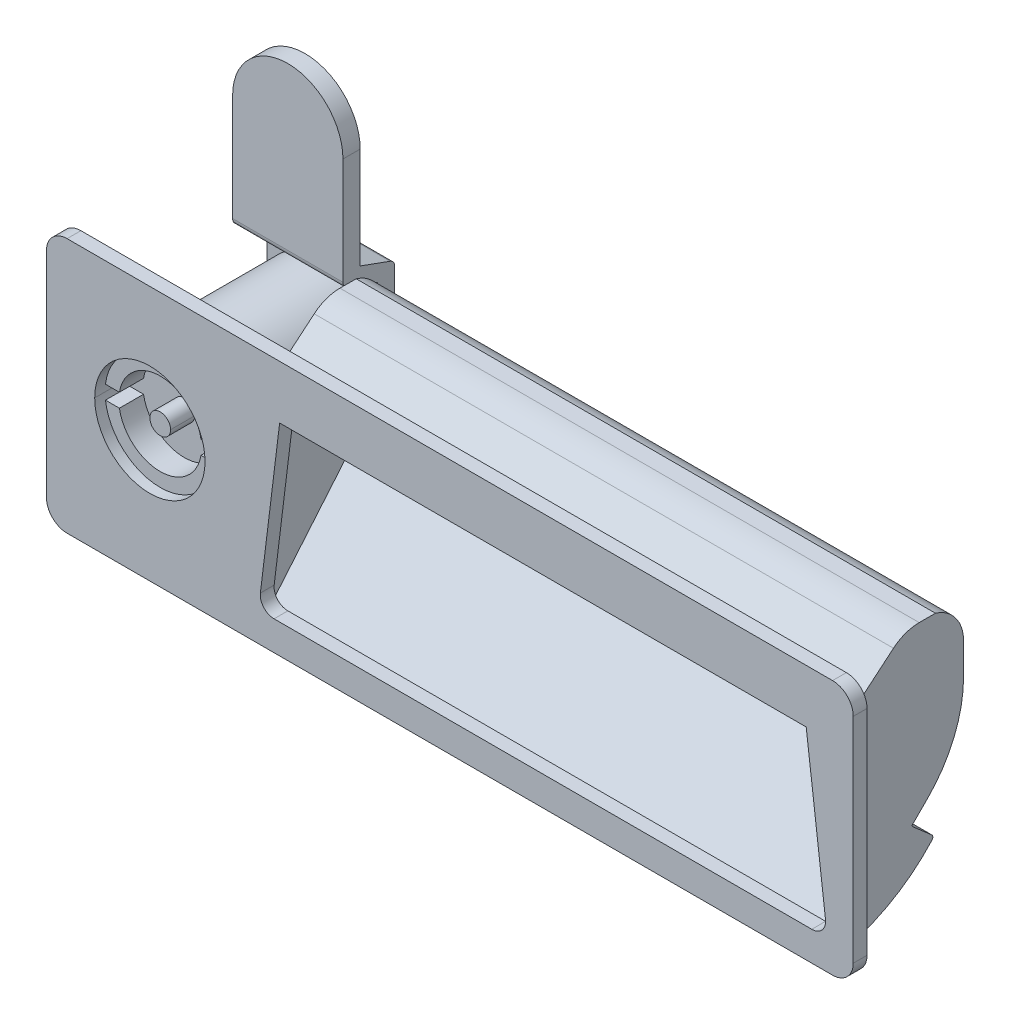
ISO-10303-21;
HEADER;
FILE_DESCRIPTION(('STEP AP214'),'2;1');
FILE_NAME('part.step','',(''),(''),'','','');
FILE_SCHEMA(('AUTOMOTIVE_DESIGN { 1 0 10303 214 1 1 1 1 }'));
ENDSEC;
DATA;
#1=APPLICATION_CONTEXT('core data for automotive mechanical design processes');
#2=APPLICATION_PROTOCOL_DEFINITION('international standard','automotive_design',2000,#1);
#3=PRODUCT_CONTEXT('',#1,'mechanical');
#4=PRODUCT('Part','Part','',(#3));
#5=PRODUCT_RELATED_PRODUCT_CATEGORY('part','',(#4));
#6=PRODUCT_DEFINITION_FORMATION('','',#4);
#7=PRODUCT_DEFINITION_CONTEXT('part definition',#1,'design');
#8=PRODUCT_DEFINITION('design','',#6,#7);
#9=PRODUCT_DEFINITION_SHAPE('','',#8);
#10=(LENGTH_UNIT() NAMED_UNIT(*) SI_UNIT(.MILLI.,.METRE.));
#11=(NAMED_UNIT(*) PLANE_ANGLE_UNIT() SI_UNIT($,.RADIAN.));
#12=(NAMED_UNIT(*) SI_UNIT($,.STERADIAN.) SOLID_ANGLE_UNIT());
#13=UNCERTAINTY_MEASURE_WITH_UNIT(LENGTH_MEASURE(1.E-05),#10,'distance_accuracy_value','');
#14=(GEOMETRIC_REPRESENTATION_CONTEXT(3) GLOBAL_UNCERTAINTY_ASSIGNED_CONTEXT((#13)) GLOBAL_UNIT_ASSIGNED_CONTEXT((#10,
#11,#12)) REPRESENTATION_CONTEXT('',''));
#15=CARTESIAN_POINT('',(0.,0.,0.));
#16=DIRECTION('',(0.,0.,1.));
#17=DIRECTION('',(1.,0.,0.));
#18=AXIS2_PLACEMENT_3D('',#15,#16,#17);
#19=CARTESIAN_POINT('',(3.5,-3.5,-26.));
#20=DIRECTION('',(0.,1.,0.));
#21=DIRECTION('',(0.,0.,-1.));
#22=AXIS2_PLACEMENT_3D('',#19,#20,#21);
#23=PLANE('',#22);
#24=DIRECTION('',(0.,0.,1.));
#25=VECTOR('',#24,1.);
#26=CARTESIAN_POINT('',(-3.5,-3.5,-26.));
#27=LINE('',#26,#25);
#28=CARTESIAN_POINT('',(-3.5,-3.5,-25.5));
#29=VERTEX_POINT('',#28);
#30=CARTESIAN_POINT('',(-3.5,-3.5,-23.));
#31=VERTEX_POINT('',#30);
#32=EDGE_CURVE('P0_E11',#29,#31,#27,.T.);
#33=ORIENTED_EDGE('',*,*,#32,.T.);
#34=DIRECTION('',(1.,0.,0.));
#35=VECTOR('',#34,1.);
#36=CARTESIAN_POINT('',(0.,-3.5,-23.));
#37=LINE('',#36,#35);
#38=CARTESIAN_POINT('',(3.5,-3.5,-23.));
#39=VERTEX_POINT('',#38);
#40=EDGE_CURVE('P0_E25',#31,#39,#37,.T.);
#41=ORIENTED_EDGE('',*,*,#40,.T.);
#42=DIRECTION('',(0.,0.,1.));
#43=VECTOR('',#42,1.);
#44=CARTESIAN_POINT('',(3.5,-3.5,-26.));
#45=LINE('',#44,#43);
#46=CARTESIAN_POINT('',(3.5,-3.5,-25.5));
#47=VERTEX_POINT('',#46);
#48=EDGE_CURVE('P0_E293',#47,#39,#45,.T.);
#49=ORIENTED_EDGE('',*,*,#48,.F.);
#50=DIRECTION('',(1.,0.,0.));
#51=VECTOR('',#50,1.);
#52=CARTESIAN_POINT('',(0.,-3.5,-25.5));
#53=LINE('',#52,#51);
#54=EDGE_CURVE('P0_E288',#29,#47,#53,.T.);
#55=ORIENTED_EDGE('',*,*,#54,.F.);
#56=EDGE_LOOP('',(#33,#41,#49,#55));
#57=FACE_BOUND('',#56,.T.);
#58=ADVANCED_FACE('P0_F17',(#57),#23,.T.);
#59=CARTESIAN_POINT('',(0.,0.,-25.5));
#60=DIRECTION('',(0.,0.,-1.));
#61=DIRECTION('',(-1.,0.,0.));
#62=AXIS2_PLACEMENT_3D('',#59,#60,#61);
#63=PLANE('',#62);
#64=DIRECTION('',(0.,1.,0.));
#65=VECTOR('',#64,1.);
#66=CARTESIAN_POINT('',(-8.,-6.,-25.5));
#67=LINE('',#66,#65);
#68=CARTESIAN_POINT('',(-8.,-6.,-25.5));
#69=VERTEX_POINT('',#68);
#70=CARTESIAN_POINT('',(-8.,10.8002295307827,-25.5));
#71=VERTEX_POINT('',#70);
#72=EDGE_CURVE('P0_E284',#69,#71,#67,.T.);
#73=ORIENTED_EDGE('',*,*,#72,.T.);
#74=DIRECTION('',(-1.,0.,0.));
#75=VECTOR('',#74,1.);
#76=CARTESIAN_POINT('',(8.,10.8002295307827,-25.5));
#77=LINE('',#76,#75);
#78=CARTESIAN_POINT('',(8.,10.8002295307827,-25.5));
#79=VERTEX_POINT('',#78);
#80=EDGE_CURVE('P0_E279',#79,#71,#77,.T.);
#81=ORIENTED_EDGE('',*,*,#80,.F.);
#82=DIRECTION('',(0.,-1.,0.));
#83=VECTOR('',#82,1.);
#84=CARTESIAN_POINT('',(8.,10.,-25.5));
#85=LINE('',#84,#83);
#86=CARTESIAN_POINT('',(8.,-6.,-25.5));
#87=VERTEX_POINT('',#86);
#88=EDGE_CURVE('P0_E275',#79,#87,#85,.T.);
#89=ORIENTED_EDGE('',*,*,#88,.T.);
#90=CARTESIAN_POINT('',(0.,0.,-25.5));
#91=DIRECTION('',(0.,0.,-1.));
#92=DIRECTION('',(0.,1.,0.));
#93=AXIS2_PLACEMENT_3D('',#90,#91,#92);
#94=CIRCLE('',#93,10.);
#95=EDGE_CURVE('P0_E271',#87,#69,#94,.T.);
#96=ORIENTED_EDGE('',*,*,#95,.T.);
#97=EDGE_LOOP('',(#73,#81,#89,#96));
#98=FACE_BOUND('',#97,.T.);
#99=DIRECTION('',(0.,1.,0.));
#100=VECTOR('',#99,1.);
#101=CARTESIAN_POINT('',(3.5,0.,-25.5));
#102=LINE('',#101,#100);
#103=CARTESIAN_POINT('',(3.5,3.5,-25.5));
#104=VERTEX_POINT('',#103);
#105=EDGE_CURVE('P0_E267',#47,#104,#102,.T.);
#106=ORIENTED_EDGE('',*,*,#105,.T.);
#107=DIRECTION('',(-1.,0.,0.));
#108=VECTOR('',#107,1.);
#109=CARTESIAN_POINT('',(0.,3.5,-25.5));
#110=LINE('',#109,#108);
#111=CARTESIAN_POINT('',(-3.5,3.5,-25.5));
#112=VERTEX_POINT('',#111);
#113=EDGE_CURVE('P0_E263',#104,#112,#110,.T.);
#114=ORIENTED_EDGE('',*,*,#113,.T.);
#115=DIRECTION('',(0.,-1.,0.));
#116=VECTOR('',#115,1.);
#117=CARTESIAN_POINT('',(-3.5,0.,-25.5));
#118=LINE('',#117,#116);
#119=EDGE_CURVE('P0_E258',#112,#29,#118,.T.);
#120=ORIENTED_EDGE('',*,*,#119,.T.);
#121=ORIENTED_EDGE('',*,*,#54,.T.);
#122=EDGE_LOOP('',(#106,#114,#120,#121));
#123=FACE_BOUND('',#122,.T.);
#124=ADVANCED_FACE('P0_F307',(#98,#123),#63,.T.);
#125=CARTESIAN_POINT('',(-3.5,-3.5,-26.));
#126=DIRECTION('',(1.,0.,0.));
#127=DIRECTION('',(0.,0.,-1.));
#128=AXIS2_PLACEMENT_3D('',#125,#126,#127);
#129=PLANE('',#128);
#130=DIRECTION('',(0.,0.,1.));
#131=VECTOR('',#130,1.);
#132=CARTESIAN_POINT('',(-3.5,3.5,-26.));
#133=LINE('',#132,#131);
#134=CARTESIAN_POINT('',(-3.5,3.5,-23.));
#135=VERTEX_POINT('',#134);
#136=EDGE_CURVE('P0_E254',#112,#135,#133,.T.);
#137=ORIENTED_EDGE('',*,*,#136,.T.);
#138=DIRECTION('',(0.,-1.,0.));
#139=VECTOR('',#138,1.);
#140=CARTESIAN_POINT('',(-3.5,0.,-23.));
#141=LINE('',#140,#139);
#142=EDGE_CURVE('P0_E250',#135,#31,#141,.T.);
#143=ORIENTED_EDGE('',*,*,#142,.T.);
#144=ORIENTED_EDGE('',*,*,#32,.F.);
#145=ORIENTED_EDGE('',*,*,#119,.F.);
#146=EDGE_LOOP('',(#137,#143,#144,#145));
#147=FACE_BOUND('',#146,.T.);
#148=ADVANCED_FACE('P0_F312',(#147),#129,.T.);
#149=CARTESIAN_POINT('',(0.,0.,-23.));
#150=DIRECTION('',(0.,0.,-1.));
#151=DIRECTION('',(-1.,0.,0.));
#152=AXIS2_PLACEMENT_3D('',#149,#150,#151);
#153=PLANE('',#152);
#154=DIRECTION('',(0.,-1.,0.));
#155=VECTOR('',#154,1.);
#156=CARTESIAN_POINT('',(8.,10.,-23.));
#157=LINE('',#156,#155);
#158=CARTESIAN_POINT('',(8.,9.99999999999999,-23.));
#159=VERTEX_POINT('',#158);
#160=CARTESIAN_POINT('',(8.,-6.,-23.));
#161=VERTEX_POINT('',#160);
#162=EDGE_CURVE('P0_E245',#159,#161,#157,.T.);
#163=ORIENTED_EDGE('',*,*,#162,.F.);
#164=DIRECTION('',(1.,0.,0.));
#165=VECTOR('',#164,1.);
#166=CARTESIAN_POINT('',(-8.,10.,-23.));
#167=LINE('',#166,#165);
#168=CARTESIAN_POINT('',(-8.,10.,-23.));
#169=VERTEX_POINT('',#168);
#170=EDGE_CURVE('P0_E240',#169,#159,#167,.T.);
#171=ORIENTED_EDGE('',*,*,#170,.F.);
#172=DIRECTION('',(0.,1.,0.));
#173=VECTOR('',#172,1.);
#174=CARTESIAN_POINT('',(-8.,-6.,-23.));
#175=LINE('',#174,#173);
#176=CARTESIAN_POINT('',(-8.,-6.,-23.));
#177=VERTEX_POINT('',#176);
#178=EDGE_CURVE('P0_E236',#177,#169,#175,.T.);
#179=ORIENTED_EDGE('',*,*,#178,.F.);
#180=CARTESIAN_POINT('',(0.,0.,-23.));
#181=DIRECTION('',(0.,0.,-1.));
#182=DIRECTION('',(0.,1.,0.));
#183=AXIS2_PLACEMENT_3D('',#180,#181,#182);
#184=CIRCLE('',#183,10.);
#185=EDGE_CURVE('P0_E231',#161,#177,#184,.T.);
#186=ORIENTED_EDGE('',*,*,#185,.F.);
#187=EDGE_LOOP('',(#163,#171,#179,#186));
#188=FACE_BOUND('',#187,.T.);
#189=DIRECTION('',(-1.,0.,0.));
#190=VECTOR('',#189,1.);
#191=CARTESIAN_POINT('',(0.,3.5,-23.));
#192=LINE('',#191,#190);
#193=CARTESIAN_POINT('',(3.5,3.5,-23.));
#194=VERTEX_POINT('',#193);
#195=EDGE_CURVE('P0_E226',#194,#135,#192,.T.);
#196=ORIENTED_EDGE('',*,*,#195,.F.);
#197=DIRECTION('',(0.,1.,0.));
#198=VECTOR('',#197,1.);
#199=CARTESIAN_POINT('',(3.5,0.,-23.));
#200=LINE('',#199,#198);
#201=EDGE_CURVE('P0_E221',#39,#194,#200,.T.);
#202=ORIENTED_EDGE('',*,*,#201,.F.);
#203=ORIENTED_EDGE('',*,*,#40,.F.);
#204=ORIENTED_EDGE('',*,*,#142,.F.);
#205=EDGE_LOOP('',(#196,#202,#203,#204));
#206=FACE_BOUND('',#205,.T.);
#207=ADVANCED_FACE('P0_F315',(#188,#206),#153,.F.);
#208=CARTESIAN_POINT('',(3.5,3.5,-26.));
#209=DIRECTION('',(-1.,0.,0.));
#210=DIRECTION('',(0.,0.,1.));
#211=AXIS2_PLACEMENT_3D('',#208,#209,#210);
#212=PLANE('',#211);
#213=ORIENTED_EDGE('',*,*,#48,.T.);
#214=ORIENTED_EDGE('',*,*,#201,.T.);
#215=DIRECTION('',(0.,0.,1.));
#216=VECTOR('',#215,1.);
#217=CARTESIAN_POINT('',(3.5,3.5,-26.));
#218=LINE('',#217,#216);
#219=EDGE_CURVE('P0_E216',#104,#194,#218,.T.);
#220=ORIENTED_EDGE('',*,*,#219,.F.);
#221=ORIENTED_EDGE('',*,*,#105,.F.);
#222=EDGE_LOOP('',(#213,#214,#220,#221));
#223=FACE_BOUND('',#222,.T.);
#224=ADVANCED_FACE('P0_F304',(#223),#212,.T.);
#225=CARTESIAN_POINT('',(-3.5,3.5,-26.));
#226=DIRECTION('',(0.,-1.,0.));
#227=DIRECTION('',(0.,0.,1.));
#228=AXIS2_PLACEMENT_3D('',#225,#226,#227);
#229=PLANE('',#228);
#230=ORIENTED_EDGE('',*,*,#219,.T.);
#231=ORIENTED_EDGE('',*,*,#195,.T.);
#232=ORIENTED_EDGE('',*,*,#136,.F.);
#233=ORIENTED_EDGE('',*,*,#113,.F.);
#234=EDGE_LOOP('',(#230,#231,#232,#233));
#235=FACE_BOUND('',#234,.T.);
#236=ADVANCED_FACE('P0_F317',(#235),#229,.T.);
#237=CARTESIAN_POINT('',(0.,0.,-25.5));
#238=DIRECTION('',(0.,0.,-1.));
#239=DIRECTION('',(0.,1.,0.));
#240=AXIS2_PLACEMENT_3D('',#237,#238,#239);
#241=CYLINDRICAL_SURFACE('',#240,10.);
#242=ORIENTED_EDGE('',*,*,#185,.T.);
#243=DIRECTION('',(0.,0.,1.));
#244=VECTOR('',#243,1.);
#245=CARTESIAN_POINT('',(-8.,-6.,-25.5));
#246=LINE('',#245,#244);
#247=EDGE_CURVE('P0_E211',#69,#177,#246,.T.);
#248=ORIENTED_EDGE('',*,*,#247,.F.);
#249=ORIENTED_EDGE('',*,*,#95,.F.);
#250=DIRECTION('',(0.,0.,1.));
#251=VECTOR('',#250,1.);
#252=CARTESIAN_POINT('',(8.,-6.,-25.5));
#253=LINE('',#252,#251);
#254=EDGE_CURVE('P0_E206',#87,#161,#253,.T.);
#255=ORIENTED_EDGE('',*,*,#254,.T.);
#256=EDGE_LOOP('',(#242,#248,#249,#255));
#257=FACE_BOUND('',#256,.T.);
#258=ADVANCED_FACE('P0_F319',(#257),#241,.T.);
#259=CARTESIAN_POINT('',(8.,10.,-25.5));
#260=DIRECTION('',(-1.,0.,0.));
#261=DIRECTION('',(0.,0.,1.));
#262=AXIS2_PLACEMENT_3D('',#259,#260,#261);
#263=PLANE('',#262);
#264=DIRECTION('',(0.,0.,-1.));
#265=VECTOR('',#264,1.);
#266=CARTESIAN_POINT('',(8.,28.,-18.));
#267=LINE('',#266,#265);
#268=CARTESIAN_POINT('',(8.,28.,-18.));
#269=VERTEX_POINT('',#268);
#270=CARTESIAN_POINT('',(8.,28.,-20.5));
#271=VERTEX_POINT('',#270);
#272=EDGE_CURVE('P0_E201',#269,#271,#267,.T.);
#273=ORIENTED_EDGE('',*,*,#272,.F.);
#274=DIRECTION('',(0.,1.,0.));
#275=VECTOR('',#274,1.);
#276=CARTESIAN_POINT('',(8.,12.5200587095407,-18.));
#277=LINE('',#276,#275);
#278=CARTESIAN_POINT('',(8.,12.5200587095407,-18.));
#279=VERTEX_POINT('',#278);
#280=EDGE_CURVE('P0_E197',#279,#269,#277,.T.);
#281=ORIENTED_EDGE('',*,*,#280,.F.);
#282=CARTESIAN_POINT('',(8.,12.5200587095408,-19.0000000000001));
#283=DIRECTION('',(-1.,0.,0.));
#284=DIRECTION('',(0.,-1.,0.));
#285=AXIS2_PLACEMENT_3D('',#282,#283,#284);
#286=CIRCLE('',#285,1.);
#287=CARTESIAN_POINT('',(8.,11.5803660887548,-18.6579798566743));
#288=VERTEX_POINT('',#287);
#289=EDGE_CURVE('P0_E132',#288,#279,#286,.T.);
#290=ORIENTED_EDGE('',*,*,#289,.F.);
#291=DIRECTION('',(0.,0.342020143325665,0.93969262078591));
#292=VECTOR('',#291,1.);
#293=CARTESIAN_POINT('',(8.,9.0900744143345,-25.5));
#294=LINE('',#293,#292);
#295=EDGE_CURVE('P0_E189',#159,#288,#294,.T.);
#296=ORIENTED_EDGE('',*,*,#295,.F.);
#297=ORIENTED_EDGE('',*,*,#162,.T.);
#298=ORIENTED_EDGE('',*,*,#254,.F.);
#299=ORIENTED_EDGE('',*,*,#88,.F.);
#300=CARTESIAN_POINT('',(8.,10.8002295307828,-24.5000000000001));
#301=DIRECTION('',(-1.,0.,0.));
#302=DIRECTION('',(0.,-1.,0.));
#303=AXIS2_PLACEMENT_3D('',#300,#301,#302);
#304=CIRCLE('',#303,1.);
#305=CARTESIAN_POINT('',(8.,11.7399221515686,-24.8420201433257));
#306=VERTEX_POINT('',#305);
#307=EDGE_CURVE('P0_E184',#306,#79,#304,.T.);
#308=ORIENTED_EDGE('',*,*,#307,.F.);
#309=DIRECTION('',(0.,-0.342020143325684,-0.939692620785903));
#310=VECTOR('',#309,1.);
#311=CARTESIAN_POINT('',(8.,13.3202882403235,-20.5));
#312=LINE('',#311,#310);
#313=CARTESIAN_POINT('',(8.,13.3202882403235,-20.5));
#314=VERTEX_POINT('',#313);
#315=EDGE_CURVE('P0_E179',#314,#306,#312,.T.);
#316=ORIENTED_EDGE('',*,*,#315,.F.);
#317=DIRECTION('',(0.,-1.,0.));
#318=VECTOR('',#317,1.);
#319=CARTESIAN_POINT('',(8.,36.,-20.5));
#320=LINE('',#319,#318);
#321=EDGE_CURVE('P0_E174',#271,#314,#320,.T.);
#322=ORIENTED_EDGE('',*,*,#321,.F.);
#323=EDGE_LOOP('',(#273,#281,#290,#296,#297,#298,#299,#308,#316,#322));
#324=FACE_BOUND('',#323,.T.);
#325=ADVANCED_FACE('P0_F327',(#324),#263,.F.);
#326=CARTESIAN_POINT('',(8.,36.,-20.5));
#327=DIRECTION('',(0.,0.,-1.));
#328=DIRECTION('',(-1.,0.,0.));
#329=AXIS2_PLACEMENT_3D('',#326,#327,#328);
#330=PLANE('',#329);
#331=DIRECTION('',(0.,-1.,0.));
#332=VECTOR('',#331,1.);
#333=CARTESIAN_POINT('',(-8.,36.,-20.5));
#334=LINE('',#333,#332);
#335=CARTESIAN_POINT('',(-8.,28.,-20.5));
#336=VERTEX_POINT('',#335);
#337=CARTESIAN_POINT('',(-8.,13.3202882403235,-20.5));
#338=VERTEX_POINT('',#337);
#339=EDGE_CURVE('P0_E169',#336,#338,#334,.T.);
#340=ORIENTED_EDGE('',*,*,#339,.F.);
#341=CARTESIAN_POINT('',(0.,28.,-20.5));
#342=DIRECTION('',(0.,0.,-1.));
#343=DIRECTION('',(-1.,0.,0.));
#344=AXIS2_PLACEMENT_3D('',#341,#342,#343);
#345=CIRCLE('',#344,8.);
#346=EDGE_CURVE('P0_E164',#336,#271,#345,.T.);
#347=ORIENTED_EDGE('',*,*,#346,.T.);
#348=ORIENTED_EDGE('',*,*,#321,.T.);
#349=DIRECTION('',(-1.,0.,0.));
#350=VECTOR('',#349,1.);
#351=CARTESIAN_POINT('',(8.,13.3202882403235,-20.5));
#352=LINE('',#351,#350);
#353=EDGE_CURVE('P0_E160',#314,#338,#352,.T.);
#354=ORIENTED_EDGE('',*,*,#353,.T.);
#355=EDGE_LOOP('',(#340,#347,#348,#354));
#356=FACE_BOUND('',#355,.T.);
#357=ADVANCED_FACE('P0_F372',(#356),#330,.T.);
#358=CARTESIAN_POINT('',(8.,13.3202882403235,-20.5));
#359=DIRECTION('',(0.,0.939692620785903,-0.342020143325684));
#360=DIRECTION('',(0.,-0.342020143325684,-0.939692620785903));
#361=AXIS2_PLACEMENT_3D('',#358,#359,#360);
#362=PLANE('',#361);
#363=DIRECTION('',(0.,-0.342020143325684,-0.939692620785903));
#364=VECTOR('',#363,1.);
#365=CARTESIAN_POINT('',(-8.,13.3202882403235,-20.5));
#366=LINE('',#365,#364);
#367=CARTESIAN_POINT('',(-8.,11.7399221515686,-24.8420201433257));
#368=VERTEX_POINT('',#367);
#369=EDGE_CURVE('P0_E155',#338,#368,#366,.T.);
#370=ORIENTED_EDGE('',*,*,#369,.F.);
#371=ORIENTED_EDGE('',*,*,#353,.F.);
#372=ORIENTED_EDGE('',*,*,#315,.T.);
#373=DIRECTION('',(-1.,0.,0.));
#374=VECTOR('',#373,1.);
#375=CARTESIAN_POINT('',(8.,11.7399221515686,-24.8420201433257));
#376=LINE('',#375,#374);
#377=EDGE_CURVE('P0_E144',#306,#368,#376,.T.);
#378=ORIENTED_EDGE('',*,*,#377,.T.);
#379=EDGE_LOOP('',(#370,#371,#372,#378));
#380=FACE_BOUND('',#379,.T.);
#381=ADVANCED_FACE('P0_F375',(#380),#362,.T.);
#382=CARTESIAN_POINT('',(8.,10.8002295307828,-24.5000000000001));
#383=DIRECTION('',(1.,0.,0.));
#384=DIRECTION('',(0.,-0.573576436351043,0.819152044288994));
#385=AXIS2_PLACEMENT_3D('',#382,#383,#384);
#386=CYLINDRICAL_SURFACE('',#385,1.);
#387=CARTESIAN_POINT('',(-8.,10.8002295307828,-24.5000000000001));
#388=DIRECTION('',(-1.,0.,0.));
#389=DIRECTION('',(0.,-1.,0.));
#390=AXIS2_PLACEMENT_3D('',#387,#388,#389);
#391=CIRCLE('',#390,1.);
#392=EDGE_CURVE('P0_E140',#368,#71,#391,.T.);
#393=ORIENTED_EDGE('',*,*,#392,.F.);
#394=ORIENTED_EDGE('',*,*,#377,.F.);
#395=ORIENTED_EDGE('',*,*,#307,.T.);
#396=ORIENTED_EDGE('',*,*,#80,.T.);
#397=EDGE_LOOP('',(#393,#394,#395,#396));
#398=FACE_BOUND('',#397,.T.);
#399=ADVANCED_FACE('P0_F379',(#398),#386,.T.);
#400=CARTESIAN_POINT('',(-8.,-6.,-25.5));
#401=DIRECTION('',(1.,0.,0.));
#402=DIRECTION('',(0.,0.,-1.));
#403=AXIS2_PLACEMENT_3D('',#400,#401,#402);
#404=PLANE('',#403);
#405=DIRECTION('',(0.,1.,0.));
#406=VECTOR('',#405,1.);
#407=CARTESIAN_POINT('',(-8.,12.5200587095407,-18.));
#408=LINE('',#407,#406);
#409=CARTESIAN_POINT('',(-8.,12.5200587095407,-18.));
#410=VERTEX_POINT('',#409);
#411=CARTESIAN_POINT('',(-8.,28.,-18.));
#412=VERTEX_POINT('',#411);
#413=EDGE_CURVE('P0_E118',#410,#412,#408,.T.);
#414=ORIENTED_EDGE('',*,*,#413,.T.);
#415=DIRECTION('',(0.,0.,-1.));
#416=VECTOR('',#415,1.);
#417=CARTESIAN_POINT('',(-8.,28.,-18.));
#418=LINE('',#417,#416);
#419=EDGE_CURVE('P0_E141',#412,#336,#418,.T.);
#420=ORIENTED_EDGE('',*,*,#419,.T.);
#421=ORIENTED_EDGE('',*,*,#339,.T.);
#422=ORIENTED_EDGE('',*,*,#369,.T.);
#423=ORIENTED_EDGE('',*,*,#392,.T.);
#424=ORIENTED_EDGE('',*,*,#72,.F.);
#425=ORIENTED_EDGE('',*,*,#247,.T.);
#426=ORIENTED_EDGE('',*,*,#178,.T.);
#427=DIRECTION('',(0.,0.342020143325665,0.93969262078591));
#428=VECTOR('',#427,1.);
#429=CARTESIAN_POINT('',(-8.,9.0900744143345,-25.5));
#430=LINE('',#429,#428);
#431=CARTESIAN_POINT('',(-8.,11.5803660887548,-18.6579798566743));
#432=VERTEX_POINT('',#431);
#433=EDGE_CURVE('P0_E122',#169,#432,#430,.T.);
#434=ORIENTED_EDGE('',*,*,#433,.T.);
#435=CARTESIAN_POINT('',(-8.,12.5200587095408,-19.0000000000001));
#436=DIRECTION('',(-1.,0.,0.));
#437=DIRECTION('',(0.,-1.,0.));
#438=AXIS2_PLACEMENT_3D('',#435,#436,#437);
#439=CIRCLE('',#438,1.);
#440=EDGE_CURVE('P0_E113',#432,#410,#439,.T.);
#441=ORIENTED_EDGE('',*,*,#440,.T.);
#442=EDGE_LOOP('',(#414,#420,#421,#422,#423,#424,#425,#426,#434,#441));
#443=FACE_BOUND('',#442,.T.);
#444=ADVANCED_FACE('P0_F115',(#443),#404,.F.);
#445=CARTESIAN_POINT('',(8.,12.5200587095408,-19.0000000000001));
#446=DIRECTION('',(1.,0.,0.));
#447=DIRECTION('',(0.,0.573576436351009,-0.819152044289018));
#448=AXIS2_PLACEMENT_3D('',#445,#446,#447);
#449=CYLINDRICAL_SURFACE('',#448,1.);
#450=ORIENTED_EDGE('',*,*,#440,.F.);
#451=DIRECTION('',(-1.,0.,0.));
#452=VECTOR('',#451,1.);
#453=CARTESIAN_POINT('',(8.,11.5803660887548,-18.6579798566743));
#454=LINE('',#453,#452);
#455=EDGE_CURVE('P0_E126',#288,#432,#454,.T.);
#456=ORIENTED_EDGE('',*,*,#455,.F.);
#457=ORIENTED_EDGE('',*,*,#289,.T.);
#458=DIRECTION('',(-1.,0.,0.));
#459=VECTOR('',#458,1.);
#460=CARTESIAN_POINT('',(8.,12.5200587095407,-18.));
#461=LINE('',#460,#459);
#462=EDGE_CURVE('P0_E130',#279,#410,#461,.T.);
#463=ORIENTED_EDGE('',*,*,#462,.T.);
#464=EDGE_LOOP('',(#450,#456,#457,#463));
#465=FACE_BOUND('',#464,.T.);
#466=ADVANCED_FACE('P0_F131',(#465),#449,.T.);
#467=CARTESIAN_POINT('',(8.,12.5200587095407,-18.));
#468=DIRECTION('',(0.,0.,1.));
#469=DIRECTION('',(1.,0.,0.));
#470=AXIS2_PLACEMENT_3D('',#467,#468,#469);
#471=PLANE('',#470);
#472=ORIENTED_EDGE('',*,*,#280,.T.);
#473=CARTESIAN_POINT('',(0.,28.,-18.));
#474=DIRECTION('',(0.,0.,-1.));
#475=DIRECTION('',(0.,-1.,0.));
#476=AXIS2_PLACEMENT_3D('',#473,#474,#475);
#477=CIRCLE('',#476,8.);
#478=EDGE_CURVE('P0_E135',#412,#269,#477,.T.);
#479=ORIENTED_EDGE('',*,*,#478,.F.);
#480=ORIENTED_EDGE('',*,*,#413,.F.);
#481=ORIENTED_EDGE('',*,*,#462,.F.);
#482=EDGE_LOOP('',(#472,#479,#480,#481));
#483=FACE_BOUND('',#482,.T.);
#484=ADVANCED_FACE('P0_F137',(#483),#471,.T.);
#485=CARTESIAN_POINT('',(0.,28.,-18.));
#486=DIRECTION('',(0.,0.,1.));
#487=DIRECTION('',(0.,-1.,0.));
#488=AXIS2_PLACEMENT_3D('',#485,#486,#487);
#489=CYLINDRICAL_SURFACE('',#488,8.);
#490=ORIENTED_EDGE('',*,*,#419,.F.);
#491=ORIENTED_EDGE('',*,*,#478,.T.);
#492=ORIENTED_EDGE('',*,*,#272,.T.);
#493=ORIENTED_EDGE('',*,*,#346,.F.);
#494=EDGE_LOOP('',(#490,#491,#492,#493));
#495=FACE_BOUND('',#494,.T.);
#496=ADVANCED_FACE('P0_F368',(#495),#489,.T.);
#497=CARTESIAN_POINT('',(8.,9.0900744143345,-25.5));
#498=DIRECTION('',(0.,-0.93969262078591,0.342020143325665));
#499=DIRECTION('',(0.,0.342020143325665,0.93969262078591));
#500=AXIS2_PLACEMENT_3D('',#497,#498,#499);
#501=PLANE('',#500);
#502=ORIENTED_EDGE('',*,*,#170,.T.);
#503=ORIENTED_EDGE('',*,*,#295,.T.);
#504=ORIENTED_EDGE('',*,*,#455,.T.);
#505=ORIENTED_EDGE('',*,*,#433,.F.);
#506=EDGE_LOOP('',(#502,#503,#504,#505));
#507=FACE_BOUND('',#506,.T.);
#508=ADVANCED_FACE('P0_F353',(#507),#501,.T.);
#509=CLOSED_SHELL('',(#58,#124,#148,#207,#224,#236,#258,#325,#357,#381,#399,#444,#466,#484,#496,#508));
#510=MANIFOLD_SOLID_BREP('P0_B1',#509);
#511=CARTESIAN_POINT('',(-0.5,-0.5,-25.));
#512=DIRECTION('',(1.,0.,0.));
#513=DIRECTION('',(0.,0.,-1.));
#514=AXIS2_PLACEMENT_3D('',#511,#512,#513);
#515=PLANE('',#514);
#516=DIRECTION('',(0.,0.,-1.));
#517=VECTOR('',#516,1.);
#518=CARTESIAN_POINT('',(-0.5,-0.5,-25.));
#519=LINE('',#518,#517);
#520=CARTESIAN_POINT('',(-0.5,-0.5,-25.));
#521=VERTEX_POINT('',#520);
#522=CARTESIAN_POINT('',(-0.5,-0.5,-29.8751936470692));
#523=VERTEX_POINT('',#522);
#524=EDGE_CURVE('P1_E11',#521,#523,#519,.T.);
#525=ORIENTED_EDGE('',*,*,#524,.F.);
#526=DIRECTION('',(0.,-1.,0.));
#527=VECTOR('',#526,1.);
#528=CARTESIAN_POINT('',(-0.5,-0.5,-25.));
#529=LINE('',#528,#527);
#530=CARTESIAN_POINT('',(-0.5,-2.5,-25.));
#531=VERTEX_POINT('',#530);
#532=EDGE_CURVE('P1_E25',#521,#531,#529,.T.);
#533=ORIENTED_EDGE('',*,*,#532,.T.);
#534=DIRECTION('',(0.,0.,-1.));
#535=VECTOR('',#534,1.);
#536=CARTESIAN_POINT('',(-0.5,-2.5,-25.));
#537=LINE('',#536,#535);
#538=CARTESIAN_POINT('',(-0.5,-2.5,-29.4434983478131));
#539=VERTEX_POINT('',#538);
#540=EDGE_CURVE('P1_E1487',#531,#539,#537,.T.);
#541=ORIENTED_EDGE('',*,*,#540,.T.);
#542=CARTESIAN_POINT('',(-0.5,-3.36536354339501E-13,-22.7099999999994));
#543=DIRECTION('',(1.,0.,0.));
#544=DIRECTION('',(0.,0.,-1.));
#545=AXIS2_PLACEMENT_3D('',#542,#543,#544);
#546=CIRCLE('',#545,7.1826179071);
#547=EDGE_CURVE('P1_E1485',#539,#523,#546,.T.);
#548=ORIENTED_EDGE('',*,*,#547,.T.);
#549=EDGE_LOOP('',(#525,#533,#541,#548));
#550=FACE_BOUND('',#549,.T.);
#551=ADVANCED_FACE('P1_F17',(#550),#515,.T.);
#552=CARTESIAN_POINT('',(0.,-3.36536354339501E-13,-22.7099999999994));
#553=DIRECTION('',(1.,0.,0.));
#554=DIRECTION('',(0.,0.,1.));
#555=AXIS2_PLACEMENT_3D('',#552,#553,#554);
#556=SPHERICAL_SURFACE('',#555,7.2);
#557=CARTESIAN_POINT('',(-4.74999999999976,0.,-28.1208686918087));
#558=CARTESIAN_POINT('',(-4.75041058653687,0.0577889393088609,-28.1205087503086));
#559=CARTESIAN_POINT('',(-4.74971094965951,0.115586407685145,-28.1201965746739));
#560=CARTESIAN_POINT('',(-4.74610523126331,0.230492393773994,-28.1196788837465));
#561=CARTESIAN_POINT('',(-4.74322289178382,0.287601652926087,-28.1194722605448));
#562=CARTESIAN_POINT('',(-4.73530723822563,0.401199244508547,-28.119169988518));
#563=CARTESIAN_POINT('',(-4.73029181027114,0.457688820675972,-28.1190734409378));
#564=CARTESIAN_POINT('',(-4.71816357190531,0.570105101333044,-28.1189823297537));
#565=CARTESIAN_POINT('',(-4.71106330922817,0.626033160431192,-28.1189871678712));
#566=CARTESIAN_POINT('',(-4.69481189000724,0.7373735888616,-28.1190826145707));
#567=CARTESIAN_POINT('',(-4.685668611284,0.792787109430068,-28.1191728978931));
#568=CARTESIAN_POINT('',(-4.66537271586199,0.903133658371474,-28.119416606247));
#569=CARTESIAN_POINT('',(-4.65422401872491,0.958067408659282,-28.1195699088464));
#570=CARTESIAN_POINT('',(-4.62995421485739,1.06747691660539,-28.1199127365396));
#571=CARTESIAN_POINT('',(-4.61683379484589,1.12195282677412,-28.1201022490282));
#572=CARTESIAN_POINT('',(-4.58865360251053,1.23045588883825,-28.1204880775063));
#573=CARTESIAN_POINT('',(-4.57359198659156,1.28448256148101,-28.1206843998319));
#574=CARTESIAN_POINT('',(-4.54156103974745,1.39207825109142,-28.1210533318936));
#575=CARTESIAN_POINT('',(-4.52458815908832,1.4456462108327,-28.1212258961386));
#576=CARTESIAN_POINT('',(-4.48875965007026,1.55227963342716,-28.1215280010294));
#577=CARTESIAN_POINT('',(-4.46989996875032,1.60534373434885,-28.1216574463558));
#578=CARTESIAN_POINT('',(-4.43032218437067,1.71090613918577,-28.1218601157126));
#579=CARTESIAN_POINT('',(-4.40960012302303,1.76340295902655,-28.1219332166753));
#580=CARTESIAN_POINT('',(-4.36632117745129,1.86775463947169,-28.1220170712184));
#581=CARTESIAN_POINT('',(-4.34376079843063,1.91960805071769,-28.1220277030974));
#582=CARTESIAN_POINT('',(-4.2968286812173,2.02258439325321,-28.1219887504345));
#583=CARTESIAN_POINT('',(-4.27245422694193,2.07370608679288,-28.1219390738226));
#584=CARTESIAN_POINT('',(-4.22191796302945,2.17511886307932,-28.1217907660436));
#585=CARTESIAN_POINT('',(-4.19575448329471,2.22540911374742,-28.1216920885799));
#586=CARTESIAN_POINT('',(-4.14166526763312,2.32504798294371,-28.1214669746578));
#587=CARTESIAN_POINT('',(-4.11373913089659,2.37439638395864,-28.1213405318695));
#588=CARTESIAN_POINT('',(-4.05615150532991,2.472030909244,-28.1210912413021));
#589=CARTESIAN_POINT('',(-4.02649106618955,2.52031765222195,-28.1209683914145));
#590=CARTESIAN_POINT('',(-3.9654552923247,2.61571104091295,-28.120769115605));
#591=CARTESIAN_POINT('',(-3.93408212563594,2.6628190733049,-28.1206926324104));
#592=CARTESIAN_POINT('',(-3.86966573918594,2.75581612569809,-28.1205786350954));
#593=CARTESIAN_POINT('',(-3.83662404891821,2.80170620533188,-28.1205410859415));
#594=CARTESIAN_POINT('',(-3.76891147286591,2.89223638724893,-28.1204961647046));
#595=CARTESIAN_POINT('',(-3.73424131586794,2.93687703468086,-28.1204887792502));
#596=CARTESIAN_POINT('',(-3.66331591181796,3.02487133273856,-28.1204956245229));
#597=CARTESIAN_POINT('',(-3.62706086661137,3.06822514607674,-28.1205098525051));
#598=CARTESIAN_POINT('',(-3.55301354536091,3.15360413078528,-28.1205516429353));
#599=CARTESIAN_POINT('',(-3.51522117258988,3.19562921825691,-28.1205792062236));
#600=CARTESIAN_POINT('',(-3.43815105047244,3.27830546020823,-28.1206399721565));
#601=CARTESIAN_POINT('',(-3.39887309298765,3.31895642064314,-28.1206731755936));
#602=CARTESIAN_POINT('',(-3.31888787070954,3.39883654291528,-28.1207382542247));
#603=CARTESIAN_POINT('',(-3.27818043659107,3.43806553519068,-28.1207701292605));
#604=CARTESIAN_POINT('',(-3.1953967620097,3.51505230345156,-28.1208263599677));
#605=CARTESIAN_POINT('',(-3.15332050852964,3.55281006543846,-28.1208507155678));
#606=CARTESIAN_POINT('',(-3.06786141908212,3.62680660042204,-28.1208866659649));
#607=CARTESIAN_POINT('',(-3.0244787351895,3.66304554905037,-28.1208982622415));
#608=CARTESIAN_POINT('',(-2.93645566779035,3.73395734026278,-28.1209134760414));
#609=CARTESIAN_POINT('',(-2.89181535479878,3.76863027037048,-28.1209170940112));
#610=CARTESIAN_POINT('',(-2.8013274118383,3.83636588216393,-28.1209200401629));
#611=CARTESIAN_POINT('',(-2.75547974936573,3.86942852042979,-28.1209193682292));
#612=CARTESIAN_POINT('',(-2.66263114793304,3.9339005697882,-28.1209164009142));
#613=CARTESIAN_POINT('',(-2.61563012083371,3.96530985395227,-28.1209141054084));
#614=CARTESIAN_POINT('',(-2.52053250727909,4.02643395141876,-28.1209094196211));
#615=CARTESIAN_POINT('',(-2.47243581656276,4.05614860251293,-28.1209070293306));
#616=CARTESIAN_POINT('',(-2.37520818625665,4.11384445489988,-28.1209024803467));
#617=CARTESIAN_POINT('',(-2.3260771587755,4.14182550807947,-28.1209003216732));
#618=CARTESIAN_POINT('',(-2.22684564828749,4.1960179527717,-28.1208952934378));
#619=CARTESIAN_POINT('',(-2.17674511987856,4.22222926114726,-28.1208924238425));
#620=CARTESIAN_POINT('',(-2.07564279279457,4.27284923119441,-28.1208836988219));
#621=CARTESIAN_POINT('',(-2.0246410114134,4.29725792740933,-28.1208778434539));
#622=CARTESIAN_POINT('',(-1.9218060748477,4.34424398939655,-28.1208595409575));
#623=CARTESIAN_POINT('',(-1.86997299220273,4.36682151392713,-28.1208470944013));
#624=CARTESIAN_POINT('',(-1.76553751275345,4.41011084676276,-28.1208219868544));
#625=CARTESIAN_POINT('',(-1.71293516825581,4.43082278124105,-28.1208093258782));
#626=CARTESIAN_POINT('',(-1.60702462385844,4.47035093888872,-28.1207882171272));
#627=CARTESIAN_POINT('',(-1.55371644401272,4.48916721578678,-28.1207797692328));
#628=CARTESIAN_POINT('',(-1.44645998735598,4.52487805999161,-28.120769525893));
#629=CARTESIAN_POINT('',(-1.39251170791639,4.5417726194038,-28.1207677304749));
#630=CARTESIAN_POINT('',(-1.28404295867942,4.57361824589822,-28.1207711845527));
#631=CARTESIAN_POINT('',(-1.22952247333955,4.58856926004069,-28.1207764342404));
#632=CARTESIAN_POINT('',(-1.11997915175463,4.61651043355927,-28.1207923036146));
#633=CARTESIAN_POINT('',(-1.0649562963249,4.62950051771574,-28.1208029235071));
#634=CARTESIAN_POINT('',(-0.954479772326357,4.65350706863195,-28.1208257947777));
#635=CARTESIAN_POINT('',(-0.899026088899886,4.66452346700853,-28.1208380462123));
#636=CARTESIAN_POINT('',(-0.787760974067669,4.68457463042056,-28.1208584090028));
#637=CARTESIAN_POINT('',(-0.731949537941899,4.69360936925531,-28.120866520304));
#638=CARTESIAN_POINT('',(-0.620042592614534,4.70969416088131,-28.1208708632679));
#639=CARTESIAN_POINT('',(-0.563947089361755,4.71674425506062,-28.1208670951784));
#640=CARTESIAN_POINT('',(-0.451542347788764,4.72884257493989,-28.120855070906));
#641=CARTESIAN_POINT('',(-0.395233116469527,4.73389086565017,-28.1208468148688));
#642=CARTESIAN_POINT('',(-0.282471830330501,4.7419732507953,-28.1208312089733));
#643=CARTESIAN_POINT('',(-0.226019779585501,4.7450074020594,-28.1208238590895));
#644=CARTESIAN_POINT('',(-0.113044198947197,4.74905405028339,-28.1208133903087));
#645=CARTESIAN_POINT('',(-0.0565206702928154,4.750066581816,-28.1208102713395));
#646=CARTESIAN_POINT('',(0.0565262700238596,4.75006741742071,-28.1208094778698));
#647=CARTESIAN_POINT('',(0.113049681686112,4.74905572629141,-28.1208118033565));
#648=CARTESIAN_POINT('',(0.22602479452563,4.74501043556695,-28.1208209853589));
#649=CARTESIAN_POINT('',(0.282476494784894,4.74197681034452,-28.1208278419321));
#650=CARTESIAN_POINT('',(0.395236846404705,4.73389484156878,-28.120843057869));
#651=CARTESIAN_POINT('',(0.451545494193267,4.72884644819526,-28.1208514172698));
#652=CARTESIAN_POINT('',(0.563948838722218,4.71674697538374,-28.120864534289));
#653=CARTESIAN_POINT('',(0.620043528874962,4.70969583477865,-28.1208692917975));
#654=CARTESIAN_POINT('',(0.731948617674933,4.69360769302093,-28.1208680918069));
#655=CARTESIAN_POINT('',(0.787759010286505,4.68457064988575,-28.1208621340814));
#656=CARTESIAN_POINT('',(0.899021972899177,4.66451427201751,-28.1208466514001));
#657=CARTESIAN_POINT('',(0.954474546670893,4.65349495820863,-28.1208371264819));
#658=CARTESIAN_POINT('',(1.06494896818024,4.62948260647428,-28.120819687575));
#659=CARTESIAN_POINT('',(1.1199708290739,4.61648962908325,-28.1208117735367));
#660=CARTESIAN_POINT('',(1.22951245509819,4.58854332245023,-28.1208007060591));
#661=CARTESIAN_POINT('',(1.28403223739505,4.57359006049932,-28.1207975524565));
#662=CARTESIAN_POINT('',(1.39250004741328,4.54174120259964,-28.1207971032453));
#663=CARTESIAN_POINT('',(1.44644808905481,4.52484565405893,-28.1207998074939));
#664=CARTESIAN_POINT('',(1.55370470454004,4.48913469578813,-28.1208101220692));
#665=CARTESIAN_POINT('',(1.60701328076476,4.47031929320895,-28.1208177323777));
#666=CARTESIAN_POINT('',(1.71292541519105,4.43079533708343,-28.1208348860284));
#667=CARTESIAN_POINT('',(1.76552895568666,4.41008673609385,-28.120844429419));
#668=CARTESIAN_POINT('',(1.86996777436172,4.36680710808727,-28.1208605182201));
#669=CARTESIAN_POINT('',(1.92180300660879,4.34423597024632,-28.120867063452));
#670=CARTESIAN_POINT('',(2.0246434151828,4.29726625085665,-28.1208703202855));
#671=CARTESIAN_POINT('',(2.07564852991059,4.27286753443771,-28.1208670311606));
#672=CARTESIAN_POINT('',(2.1767579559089,4.22226893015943,-28.1208562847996));
#673=CARTESIAN_POINT('',(2.22686226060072,4.19606902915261,-28.120848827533));
#674=CARTESIAN_POINT('',(2.32610106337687,4.14189868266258,-28.1208340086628));
#675=CARTESIAN_POINT('',(2.37523561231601,4.11392833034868,-28.1208266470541));
#676=CARTESIAN_POINT('',(2.47246936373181,4.0562510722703,-28.1208148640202));
#677=CARTESIAN_POINT('',(2.520568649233,4.02654430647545,-28.1208104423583));
#678=CARTESIAN_POINT('',(2.61566989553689,3.96543111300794,-28.1208060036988));
#679=CARTESIAN_POINT('',(2.66267193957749,3.93402481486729,-28.120805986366));
#680=CARTESIAN_POINT('',(2.75552041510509,3.86955183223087,-28.1208104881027));
#681=CARTESIAN_POINT('',(2.80136689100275,3.83648521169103,-28.1208150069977));
#682=CARTESIAN_POINT('',(2.89184972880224,3.76873271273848,-28.1208274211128));
#683=CARTESIAN_POINT('',(2.93648604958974,3.73404677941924,-28.1208353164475));
#684=CARTESIAN_POINT('',(3.02449787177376,3.66309802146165,-28.1208521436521));
#685=CARTESIAN_POINT('',(3.06787319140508,3.62683497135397,-28.1208610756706));
#686=CARTESIAN_POINT('',(3.15331322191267,3.55277780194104,-28.1208763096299));
#687=CARTESIAN_POINT('',(3.19537764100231,3.51498334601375,-28.1208826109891));
#688=CARTESIAN_POINT('',(3.27813627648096,3.43791815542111,-28.1208907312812));
#689=CARTESIAN_POINT('',(3.31883041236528,3.39864733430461,-28.1208925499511));
#690=CARTESIAN_POINT('',(3.39879001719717,3.31868615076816,-28.1208913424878));
#691=CARTESIAN_POINT('',(3.43805564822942,3.27799595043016,-28.120888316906));
#692=CARTESIAN_POINT('',(3.51510431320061,3.1952514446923,-28.120878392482));
#693=CARTESIAN_POINT('',(3.55288766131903,3.15319743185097,-28.1208714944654));
#694=CARTESIAN_POINT('',(3.62692222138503,3.06777842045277,-28.1208561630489));
#695=CARTESIAN_POINT('',(3.66317377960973,3.02441372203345,-28.1208477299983));
#696=CARTESIAN_POINT('',(3.73409946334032,2.93642313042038,-28.1208329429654));
#697=CARTESIAN_POINT('',(3.76877381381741,2.89179741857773,-28.1208265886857));
#698=CARTESIAN_POINT('',(3.83650386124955,2.80133028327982,-28.1208206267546));
#699=CARTESIAN_POINT('',(3.86955947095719,2.75548879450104,-28.1208210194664));
#700=CARTESIAN_POINT('',(3.93401451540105,2.66263002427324,-28.1208341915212));
#701=CARTESIAN_POINT('',(3.9654133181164,2.61561230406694,-28.1208469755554));
#702=CARTESIAN_POINT('',(4.02651503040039,2.52044464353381,-28.1208904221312));
#703=CARTESIAN_POINT('',(4.05621682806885,2.47229398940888,-28.1209210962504));
#704=CARTESIAN_POINT('',(4.11389122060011,2.37495148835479,-28.1209801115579));
#705=CARTESIAN_POINT('',(4.14186336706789,2.32575937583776,-28.121008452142));
#706=CARTESIAN_POINT('',(4.19604102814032,2.22642450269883,-28.121051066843));
#707=CARTESIAN_POINT('',(4.22224689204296,2.17628193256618,-28.1210653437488));
#708=CARTESIAN_POINT('',(4.27285710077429,2.07512699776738,-28.1210753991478));
#709=CARTESIAN_POINT('',(4.29726233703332,2.02411507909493,-28.1210711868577));
#710=CARTESIAN_POINT('',(4.34423833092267,1.92129134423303,-28.1210466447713));
#711=CARTESIAN_POINT('',(4.36681020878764,1.86948003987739,-28.1210263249));
#712=CARTESIAN_POINT('',(4.41008792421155,1.76511554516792,-28.120977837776));
#713=CARTESIAN_POINT('',(4.43079473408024,1.71256275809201,-28.1209496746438));
#714=CARTESIAN_POINT('',(4.47031163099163,1.60676063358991,-28.1208984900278));
#715=CARTESIAN_POINT('',(4.4891220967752,1.55351143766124,-28.1208754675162));
#716=CARTESIAN_POINT('',(4.52481562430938,1.44634814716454,-28.1208512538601));
#717=CARTESIAN_POINT('',(4.54169795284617,1.39243380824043,-28.1208500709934));
#718=CARTESIAN_POINT('',(4.57350030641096,1.28397429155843,-28.1208873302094));
#719=CARTESIAN_POINT('',(4.58841846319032,1.2294285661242,-28.1209258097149));
#720=CARTESIAN_POINT('',(4.61629867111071,1.11980605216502,-28.1210092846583));
#721=CARTESIAN_POINT('',(4.62925957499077,1.06472897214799,-28.1210542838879));
#722=CARTESIAN_POINT('',(4.65322230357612,0.954146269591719,-28.1211300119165));
#723=CARTESIAN_POINT('',(4.66422398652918,0.898640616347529,-28.1211607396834));
#724=CARTESIAN_POINT('',(4.6842620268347,0.78729313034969,-28.1211974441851));
#725=CARTESIAN_POINT('',(4.69329897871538,0.731451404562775,-28.1212034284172));
#726=CARTESIAN_POINT('',(4.70939736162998,0.619514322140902,-28.1211897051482));
#727=CARTESIAN_POINT('',(4.71645984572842,0.563419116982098,-28.121170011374));
#728=CARTESIAN_POINT('',(4.72859467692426,0.451048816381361,-28.1211125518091));
#729=CARTESIAN_POINT('',(4.73366825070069,0.394773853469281,-28.1210747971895));
#730=CARTESIAN_POINT('',(4.74180613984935,0.282109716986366,-28.1209958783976));
#731=CARTESIAN_POINT('',(4.7448715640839,0.225720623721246,-28.120954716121));
#732=CARTESIAN_POINT('',(4.74896779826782,0.112888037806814,-28.1208916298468));
#733=CARTESIAN_POINT('',(4.74999930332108,0.056444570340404,-28.120869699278));
#734=CARTESIAN_POINT('',(4.74999999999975,0.,-28.1208686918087));
#735=B_SPLINE_CURVE_WITH_KNOTS('',3,(#557,#558,#559,#560,#561,#562,#563,#564,#565,#566,#567,
#568,#569,#570,#571,#572,#573,#574,#575,#576,#577,#578,#579,#580,#581,#582,#583,#584,#585,#586,
#587,#588,#589,#590,#591,#592,#593,#594,#595,#596,#597,#598,#599,#600,#601,#602,#603,#604,#605,
#606,#607,#608,#609,#610,#611,#612,#613,#614,#615,#616,#617,#618,#619,#620,#621,#622,#623,#624,
#625,#626,#627,#628,#629,#630,#631,#632,#633,#634,#635,#636,#637,#638,#639,#640,#641,#642,#643,
#644,#645,#646,#647,#648,#649,#650,#651,#652,#653,#654,#655,#656,#657,#658,#659,#660,#661,#662,
#663,#664,#665,#666,#667,#668,#669,#670,#671,#672,#673,#674,#675,#676,#677,#678,#679,#680,#681,
#682,#683,#684,#685,#686,#687,#688,#689,#690,#691,#692,#693,#694,#695,#696,#697,#698,#699,#700,
#701,#702,#703,#704,#705,#706,#707,#708,#709,#710,#711,#712,#713,#714,#715,#716,#717,#718,#719,
#720,#721,#722,#723,#724,#725,#726,#727,#728,#729,#730,#731,#732,#733,#734),.UNSPECIFIED.,.F.,
.F.,(4,2,2,2,2,2,2,2,2,2,2,2,2,2,2,2,2,2,2,2,2,2,2,2,2,2,2,2,2,2,2,2,2,2,2,2,2,2,2,2,2,2,2,2,2,
2,2,2,2,2,2,2,2,2,2,2,2,2,2,2,2,2,2,2,2,2,2,2,2,2,2,2,2,2,2,2,2,2,2,2,2,2,2,2,2,2,2,2,4),(0.,
0.173364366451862,0.344869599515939,0.514964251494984,0.684055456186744,0.852505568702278,
1.02062995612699,1.18869592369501,1.35692269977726,1.52546723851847,1.69438192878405,
1.86366452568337,2.03327680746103,2.20314835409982,2.37318070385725,2.54325185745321,
2.71322111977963,2.88298000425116,3.05258600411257,3.22211681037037,3.39162608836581,
3.56114604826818,3.73068984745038,3.90025379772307,4.06981936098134,4.23936526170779,
4.40890167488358,4.57844265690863,4.74799663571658,4.91756681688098,5.0871514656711,
5.25674407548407,5.42633343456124,5.59590807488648,5.76547123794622,5.93502959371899,
6.10458864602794,6.27415231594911,6.44372248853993,6.61329853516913,6.78287682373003,
6.95245157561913,7.12202081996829,7.29158527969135,7.46114683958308,7.6307079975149,
7.80027130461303,7.96983880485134,8.13941148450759,8.30898774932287,8.47856222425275,
8.64813149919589,8.81769495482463,8.98725427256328,9.15681295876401,9.32637589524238,
9.4959489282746,9.66553448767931,9.83512128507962,10.0046991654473,10.1742633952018,
10.3438147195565,10.5133595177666,10.682910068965,10.8524849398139,11.0220972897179,
11.1917195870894,11.3613225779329,11.5308894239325,11.7004177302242,11.8699217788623,
12.0394349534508,12.2090123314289,12.3786995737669,12.5484306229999,12.7181280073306,
12.8877408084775,13.0572491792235,13.2266686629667,13.3960542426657,13.5655040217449,
13.7351138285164,13.9048226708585,14.0745437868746,14.2442134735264,14.4137924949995,
14.5832667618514,14.7526473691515,14.9219700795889),.UNSPECIFIED.);
#736=CARTESIAN_POINT('',(-4.75,0.,-28.120868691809));
#737=VERTEX_POINT('',#736);
#738=CARTESIAN_POINT('',(4.75,0.,-28.120868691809));
#739=VERTEX_POINT('',#738);
#740=EDGE_CURVE('P1_E1484',#737,#739,#735,.T.);
#741=ORIENTED_EDGE('',*,*,#740,.T.);
#742=CARTESIAN_POINT('',(4.74999999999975,0.,-28.1208686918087));
#743=CARTESIAN_POINT('',(4.74999930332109,-0.056444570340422,-28.120869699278));
#744=CARTESIAN_POINT('',(4.74896779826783,-0.112888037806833,-28.1208916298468));
#745=CARTESIAN_POINT('',(4.74487156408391,-0.225720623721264,-28.120954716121));
#746=CARTESIAN_POINT('',(4.74180613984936,-0.282109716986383,-28.1209958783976));
#747=CARTESIAN_POINT('',(4.73366825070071,-0.394773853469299,-28.1210747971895));
#748=CARTESIAN_POINT('',(4.72859467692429,-0.451048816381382,-28.1211125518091));
#749=CARTESIAN_POINT('',(4.71645984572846,-0.563419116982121,-28.1211700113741));
#750=CARTESIAN_POINT('',(4.70939736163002,-0.619514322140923,-28.1211897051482));
#751=CARTESIAN_POINT('',(4.69329897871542,-0.731451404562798,-28.1212034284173));
#752=CARTESIAN_POINT('',(4.68426202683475,-0.787293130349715,-28.1211974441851));
#753=CARTESIAN_POINT('',(4.66422398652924,-0.898640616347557,-28.1211607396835));
#754=CARTESIAN_POINT('',(4.65322230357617,-0.954146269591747,-28.1211300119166));
#755=CARTESIAN_POINT('',(4.62925957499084,-1.06472897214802,-28.1210542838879));
#756=CARTESIAN_POINT('',(4.61629867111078,-1.11980605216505,-28.1210092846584));
#757=CARTESIAN_POINT('',(4.58841846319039,-1.22942856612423,-28.120925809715));
#758=CARTESIAN_POINT('',(4.57350030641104,-1.28397429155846,-28.1208873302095));
#759=CARTESIAN_POINT('',(4.54169795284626,-1.39243380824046,-28.1208500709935));
#760=CARTESIAN_POINT('',(4.52481562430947,-1.44634814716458,-28.1208512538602));
#761=CARTESIAN_POINT('',(4.48912209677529,-1.55351143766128,-28.1208754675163));
#762=CARTESIAN_POINT('',(4.47031163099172,-1.60676063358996,-28.1208984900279));
#763=CARTESIAN_POINT('',(4.43079473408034,-1.71256275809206,-28.120949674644));
#764=CARTESIAN_POINT('',(4.41008792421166,-1.76511554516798,-28.1209778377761));
#765=CARTESIAN_POINT('',(4.36681020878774,-1.86948003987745,-28.1210263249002));
#766=CARTESIAN_POINT('',(4.34423833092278,-1.92129134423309,-28.1210466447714));
#767=CARTESIAN_POINT('',(4.29726233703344,-2.02411507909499,-28.1210711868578));
#768=CARTESIAN_POINT('',(4.2728571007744,-2.07512699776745,-28.1210753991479));
#769=CARTESIAN_POINT('',(4.22224689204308,-2.17628193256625,-28.1210653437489));
#770=CARTESIAN_POINT('',(4.19604102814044,-2.22642450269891,-28.1210510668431));
#771=CARTESIAN_POINT('',(4.14186336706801,-2.32575937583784,-28.1210084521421));
#772=CARTESIAN_POINT('',(4.11389122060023,-2.37495148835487,-28.1209801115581));
#773=CARTESIAN_POINT('',(4.05621682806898,-2.47229398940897,-28.1209210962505));
#774=CARTESIAN_POINT('',(4.02651503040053,-2.52044464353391,-28.1208904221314));
#775=CARTESIAN_POINT('',(3.96541331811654,-2.61561230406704,-28.1208469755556));
#776=CARTESIAN_POINT('',(3.93401451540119,-2.66263002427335,-28.1208341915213));
#777=CARTESIAN_POINT('',(3.86955947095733,-2.75548879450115,-28.1208210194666));
#778=CARTESIAN_POINT('',(3.83650386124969,-2.80133028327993,-28.1208206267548));
#779=CARTESIAN_POINT('',(3.76877381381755,-2.89179741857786,-28.1208265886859));
#780=CARTESIAN_POINT('',(3.73409946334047,-2.9364231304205,-28.1208329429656));
#781=CARTESIAN_POINT('',(3.66317377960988,-3.02441372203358,-28.1208477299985));
#782=CARTESIAN_POINT('',(3.62692222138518,-3.06777842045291,-28.1208561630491));
#783=CARTESIAN_POINT('',(3.55288766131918,-3.15319743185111,-28.1208714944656));
#784=CARTESIAN_POINT('',(3.51510431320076,-3.19525144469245,-28.1208783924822));
#785=CARTESIAN_POINT('',(3.43805564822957,-3.27799595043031,-28.1208883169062));
#786=CARTESIAN_POINT('',(3.39879001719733,-3.31868615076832,-28.1208913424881));
#787=CARTESIAN_POINT('',(3.31883041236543,-3.39864733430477,-28.1208925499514));
#788=CARTESIAN_POINT('',(3.27813627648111,-3.43791815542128,-28.1208907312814));
#789=CARTESIAN_POINT('',(3.19537764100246,-3.51498334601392,-28.1208826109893));
#790=CARTESIAN_POINT('',(3.15331322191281,-3.55277780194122,-28.1208763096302));
#791=CARTESIAN_POINT('',(3.06787319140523,-3.62683497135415,-28.1208610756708));
#792=CARTESIAN_POINT('',(3.02449787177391,-3.66309802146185,-28.1208521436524));
#793=CARTESIAN_POINT('',(2.93648604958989,-3.73404677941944,-28.1208353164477));
#794=CARTESIAN_POINT('',(2.89184972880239,-3.76873271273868,-28.120827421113));
#795=CARTESIAN_POINT('',(2.80136689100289,-3.83648521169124,-28.1208150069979));
#796=CARTESIAN_POINT('',(2.75552041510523,-3.86955183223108,-28.120810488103));
#797=CARTESIAN_POINT('',(2.66267193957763,-3.9340248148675,-28.1208059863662));
#798=CARTESIAN_POINT('',(2.61566989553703,-3.96543111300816,-28.1208060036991));
#799=CARTESIAN_POINT('',(2.52056864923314,-4.02654430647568,-28.1208104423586));
#800=CARTESIAN_POINT('',(2.47246936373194,-4.05625107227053,-28.1208148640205));
#801=CARTESIAN_POINT('',(2.37523561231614,-4.11392833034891,-28.1208266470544));
#802=CARTESIAN_POINT('',(2.326101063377,-4.14189868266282,-28.120834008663));
#803=CARTESIAN_POINT('',(2.22686226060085,-4.19606902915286,-28.1208488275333));
#804=CARTESIAN_POINT('',(2.17675795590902,-4.22226893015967,-28.1208562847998));
#805=CARTESIAN_POINT('',(2.07564852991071,-4.27286753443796,-28.1208670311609));
#806=CARTESIAN_POINT('',(2.02464341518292,-4.29726625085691,-28.1208703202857));
#807=CARTESIAN_POINT('',(1.9218030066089,-4.34423597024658,-28.1208670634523));
#808=CARTESIAN_POINT('',(1.86996777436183,-4.36680710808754,-28.1208605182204));
#809=CARTESIAN_POINT('',(1.76552895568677,-4.41008673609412,-28.1208444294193));
#810=CARTESIAN_POINT('',(1.71292541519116,-4.43079533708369,-28.1208348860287));
#811=CARTESIAN_POINT('',(1.60701328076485,-4.47031929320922,-28.120817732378));
#812=CARTESIAN_POINT('',(1.55370470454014,-4.4891346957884,-28.1208101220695));
#813=CARTESIAN_POINT('',(1.4464480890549,-4.52484565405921,-28.1207998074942));
#814=CARTESIAN_POINT('',(1.39250004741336,-4.54174120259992,-28.1207971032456));
#815=CARTESIAN_POINT('',(1.28403223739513,-4.57359006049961,-28.1207975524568));
#816=CARTESIAN_POINT('',(1.22951245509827,-4.58854332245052,-28.1208007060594));
#817=CARTESIAN_POINT('',(1.11997082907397,-4.61648962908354,-28.120811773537));
#818=CARTESIAN_POINT('',(1.06494896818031,-4.62948260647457,-28.1208196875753));
#819=CARTESIAN_POINT('',(0.954474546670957,-4.65349495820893,-28.1208371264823));
#820=CARTESIAN_POINT('',(0.899021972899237,-4.6645142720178,-28.1208466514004));
#821=CARTESIAN_POINT('',(0.787759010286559,-4.68457064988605,-28.1208621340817));
#822=CARTESIAN_POINT('',(0.731948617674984,-4.69360769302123,-28.1208680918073));
#823=CARTESIAN_POINT('',(0.620043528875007,-4.70969583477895,-28.1208692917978));
#824=CARTESIAN_POINT('',(0.563948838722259,-4.71674697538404,-28.1208645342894));
#825=CARTESIAN_POINT('',(0.451545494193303,-4.72884644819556,-28.1208514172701));
#826=CARTESIAN_POINT('',(0.395236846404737,-4.73389484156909,-28.1208430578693));
#827=CARTESIAN_POINT('',(0.282476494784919,-4.74197681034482,-28.1208278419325));
#828=CARTESIAN_POINT('',(0.226024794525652,-4.74501043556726,-28.1208209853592));
#829=CARTESIAN_POINT('',(0.113049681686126,-4.74905572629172,-28.1208118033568));
#830=CARTESIAN_POINT('',(0.0565262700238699,-4.75006741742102,-28.1208094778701));
#831=CARTESIAN_POINT('',(-0.0565206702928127,-4.7500665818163,-28.1208102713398));
#832=CARTESIAN_POINT('',(-0.113044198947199,-4.74905405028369,-28.120813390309));
#833=CARTESIAN_POINT('',(-0.22601977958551,-4.74500740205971,-28.1208238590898));
#834=CARTESIAN_POINT('',(-0.282471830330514,-4.74197325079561,-28.1208312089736));
#835=CARTESIAN_POINT('',(-0.395233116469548,-4.73389086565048,-28.1208468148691));
#836=CARTESIAN_POINT('',(-0.451542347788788,-4.72884257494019,-28.1208550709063));
#837=CARTESIAN_POINT('',(-0.563947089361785,-4.71674425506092,-28.1208670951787));
#838=CARTESIAN_POINT('',(-0.620042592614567,-4.70969416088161,-28.1208708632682));
#839=CARTESIAN_POINT('',(-0.731949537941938,-4.69360936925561,-28.1208665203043));
#840=CARTESIAN_POINT('',(-0.787760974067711,-4.68457463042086,-28.1208584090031));
#841=CARTESIAN_POINT('',(-0.899026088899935,-4.66452346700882,-28.1208380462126));
#842=CARTESIAN_POINT('',(-0.95447977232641,-4.65350706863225,-28.120825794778));
#843=CARTESIAN_POINT('',(-1.06495629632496,-4.62950051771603,-28.1208029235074));
#844=CARTESIAN_POINT('',(-1.11997915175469,-4.61651043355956,-28.1207923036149));
#845=CARTESIAN_POINT('',(-1.22952247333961,-4.58856926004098,-28.1207764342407));
#846=CARTESIAN_POINT('',(-1.28404295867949,-4.57361824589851,-28.120771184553));
#847=CARTESIAN_POINT('',(-1.39251170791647,-4.54177261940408,-28.1207677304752));
#848=CARTESIAN_POINT('',(-1.44645998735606,-4.5248780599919,-28.1207695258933));
#849=CARTESIAN_POINT('',(-1.5537164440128,-4.48916721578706,-28.1207797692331));
#850=CARTESIAN_POINT('',(-1.60702462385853,-4.470350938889,-28.1207882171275));
#851=CARTESIAN_POINT('',(-1.7129351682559,-4.43082278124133,-28.1208093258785));
#852=CARTESIAN_POINT('',(-1.76553751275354,-4.41011084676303,-28.1208219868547));
#853=CARTESIAN_POINT('',(-1.86997299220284,-4.36682151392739,-28.1208470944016));
#854=CARTESIAN_POINT('',(-1.9218060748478,-4.34424398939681,-28.1208595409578));
#855=CARTESIAN_POINT('',(-2.0246410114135,-4.2972579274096,-28.1208778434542));
#856=CARTESIAN_POINT('',(-2.07564279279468,-4.27284923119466,-28.1208836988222));
#857=CARTESIAN_POINT('',(-2.17674511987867,-4.22222926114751,-28.1208924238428));
#858=CARTESIAN_POINT('',(-2.22684564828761,-4.19601795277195,-28.1208952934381));
#859=CARTESIAN_POINT('',(-2.32607715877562,-4.14182550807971,-28.1209003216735));
#860=CARTESIAN_POINT('',(-2.37520818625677,-4.11384445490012,-28.120902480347));
#861=CARTESIAN_POINT('',(-2.47243581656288,-4.05614860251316,-28.1209070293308));
#862=CARTESIAN_POINT('',(-2.52053250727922,-4.02643395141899,-28.1209094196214));
#863=CARTESIAN_POINT('',(-2.61563012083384,-3.9653098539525,-28.1209141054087));
#864=CARTESIAN_POINT('',(-2.66263114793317,-3.93390056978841,-28.1209164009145));
#865=CARTESIAN_POINT('',(-2.75547974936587,-3.86942852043,-28.1209193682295));
#866=CARTESIAN_POINT('',(-2.80132741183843,-3.83636588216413,-28.1209200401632));
#867=CARTESIAN_POINT('',(-2.89181535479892,-3.76863027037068,-28.1209170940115));
#868=CARTESIAN_POINT('',(-2.93645566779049,-3.73395734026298,-28.1209134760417));
#869=CARTESIAN_POINT('',(-3.02447873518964,-3.66304554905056,-28.1208982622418));
#870=CARTESIAN_POINT('',(-3.06786141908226,-3.62680660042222,-28.1208866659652));
#871=CARTESIAN_POINT('',(-3.15332050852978,-3.55281006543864,-28.120850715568));
#872=CARTESIAN_POINT('',(-3.19539676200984,-3.51505230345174,-28.120826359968));
#873=CARTESIAN_POINT('',(-3.27818043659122,-3.43806553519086,-28.1207701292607));
#874=CARTESIAN_POINT('',(-3.31888787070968,-3.39883654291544,-28.1207382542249));
#875=CARTESIAN_POINT('',(-3.39887309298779,-3.3189564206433,-28.1206731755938));
#876=CARTESIAN_POINT('',(-3.43815105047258,-3.27830546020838,-28.1206399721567));
#877=CARTESIAN_POINT('',(-3.51522117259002,-3.19562921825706,-28.1205792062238));
#878=CARTESIAN_POINT('',(-3.55301354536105,-3.15360413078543,-28.1205516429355));
#879=CARTESIAN_POINT('',(-3.62706086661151,-3.06822514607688,-28.1205098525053));
#880=CARTESIAN_POINT('',(-3.66331591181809,-3.0248713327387,-28.1204956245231));
#881=CARTESIAN_POINT('',(-3.73424131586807,-2.93687703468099,-28.1204887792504));
#882=CARTESIAN_POINT('',(-3.76891147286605,-2.89223638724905,-28.1204961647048));
#883=CARTESIAN_POINT('',(-3.83662404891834,-2.801706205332,-28.1205410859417));
#884=CARTESIAN_POINT('',(-3.86966573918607,-2.75581612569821,-28.1205786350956));
#885=CARTESIAN_POINT('',(-3.93408212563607,-2.66281907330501,-28.1206926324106));
#886=CARTESIAN_POINT('',(-3.96545529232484,-2.61571104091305,-28.1207691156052));
#887=CARTESIAN_POINT('',(-4.02649106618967,-2.52031765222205,-28.1209683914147));
#888=CARTESIAN_POINT('',(-4.05615150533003,-2.4720309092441,-28.1210912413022));
#889=CARTESIAN_POINT('',(-4.11373913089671,-2.37439638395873,-28.1213405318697));
#890=CARTESIAN_POINT('',(-4.14166526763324,-2.3250479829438,-28.121466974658));
#891=CARTESIAN_POINT('',(-4.19575448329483,-2.22540911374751,-28.1216920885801));
#892=CARTESIAN_POINT('',(-4.22191796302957,-2.1751188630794,-28.1217907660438));
#893=CARTESIAN_POINT('',(-4.27245422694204,-2.07370608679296,-28.1219390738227));
#894=CARTESIAN_POINT('',(-4.2968286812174,-2.02258439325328,-28.1219887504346));
#895=CARTESIAN_POINT('',(-4.34376079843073,-1.91960805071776,-28.1220277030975));
#896=CARTESIAN_POINT('',(-4.36632117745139,-1.86775463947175,-28.1220170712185));
#897=CARTESIAN_POINT('',(-4.40960012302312,-1.7634029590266,-28.1219332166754));
#898=CARTESIAN_POINT('',(-4.43032218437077,-1.71090613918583,-28.1218601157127));
#899=CARTESIAN_POINT('',(-4.46989996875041,-1.6053437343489,-28.1216574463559));
#900=CARTESIAN_POINT('',(-4.48875965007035,-1.5522796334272,-28.1215280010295));
#901=CARTESIAN_POINT('',(-4.5245881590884,-1.44564621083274,-28.1212258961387));
#902=CARTESIAN_POINT('',(-4.54156103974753,-1.39207825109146,-28.1210533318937));
#903=CARTESIAN_POINT('',(-4.57359198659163,-1.28448256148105,-28.120684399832));
#904=CARTESIAN_POINT('',(-4.5886536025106,-1.23045588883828,-28.1204880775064));
#905=CARTESIAN_POINT('',(-4.61683379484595,-1.12195282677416,-28.1201022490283));
#906=CARTESIAN_POINT('',(-4.62995421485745,-1.06747691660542,-28.1199127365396));
#907=CARTESIAN_POINT('',(-4.65422401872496,-0.958067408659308,-28.1195699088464));
#908=CARTESIAN_POINT('',(-4.66537271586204,-0.903133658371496,-28.119416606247));
#909=CARTESIAN_POINT('',(-4.68566861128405,-0.792787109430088,-28.1191728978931));
#910=CARTESIAN_POINT('',(-4.69481189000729,-0.737373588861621,-28.1190826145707));
#911=CARTESIAN_POINT('',(-4.71106330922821,-0.626033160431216,-28.1189871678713));
#912=CARTESIAN_POINT('',(-4.71816357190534,-0.570105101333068,-28.1189823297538));
#913=CARTESIAN_POINT('',(-4.73029181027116,-0.457688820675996,-28.1190734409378));
#914=CARTESIAN_POINT('',(-4.73530723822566,-0.401199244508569,-28.119169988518));
#915=CARTESIAN_POINT('',(-4.74322289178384,-0.287601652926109,-28.1194722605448));
#916=CARTESIAN_POINT('',(-4.74610523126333,-0.230492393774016,-28.1196788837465));
#917=CARTESIAN_POINT('',(-4.74971094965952,-0.115586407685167,-28.1201965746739));
#918=CARTESIAN_POINT('',(-4.75041058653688,-0.057788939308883,-28.1205087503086));
#919=CARTESIAN_POINT('',(-4.74999999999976,0.,-28.1208686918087));
#920=B_SPLINE_CURVE_WITH_KNOTS('',3,(#742,#743,#744,#745,#746,#747,#748,#749,#750,#751,#752,
#753,#754,#755,#756,#757,#758,#759,#760,#761,#762,#763,#764,#765,#766,#767,#768,#769,#770,#771,
#772,#773,#774,#775,#776,#777,#778,#779,#780,#781,#782,#783,#784,#785,#786,#787,#788,#789,#790,
#791,#792,#793,#794,#795,#796,#797,#798,#799,#800,#801,#802,#803,#804,#805,#806,#807,#808,#809,
#810,#811,#812,#813,#814,#815,#816,#817,#818,#819,#820,#821,#822,#823,#824,#825,#826,#827,#828,
#829,#830,#831,#832,#833,#834,#835,#836,#837,#838,#839,#840,#841,#842,#843,#844,#845,#846,#847,
#848,#849,#850,#851,#852,#853,#854,#855,#856,#857,#858,#859,#860,#861,#862,#863,#864,#865,#866,
#867,#868,#869,#870,#871,#872,#873,#874,#875,#876,#877,#878,#879,#880,#881,#882,#883,#884,#885,
#886,#887,#888,#889,#890,#891,#892,#893,#894,#895,#896,#897,#898,#899,#900,#901,#902,#903,#904,
#905,#906,#907,#908,#909,#910,#911,#912,#913,#914,#915,#916,#917,#918,#919),.UNSPECIFIED.,.F.,
.F.,(4,2,2,2,2,2,2,2,2,2,2,2,2,2,2,2,2,2,2,2,2,2,2,2,2,2,2,2,2,2,2,2,2,2,2,2,2,2,2,2,2,2,2,2,2,
2,2,2,2,2,2,2,2,2,2,2,2,2,2,2,2,2,2,2,2,2,2,2,2,2,2,2,2,2,2,2,2,2,2,2,2,2,2,2,2,2,2,2,4),(0.,
0.169322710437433,0.338703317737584,0.508177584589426,0.677756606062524,0.847426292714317,
1.01714740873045,1.18685625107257,1.35646605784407,1.52591583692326,1.69530141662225,
1.86472090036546,2.03422927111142,2.20384207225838,2.37353945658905,2.5432705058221,
2.71295774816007,2.88253512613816,3.05204830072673,3.22155234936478,3.39108065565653,
3.5606475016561,3.73025049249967,3.89987278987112,4.06948513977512,4.23906001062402,
4.40861056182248,4.57815536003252,4.74770668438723,4.9172709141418,5.08684879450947,
5.25643559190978,5.42602115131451,5.59559418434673,5.76515712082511,5.93471580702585,
6.10427512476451,6.27383858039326,6.44340785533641,6.6129823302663,6.7825585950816,
6.95213127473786,7.12169877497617,7.29126208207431,7.46082324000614,7.63038479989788,
7.79994925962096,7.96951850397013,8.13909325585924,8.30867154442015,8.47824759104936,
8.64781776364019,8.81738143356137,8.98694048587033,9.1564988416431,9.32606200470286,
9.4956366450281,9.66522600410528,9.83481861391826,10.0044032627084,10.1739734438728,
10.3435274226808,10.5130684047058,10.6826048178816,10.8521507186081,11.0217162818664,
11.191280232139,11.3608240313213,11.5303439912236,11.6998532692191,11.8693840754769,
12.0389900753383,12.2087489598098,12.3787182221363,12.5487893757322,12.7188217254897,
12.8886932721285,13.0583055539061,13.2275881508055,13.396502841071,13.5650473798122,
13.7332741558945,13.9013401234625,14.0694645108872,14.2379146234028,14.4070058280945,
14.5771004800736,14.7486057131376,14.9219700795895),.UNSPECIFIED.);
#921=EDGE_CURVE('P1_E1273',#739,#737,#920,.T.);
#922=ORIENTED_EDGE('',*,*,#921,.T.);
#923=EDGE_LOOP('',(#741,#922));
#924=FACE_BOUND('',#923,.T.);
#925=CARTESIAN_POINT('',(0.,0.5,-22.7099999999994));
#926=DIRECTION('',(0.,-1.,0.));
#927=DIRECTION('',(0.,0.,-1.));
#928=AXIS2_PLACEMENT_3D('',#925,#926,#927);
#929=CIRCLE('',#928,7.1826179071);
#930=CARTESIAN_POINT('',(-2.5,0.5,-29.443498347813));
#931=VERTEX_POINT('',#930);
#932=CARTESIAN_POINT('',(-0.5,0.5,-29.8751936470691));
#933=VERTEX_POINT('',#932);
#934=EDGE_CURVE('P1_E1451',#931,#933,#929,.T.);
#935=ORIENTED_EDGE('',*,*,#934,.F.);
#936=CARTESIAN_POINT('',(-2.5,-3.36536354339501E-13,-22.7099999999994));
#937=DIRECTION('',(1.,0.,0.));
#938=DIRECTION('',(0.,0.,-1.));
#939=AXIS2_PLACEMENT_3D('',#936,#937,#938);
#940=CIRCLE('',#939,6.7520367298);
#941=CARTESIAN_POINT('',(-2.5,-0.5,-29.443498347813));
#942=VERTEX_POINT('',#941);
#943=EDGE_CURVE('P1_E1446',#942,#931,#940,.T.);
#944=ORIENTED_EDGE('',*,*,#943,.F.);
#945=CARTESIAN_POINT('',(0.,-0.5,-22.7099999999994));
#946=DIRECTION('',(0.,1.,0.));
#947=DIRECTION('',(0.,0.,1.));
#948=AXIS2_PLACEMENT_3D('',#945,#946,#947);
#949=CIRCLE('',#948,7.1826179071);
#950=EDGE_CURVE('P1_E1441',#523,#942,#949,.T.);
#951=ORIENTED_EDGE('',*,*,#950,.F.);
#952=ORIENTED_EDGE('',*,*,#547,.F.);
#953=CARTESIAN_POINT('',(0.,-2.5,-22.7099999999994));
#954=DIRECTION('',(0.,1.,0.));
#955=DIRECTION('',(0.,0.,1.));
#956=AXIS2_PLACEMENT_3D('',#953,#954,#955);
#957=CIRCLE('',#956,6.7520367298);
#958=CARTESIAN_POINT('',(0.5,-2.5,-29.4434983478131));
#959=VERTEX_POINT('',#958);
#960=EDGE_CURVE('P1_E1436',#959,#539,#957,.T.);
#961=ORIENTED_EDGE('',*,*,#960,.F.);
#962=CARTESIAN_POINT('',(0.5,-3.36536354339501E-13,-22.7099999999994));
#963=DIRECTION('',(-1.,0.,0.));
#964=DIRECTION('',(0.,0.,1.));
#965=AXIS2_PLACEMENT_3D('',#962,#963,#964);
#966=CIRCLE('',#965,7.1826179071);
#967=CARTESIAN_POINT('',(0.5,-0.5,-29.8751936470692));
#968=VERTEX_POINT('',#967);
#969=EDGE_CURVE('P1_E1431',#968,#959,#966,.T.);
#970=ORIENTED_EDGE('',*,*,#969,.F.);
#971=CARTESIAN_POINT('',(0.,-0.5,-22.7099999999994));
#972=DIRECTION('',(0.,1.,0.));
#973=DIRECTION('',(0.,0.,1.));
#974=AXIS2_PLACEMENT_3D('',#971,#972,#973);
#975=CIRCLE('',#974,7.1826179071);
#976=CARTESIAN_POINT('',(2.5,-0.5,-29.443498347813));
#977=VERTEX_POINT('',#976);
#978=EDGE_CURVE('P1_E1426',#977,#968,#975,.T.);
#979=ORIENTED_EDGE('',*,*,#978,.F.);
#980=CARTESIAN_POINT('',(2.5,-3.36536354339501E-13,-22.7099999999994));
#981=DIRECTION('',(-1.,0.,0.));
#982=DIRECTION('',(0.,0.,1.));
#983=AXIS2_PLACEMENT_3D('',#980,#981,#982);
#984=CIRCLE('',#983,6.7520367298);
#985=CARTESIAN_POINT('',(2.5,0.5,-29.443498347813));
#986=VERTEX_POINT('',#985);
#987=EDGE_CURVE('P1_E1421',#986,#977,#984,.T.);
#988=ORIENTED_EDGE('',*,*,#987,.F.);
#989=CARTESIAN_POINT('',(0.,0.5,-22.7099999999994));
#990=DIRECTION('',(0.,-1.,0.));
#991=DIRECTION('',(0.,0.,-1.));
#992=AXIS2_PLACEMENT_3D('',#989,#990,#991);
#993=CIRCLE('',#992,7.1826179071);
#994=CARTESIAN_POINT('',(0.5,0.5,-29.8751936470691));
#995=VERTEX_POINT('',#994);
#996=EDGE_CURVE('P1_E1416',#995,#986,#993,.T.);
#997=ORIENTED_EDGE('',*,*,#996,.F.);
#998=CARTESIAN_POINT('',(0.5,-3.36536354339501E-13,-22.7099999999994));
#999=DIRECTION('',(-1.,0.,0.));
#1000=DIRECTION('',(0.,0.,1.));
#1001=AXIS2_PLACEMENT_3D('',#998,#999,#1000);
#1002=CIRCLE('',#1001,7.1826179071);
#1003=CARTESIAN_POINT('',(0.5,2.5,-29.4434983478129));
#1004=VERTEX_POINT('',#1003);
#1005=EDGE_CURVE('P1_E1411',#1004,#995,#1002,.T.);
#1006=ORIENTED_EDGE('',*,*,#1005,.F.);
#1007=CARTESIAN_POINT('',(0.,2.5,-22.7099999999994));
#1008=DIRECTION('',(0.,-1.,0.));
#1009=DIRECTION('',(0.,0.,-1.));
#1010=AXIS2_PLACEMENT_3D('',#1007,#1008,#1009);
#1011=CIRCLE('',#1010,6.7520367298);
#1012=CARTESIAN_POINT('',(-0.5,2.5,-29.4434983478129));
#1013=VERTEX_POINT('',#1012);
#1014=EDGE_CURVE('P1_E1406',#1013,#1004,#1011,.T.);
#1015=ORIENTED_EDGE('',*,*,#1014,.F.);
#1016=CARTESIAN_POINT('',(-0.5,-3.36536354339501E-13,-22.7099999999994));
#1017=DIRECTION('',(1.,0.,0.));
#1018=DIRECTION('',(0.,0.,-1.));
#1019=AXIS2_PLACEMENT_3D('',#1016,#1017,#1018);
#1020=CIRCLE('',#1019,7.1826179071);
#1021=EDGE_CURVE('P1_E1401',#933,#1013,#1020,.T.);
#1022=ORIENTED_EDGE('',*,*,#1021,.F.);
#1023=EDGE_LOOP('',(#935,#944,#951,#952,#961,#970,#979,#988,#997,#1006,#1015,#1022));
#1024=FACE_BOUND('',#1023,.T.);
#1025=ADVANCED_FACE('P1_F1462',(#924,#1024),#556,.T.);
#1026=CARTESIAN_POINT('',(-0.5,2.5,-25.));
#1027=DIRECTION('',(1.,0.,0.));
#1028=DIRECTION('',(0.,0.,-1.));
#1029=AXIS2_PLACEMENT_3D('',#1026,#1027,#1028);
#1030=PLANE('',#1029);
#1031=DIRECTION('',(0.,0.,-1.));
#1032=VECTOR('',#1031,1.);
#1033=CARTESIAN_POINT('',(-0.5,2.5,-25.));
#1034=LINE('',#1033,#1032);
#1035=CARTESIAN_POINT('',(-0.5,2.5,-25.));
#1036=VERTEX_POINT('',#1035);
#1037=EDGE_CURVE('P1_E1396',#1036,#1013,#1034,.T.);
#1038=ORIENTED_EDGE('',*,*,#1037,.F.);
#1039=DIRECTION('',(0.,-1.,0.));
#1040=VECTOR('',#1039,1.);
#1041=CARTESIAN_POINT('',(-0.5,2.5,-25.));
#1042=LINE('',#1041,#1040);
#1043=CARTESIAN_POINT('',(-0.5,0.5,-25.));
#1044=VERTEX_POINT('',#1043);
#1045=EDGE_CURVE('P1_E1392',#1036,#1044,#1042,.T.);
#1046=ORIENTED_EDGE('',*,*,#1045,.T.);
#1047=DIRECTION('',(0.,0.,-1.));
#1048=VECTOR('',#1047,1.);
#1049=CARTESIAN_POINT('',(-0.5,0.5,-25.));
#1050=LINE('',#1049,#1048);
#1051=EDGE_CURVE('P1_E1387',#1044,#933,#1050,.T.);
#1052=ORIENTED_EDGE('',*,*,#1051,.T.);
#1053=ORIENTED_EDGE('',*,*,#1021,.T.);
#1054=EDGE_LOOP('',(#1038,#1046,#1052,#1053));
#1055=FACE_BOUND('',#1054,.T.);
#1056=ADVANCED_FACE('P1_F1471',(#1055),#1030,.T.);
#1057=CARTESIAN_POINT('',(-0.5,0.5,-25.));
#1058=DIRECTION('',(0.,-1.,0.));
#1059=DIRECTION('',(0.,0.,-1.));
#1060=AXIS2_PLACEMENT_3D('',#1057,#1058,#1059);
#1061=PLANE('',#1060);
#1062=ORIENTED_EDGE('',*,*,#1051,.F.);
#1063=DIRECTION('',(-1.,0.,0.));
#1064=VECTOR('',#1063,1.);
#1065=CARTESIAN_POINT('',(-0.5,0.5,-25.));
#1066=LINE('',#1065,#1064);
#1067=CARTESIAN_POINT('',(-2.5,0.5,-25.));
#1068=VERTEX_POINT('',#1067);
#1069=EDGE_CURVE('P1_E1383',#1044,#1068,#1066,.T.);
#1070=ORIENTED_EDGE('',*,*,#1069,.T.);
#1071=DIRECTION('',(0.,0.,-1.));
#1072=VECTOR('',#1071,1.);
#1073=CARTESIAN_POINT('',(-2.5,0.5,-25.));
#1074=LINE('',#1073,#1072);
#1075=EDGE_CURVE('P1_E1378',#1068,#931,#1074,.T.);
#1076=ORIENTED_EDGE('',*,*,#1075,.T.);
#1077=ORIENTED_EDGE('',*,*,#934,.T.);
#1078=EDGE_LOOP('',(#1062,#1070,#1076,#1077));
#1079=FACE_BOUND('',#1078,.T.);
#1080=ADVANCED_FACE('P1_F1528',(#1079),#1061,.T.);
#1081=CARTESIAN_POINT('',(-2.5,0.5,-25.));
#1082=DIRECTION('',(1.,0.,0.));
#1083=DIRECTION('',(0.,0.,-1.));
#1084=AXIS2_PLACEMENT_3D('',#1081,#1082,#1083);
#1085=PLANE('',#1084);
#1086=ORIENTED_EDGE('',*,*,#1075,.F.);
#1087=DIRECTION('',(0.,-1.,0.));
#1088=VECTOR('',#1087,1.);
#1089=CARTESIAN_POINT('',(-2.5,0.5,-25.));
#1090=LINE('',#1089,#1088);
#1091=CARTESIAN_POINT('',(-2.5,-0.5,-25.));
#1092=VERTEX_POINT('',#1091);
#1093=EDGE_CURVE('P1_E1374',#1068,#1092,#1090,.T.);
#1094=ORIENTED_EDGE('',*,*,#1093,.T.);
#1095=DIRECTION('',(0.,0.,-1.));
#1096=VECTOR('',#1095,1.);
#1097=CARTESIAN_POINT('',(-2.5,-0.5,-25.));
#1098=LINE('',#1097,#1096);
#1099=EDGE_CURVE('P1_E1369',#1092,#942,#1098,.T.);
#1100=ORIENTED_EDGE('',*,*,#1099,.T.);
#1101=ORIENTED_EDGE('',*,*,#943,.T.);
#1102=EDGE_LOOP('',(#1086,#1094,#1100,#1101));
#1103=FACE_BOUND('',#1102,.T.);
#1104=ADVANCED_FACE('P1_F1530',(#1103),#1085,.T.);
#1105=CARTESIAN_POINT('',(-2.5,-0.5,-25.));
#1106=DIRECTION('',(0.,1.,0.));
#1107=DIRECTION('',(0.,0.,1.));
#1108=AXIS2_PLACEMENT_3D('',#1105,#1106,#1107);
#1109=PLANE('',#1108);
#1110=ORIENTED_EDGE('',*,*,#1099,.F.);
#1111=DIRECTION('',(1.,0.,0.));
#1112=VECTOR('',#1111,1.);
#1113=CARTESIAN_POINT('',(-2.5,-0.5,-25.));
#1114=LINE('',#1113,#1112);
#1115=EDGE_CURVE('P1_E1365',#1092,#521,#1114,.T.);
#1116=ORIENTED_EDGE('',*,*,#1115,.T.);
#1117=ORIENTED_EDGE('',*,*,#524,.T.);
#1118=ORIENTED_EDGE('',*,*,#950,.T.);
#1119=EDGE_LOOP('',(#1110,#1116,#1117,#1118));
#1120=FACE_BOUND('',#1119,.T.);
#1121=ADVANCED_FACE('P1_F1533',(#1120),#1109,.T.);
#1122=CARTESIAN_POINT('',(0.,0.,-25.));
#1123=DIRECTION('',(0.,0.,1.));
#1124=DIRECTION('',(1.,0.,0.));
#1125=AXIS2_PLACEMENT_3D('',#1122,#1123,#1124);
#1126=PLANE('',#1125);
#1127=ORIENTED_EDGE('',*,*,#1069,.F.);
#1128=ORIENTED_EDGE('',*,*,#1045,.F.);
#1129=DIRECTION('',(-1.,0.,0.));
#1130=VECTOR('',#1129,1.);
#1131=CARTESIAN_POINT('',(0.5,2.5,-25.));
#1132=LINE('',#1131,#1130);
#1133=CARTESIAN_POINT('',(0.5,2.5,-25.));
#1134=VERTEX_POINT('',#1133);
#1135=EDGE_CURVE('P1_E1360',#1134,#1036,#1132,.T.);
#1136=ORIENTED_EDGE('',*,*,#1135,.F.);
#1137=DIRECTION('',(0.,1.,0.));
#1138=VECTOR('',#1137,1.);
#1139=CARTESIAN_POINT('',(0.5,0.5,-25.));
#1140=LINE('',#1139,#1138);
#1141=CARTESIAN_POINT('',(0.5,0.5,-25.));
#1142=VERTEX_POINT('',#1141);
#1143=EDGE_CURVE('P1_E1355',#1142,#1134,#1140,.T.);
#1144=ORIENTED_EDGE('',*,*,#1143,.F.);
#1145=DIRECTION('',(-1.,0.,0.));
#1146=VECTOR('',#1145,1.);
#1147=CARTESIAN_POINT('',(2.5,0.5,-25.));
#1148=LINE('',#1147,#1146);
#1149=CARTESIAN_POINT('',(2.5,0.5,-25.));
#1150=VERTEX_POINT('',#1149);
#1151=EDGE_CURVE('P1_E1350',#1150,#1142,#1148,.T.);
#1152=ORIENTED_EDGE('',*,*,#1151,.F.);
#1153=DIRECTION('',(0.,1.,0.));
#1154=VECTOR('',#1153,1.);
#1155=CARTESIAN_POINT('',(2.5,-0.5,-25.));
#1156=LINE('',#1155,#1154);
#1157=CARTESIAN_POINT('',(2.5,-0.5,-25.));
#1158=VERTEX_POINT('',#1157);
#1159=EDGE_CURVE('P1_E1345',#1158,#1150,#1156,.T.);
#1160=ORIENTED_EDGE('',*,*,#1159,.F.);
#1161=DIRECTION('',(1.,0.,0.));
#1162=VECTOR('',#1161,1.);
#1163=CARTESIAN_POINT('',(0.5,-0.5,-25.));
#1164=LINE('',#1163,#1162);
#1165=CARTESIAN_POINT('',(0.5,-0.5,-25.));
#1166=VERTEX_POINT('',#1165);
#1167=EDGE_CURVE('P1_E1340',#1166,#1158,#1164,.T.);
#1168=ORIENTED_EDGE('',*,*,#1167,.F.);
#1169=DIRECTION('',(0.,1.,0.));
#1170=VECTOR('',#1169,1.);
#1171=CARTESIAN_POINT('',(0.5,-2.5,-25.));
#1172=LINE('',#1171,#1170);
#1173=CARTESIAN_POINT('',(0.5,-2.5,-25.));
#1174=VERTEX_POINT('',#1173);
#1175=EDGE_CURVE('P1_E1335',#1174,#1166,#1172,.T.);
#1176=ORIENTED_EDGE('',*,*,#1175,.F.);
#1177=DIRECTION('',(1.,0.,0.));
#1178=VECTOR('',#1177,1.);
#1179=CARTESIAN_POINT('',(-0.5,-2.5,-25.));
#1180=LINE('',#1179,#1178);
#1181=EDGE_CURVE('P1_E1330',#531,#1174,#1180,.T.);
#1182=ORIENTED_EDGE('',*,*,#1181,.F.);
#1183=ORIENTED_EDGE('',*,*,#532,.F.);
#1184=ORIENTED_EDGE('',*,*,#1115,.F.);
#1185=ORIENTED_EDGE('',*,*,#1093,.F.);
#1186=EDGE_LOOP('',(#1127,#1128,#1136,#1144,#1152,#1160,#1168,#1176,#1182,#1183,#1184,#1185));
#1187=FACE_BOUND('',#1186,.T.);
#1188=ADVANCED_FACE('P1_F1523',(#1187),#1126,.F.);
#1189=CARTESIAN_POINT('',(-0.5,-2.5,-25.));
#1190=DIRECTION('',(0.,1.,0.));
#1191=DIRECTION('',(0.,0.,1.));
#1192=AXIS2_PLACEMENT_3D('',#1189,#1190,#1191);
#1193=PLANE('',#1192);
#1194=ORIENTED_EDGE('',*,*,#540,.F.);
#1195=ORIENTED_EDGE('',*,*,#1181,.T.);
#1196=DIRECTION('',(0.,0.,-1.));
#1197=VECTOR('',#1196,1.);
#1198=CARTESIAN_POINT('',(0.5,-2.5,-25.));
#1199=LINE('',#1198,#1197);
#1200=EDGE_CURVE('P1_E1325',#1174,#959,#1199,.T.);
#1201=ORIENTED_EDGE('',*,*,#1200,.T.);
#1202=ORIENTED_EDGE('',*,*,#960,.T.);
#1203=EDGE_LOOP('',(#1194,#1195,#1201,#1202));
#1204=FACE_BOUND('',#1203,.T.);
#1205=ADVANCED_FACE('P1_F1500',(#1204),#1193,.T.);
#1206=CARTESIAN_POINT('',(0.5,-2.5,-25.));
#1207=DIRECTION('',(-1.,0.,0.));
#1208=DIRECTION('',(0.,0.,1.));
#1209=AXIS2_PLACEMENT_3D('',#1206,#1207,#1208);
#1210=PLANE('',#1209);
#1211=ORIENTED_EDGE('',*,*,#1200,.F.);
#1212=ORIENTED_EDGE('',*,*,#1175,.T.);
#1213=DIRECTION('',(0.,0.,-1.));
#1214=VECTOR('',#1213,1.);
#1215=CARTESIAN_POINT('',(0.5,-0.5,-25.));
#1216=LINE('',#1215,#1214);
#1217=EDGE_CURVE('P1_E1320',#1166,#968,#1216,.T.);
#1218=ORIENTED_EDGE('',*,*,#1217,.T.);
#1219=ORIENTED_EDGE('',*,*,#969,.T.);
#1220=EDGE_LOOP('',(#1211,#1212,#1218,#1219));
#1221=FACE_BOUND('',#1220,.T.);
#1222=ADVANCED_FACE('P1_F1503',(#1221),#1210,.T.);
#1223=CARTESIAN_POINT('',(0.5,-0.5,-25.));
#1224=DIRECTION('',(0.,1.,0.));
#1225=DIRECTION('',(0.,0.,1.));
#1226=AXIS2_PLACEMENT_3D('',#1223,#1224,#1225);
#1227=PLANE('',#1226);
#1228=ORIENTED_EDGE('',*,*,#1217,.F.);
#1229=ORIENTED_EDGE('',*,*,#1167,.T.);
#1230=DIRECTION('',(0.,0.,-1.));
#1231=VECTOR('',#1230,1.);
#1232=CARTESIAN_POINT('',(2.5,-0.5,-25.));
#1233=LINE('',#1232,#1231);
#1234=EDGE_CURVE('P1_E1315',#1158,#977,#1233,.T.);
#1235=ORIENTED_EDGE('',*,*,#1234,.T.);
#1236=ORIENTED_EDGE('',*,*,#978,.T.);
#1237=EDGE_LOOP('',(#1228,#1229,#1235,#1236));
#1238=FACE_BOUND('',#1237,.T.);
#1239=ADVANCED_FACE('P1_F1507',(#1238),#1227,.T.);
#1240=CARTESIAN_POINT('',(2.5,-0.5,-25.));
#1241=DIRECTION('',(-1.,0.,0.));
#1242=DIRECTION('',(0.,0.,1.));
#1243=AXIS2_PLACEMENT_3D('',#1240,#1241,#1242);
#1244=PLANE('',#1243);
#1245=ORIENTED_EDGE('',*,*,#1234,.F.);
#1246=ORIENTED_EDGE('',*,*,#1159,.T.);
#1247=DIRECTION('',(0.,0.,-1.));
#1248=VECTOR('',#1247,1.);
#1249=CARTESIAN_POINT('',(2.5,0.5,-25.));
#1250=LINE('',#1249,#1248);
#1251=EDGE_CURVE('P1_E1310',#1150,#986,#1250,.T.);
#1252=ORIENTED_EDGE('',*,*,#1251,.T.);
#1253=ORIENTED_EDGE('',*,*,#987,.T.);
#1254=EDGE_LOOP('',(#1245,#1246,#1252,#1253));
#1255=FACE_BOUND('',#1254,.T.);
#1256=ADVANCED_FACE('P1_F1509',(#1255),#1244,.T.);
#1257=CARTESIAN_POINT('',(2.5,0.5,-25.));
#1258=DIRECTION('',(0.,-1.,0.));
#1259=DIRECTION('',(0.,0.,-1.));
#1260=AXIS2_PLACEMENT_3D('',#1257,#1258,#1259);
#1261=PLANE('',#1260);
#1262=ORIENTED_EDGE('',*,*,#1251,.F.);
#1263=ORIENTED_EDGE('',*,*,#1151,.T.);
#1264=DIRECTION('',(0.,0.,-1.));
#1265=VECTOR('',#1264,1.);
#1266=CARTESIAN_POINT('',(0.5,0.5,-25.));
#1267=LINE('',#1266,#1265);
#1268=EDGE_CURVE('P1_E1305',#1142,#995,#1267,.T.);
#1269=ORIENTED_EDGE('',*,*,#1268,.T.);
#1270=ORIENTED_EDGE('',*,*,#996,.T.);
#1271=EDGE_LOOP('',(#1262,#1263,#1269,#1270));
#1272=FACE_BOUND('',#1271,.T.);
#1273=ADVANCED_FACE('P1_F1512',(#1272),#1261,.T.);
#1274=CARTESIAN_POINT('',(0.5,0.5,-25.));
#1275=DIRECTION('',(-1.,0.,0.));
#1276=DIRECTION('',(0.,0.,1.));
#1277=AXIS2_PLACEMENT_3D('',#1274,#1275,#1276);
#1278=PLANE('',#1277);
#1279=ORIENTED_EDGE('',*,*,#1268,.F.);
#1280=ORIENTED_EDGE('',*,*,#1143,.T.);
#1281=DIRECTION('',(0.,0.,-1.));
#1282=VECTOR('',#1281,1.);
#1283=CARTESIAN_POINT('',(0.5,2.5,-25.));
#1284=LINE('',#1283,#1282);
#1285=EDGE_CURVE('P1_E1300',#1134,#1004,#1284,.T.);
#1286=ORIENTED_EDGE('',*,*,#1285,.T.);
#1287=ORIENTED_EDGE('',*,*,#1005,.T.);
#1288=EDGE_LOOP('',(#1279,#1280,#1286,#1287));
#1289=FACE_BOUND('',#1288,.T.);
#1290=ADVANCED_FACE('P1_F1516',(#1289),#1278,.T.);
#1291=CARTESIAN_POINT('',(0.5,2.5,-25.));
#1292=DIRECTION('',(0.,-1.,0.));
#1293=DIRECTION('',(0.,0.,-1.));
#1294=AXIS2_PLACEMENT_3D('',#1291,#1292,#1293);
#1295=PLANE('',#1294);
#1296=ORIENTED_EDGE('',*,*,#1014,.T.);
#1297=ORIENTED_EDGE('',*,*,#1285,.F.);
#1298=ORIENTED_EDGE('',*,*,#1135,.T.);
#1299=ORIENTED_EDGE('',*,*,#1037,.T.);
#1300=EDGE_LOOP('',(#1296,#1297,#1298,#1299));
#1301=FACE_BOUND('',#1300,.T.);
#1302=ADVANCED_FACE('P1_F1256',(#1301),#1295,.T.);
#1303=CARTESIAN_POINT('',(0.,0.,-29.86));
#1304=DIRECTION('',(0.,0.,1.));
#1305=DIRECTION('',(0.,1.,0.));
#1306=AXIS2_PLACEMENT_3D('',#1303,#1304,#1305);
#1307=CYLINDRICAL_SURFACE('',#1306,4.75);
#1308=CARTESIAN_POINT('',(0.,0.,-25.5));
#1309=DIRECTION('',(0.,0.,-1.));
#1310=DIRECTION('',(-1.,0.,0.));
#1311=AXIS2_PLACEMENT_3D('',#1308,#1309,#1310);
#1312=CIRCLE('',#1311,4.75);
#1313=CARTESIAN_POINT('',(4.75,0.,-25.5));
#1314=VERTEX_POINT('',#1313);
#1315=CARTESIAN_POINT('',(3.5,-3.21130814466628,-25.5));
#1316=VERTEX_POINT('',#1315);
#1317=EDGE_CURVE('P1_E1296',#1314,#1316,#1312,.T.);
#1318=ORIENTED_EDGE('',*,*,#1317,.T.);
#1319=CARTESIAN_POINT('',(0.,0.,-25.5));
#1320=DIRECTION('',(0.,0.,1.));
#1321=DIRECTION('',(1.,0.,0.));
#1322=AXIS2_PLACEMENT_3D('',#1319,#1320,#1321);
#1323=CIRCLE('',#1322,4.75);
#1324=CARTESIAN_POINT('',(3.21130814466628,-3.5,-25.5));
#1325=VERTEX_POINT('',#1324);
#1326=EDGE_CURVE('P1_E1291',#1325,#1316,#1323,.T.);
#1327=ORIENTED_EDGE('',*,*,#1326,.F.);
#1328=CARTESIAN_POINT('',(0.,0.,-25.5));
#1329=DIRECTION('',(0.,0.,-1.));
#1330=DIRECTION('',(-1.,0.,0.));
#1331=AXIS2_PLACEMENT_3D('',#1328,#1329,#1330);
#1332=CIRCLE('',#1331,4.75);
#1333=CARTESIAN_POINT('',(-3.21130814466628,-3.5,-25.5));
#1334=VERTEX_POINT('',#1333);
#1335=EDGE_CURVE('P1_E1287',#1325,#1334,#1332,.T.);
#1336=ORIENTED_EDGE('',*,*,#1335,.T.);
#1337=CARTESIAN_POINT('',(0.,0.,-25.5));
#1338=DIRECTION('',(0.,0.,1.));
#1339=DIRECTION('',(1.,0.,0.));
#1340=AXIS2_PLACEMENT_3D('',#1337,#1338,#1339);
#1341=CIRCLE('',#1340,4.75);
#1342=CARTESIAN_POINT('',(-3.5,-3.21130814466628,-25.5));
#1343=VERTEX_POINT('',#1342);
#1344=EDGE_CURVE('P1_E1282',#1343,#1334,#1341,.T.);
#1345=ORIENTED_EDGE('',*,*,#1344,.F.);
#1346=CARTESIAN_POINT('',(0.,0.,-25.5));
#1347=DIRECTION('',(0.,0.,-1.));
#1348=DIRECTION('',(-1.,0.,0.));
#1349=AXIS2_PLACEMENT_3D('',#1346,#1347,#1348);
#1350=CIRCLE('',#1349,4.75);
#1351=CARTESIAN_POINT('',(-4.75,0.,-25.5));
#1352=VERTEX_POINT('',#1351);
#1353=EDGE_CURVE('P1_E1278',#1343,#1352,#1350,.T.);
#1354=ORIENTED_EDGE('',*,*,#1353,.T.);
#1355=DIRECTION('',(0.,0.,1.));
#1356=VECTOR('',#1355,1.);
#1357=CARTESIAN_POINT('',(-4.75,0.,-28.120868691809));
#1358=LINE('',#1357,#1356);
#1359=EDGE_CURVE('P1_E1275',#737,#1352,#1358,.T.);
#1360=ORIENTED_EDGE('',*,*,#1359,.F.);
#1361=ORIENTED_EDGE('',*,*,#921,.F.);
#1362=DIRECTION('',(0.,0.,1.));
#1363=VECTOR('',#1362,1.);
#1364=CARTESIAN_POINT('',(4.75,0.,-28.120868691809));
#1365=LINE('',#1364,#1363);
#1366=EDGE_CURVE('P1_E1230',#739,#1314,#1365,.T.);
#1367=ORIENTED_EDGE('',*,*,#1366,.T.);
#1368=EDGE_LOOP('',(#1318,#1327,#1336,#1345,#1354,#1360,#1361,#1367));
#1369=FACE_BOUND('',#1368,.T.);
#1370=ADVANCED_FACE('P1_F1250',(#1369),#1307,.T.);
#1371=CARTESIAN_POINT('',(0.,0.,-29.86));
#1372=DIRECTION('',(0.,0.,1.));
#1373=DIRECTION('',(0.,-1.,0.));
#1374=AXIS2_PLACEMENT_3D('',#1371,#1372,#1373);
#1375=CYLINDRICAL_SURFACE('',#1374,4.75);
#1376=ORIENTED_EDGE('',*,*,#740,.F.);
#1377=ORIENTED_EDGE('',*,*,#1359,.T.);
#1378=CARTESIAN_POINT('',(0.,0.,-25.5));
#1379=DIRECTION('',(0.,0.,-1.));
#1380=DIRECTION('',(-1.,0.,0.));
#1381=AXIS2_PLACEMENT_3D('',#1378,#1379,#1380);
#1382=CIRCLE('',#1381,4.75);
#1383=CARTESIAN_POINT('',(-3.5,3.21130814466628,-25.5));
#1384=VERTEX_POINT('',#1383);
#1385=EDGE_CURVE('P1_E1226',#1352,#1384,#1382,.T.);
#1386=ORIENTED_EDGE('',*,*,#1385,.T.);
#1387=CARTESIAN_POINT('',(0.,0.,-25.5));
#1388=DIRECTION('',(0.,0.,1.));
#1389=DIRECTION('',(1.,0.,0.));
#1390=AXIS2_PLACEMENT_3D('',#1387,#1388,#1389);
#1391=CIRCLE('',#1390,4.75);
#1392=CARTESIAN_POINT('',(-3.21130814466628,3.5,-25.5));
#1393=VERTEX_POINT('',#1392);
#1394=EDGE_CURVE('P1_E1221',#1393,#1384,#1391,.T.);
#1395=ORIENTED_EDGE('',*,*,#1394,.F.);
#1396=CARTESIAN_POINT('',(0.,0.,-25.5));
#1397=DIRECTION('',(0.,0.,-1.));
#1398=DIRECTION('',(-1.,0.,0.));
#1399=AXIS2_PLACEMENT_3D('',#1396,#1397,#1398);
#1400=CIRCLE('',#1399,4.75);
#1401=CARTESIAN_POINT('',(3.21130814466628,3.5,-25.5));
#1402=VERTEX_POINT('',#1401);
#1403=EDGE_CURVE('P1_E1217',#1393,#1402,#1400,.T.);
#1404=ORIENTED_EDGE('',*,*,#1403,.T.);
#1405=CARTESIAN_POINT('',(0.,0.,-25.5));
#1406=DIRECTION('',(0.,0.,1.));
#1407=DIRECTION('',(1.,0.,0.));
#1408=AXIS2_PLACEMENT_3D('',#1405,#1406,#1407);
#1409=CIRCLE('',#1408,4.75);
#1410=CARTESIAN_POINT('',(3.5,3.21130814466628,-25.5));
#1411=VERTEX_POINT('',#1410);
#1412=EDGE_CURVE('P1_E1212',#1411,#1402,#1409,.T.);
#1413=ORIENTED_EDGE('',*,*,#1412,.F.);
#1414=CARTESIAN_POINT('',(0.,0.,-25.5));
#1415=DIRECTION('',(0.,0.,-1.));
#1416=DIRECTION('',(-1.,0.,0.));
#1417=AXIS2_PLACEMENT_3D('',#1414,#1415,#1416);
#1418=CIRCLE('',#1417,4.75);
#1419=EDGE_CURVE('P1_E1207',#1411,#1314,#1418,.T.);
#1420=ORIENTED_EDGE('',*,*,#1419,.T.);
#1421=ORIENTED_EDGE('',*,*,#1366,.F.);
#1422=EDGE_LOOP('',(#1376,#1377,#1386,#1395,#1404,#1413,#1420,#1421));
#1423=FACE_BOUND('',#1422,.T.);
#1424=ADVANCED_FACE('P1_F1239',(#1423),#1375,.T.);
#1425=CARTESIAN_POINT('',(0.,2.4,-25.5));
#1426=DIRECTION('',(0.,0.,-1.));
#1427=DIRECTION('',(-1.,0.,0.));
#1428=AXIS2_PLACEMENT_3D('',#1425,#1426,#1427);
#1429=PLANE('',#1428);
#1430=DIRECTION('',(0.,-1.,0.));
#1431=VECTOR('',#1430,1.);
#1432=CARTESIAN_POINT('',(3.5,3.5,-25.5));
#1433=LINE('',#1432,#1431);
#1434=EDGE_CURVE('P1_E1202',#1411,#1316,#1433,.T.);
#1435=ORIENTED_EDGE('',*,*,#1434,.T.);
#1436=ORIENTED_EDGE('',*,*,#1317,.F.);
#1437=ORIENTED_EDGE('',*,*,#1419,.F.);
#1438=EDGE_LOOP('',(#1435,#1436,#1437));
#1439=FACE_BOUND('',#1438,.T.);
#1440=ADVANCED_FACE('P1_F1249',(#1439),#1429,.F.);
#1441=CARTESIAN_POINT('',(3.5,3.5,-23.));
#1442=DIRECTION('',(1.,0.,0.));
#1443=DIRECTION('',(0.,0.,-1.));
#1444=AXIS2_PLACEMENT_3D('',#1441,#1442,#1443);
#1445=PLANE('',#1444);
#1446=DIRECTION('',(0.,-1.,0.));
#1447=VECTOR('',#1446,1.);
#1448=CARTESIAN_POINT('',(3.5,3.5,-25.5));
#1449=LINE('',#1448,#1447);
#1450=CARTESIAN_POINT('',(3.5,3.5,-25.5));
#1451=VERTEX_POINT('',#1450);
#1452=EDGE_CURVE('P1_E1197',#1451,#1411,#1449,.T.);
#1453=ORIENTED_EDGE('',*,*,#1452,.F.);
#1454=DIRECTION('',(0.,0.,-1.));
#1455=VECTOR('',#1454,1.);
#1456=CARTESIAN_POINT('',(3.5,3.5,-23.));
#1457=LINE('',#1456,#1455);
#1458=CARTESIAN_POINT('',(3.5,3.5,-23.));
#1459=VERTEX_POINT('',#1458);
#1460=EDGE_CURVE('P1_E1192',#1459,#1451,#1457,.T.);
#1461=ORIENTED_EDGE('',*,*,#1460,.F.);
#1462=DIRECTION('',(0.,-1.,0.));
#1463=VECTOR('',#1462,1.);
#1464=CARTESIAN_POINT('',(3.5,3.5,-23.));
#1465=LINE('',#1464,#1463);
#1466=CARTESIAN_POINT('',(3.5,-3.5,-23.));
#1467=VERTEX_POINT('',#1466);
#1468=EDGE_CURVE('P1_E1188',#1459,#1467,#1465,.T.);
#1469=ORIENTED_EDGE('',*,*,#1468,.T.);
#1470=DIRECTION('',(0.,0.,-1.));
#1471=VECTOR('',#1470,1.);
#1472=CARTESIAN_POINT('',(3.5,-3.5,-23.));
#1473=LINE('',#1472,#1471);
#1474=CARTESIAN_POINT('',(3.5,-3.5,-25.5));
#1475=VERTEX_POINT('',#1474);
#1476=EDGE_CURVE('P1_E1184',#1467,#1475,#1473,.T.);
#1477=ORIENTED_EDGE('',*,*,#1476,.T.);
#1478=DIRECTION('',(0.,-1.,0.));
#1479=VECTOR('',#1478,1.);
#1480=CARTESIAN_POINT('',(3.5,3.5,-25.5));
#1481=LINE('',#1480,#1479);
#1482=EDGE_CURVE('P1_E1179',#1316,#1475,#1481,.T.);
#1483=ORIENTED_EDGE('',*,*,#1482,.F.);
#1484=ORIENTED_EDGE('',*,*,#1434,.F.);
#1485=EDGE_LOOP('',(#1453,#1461,#1469,#1477,#1483,#1484));
#1486=FACE_BOUND('',#1485,.T.);
#1487=ADVANCED_FACE('P1_F1710',(#1486),#1445,.T.);
#1488=CARTESIAN_POINT('',(0.,9.,-25.5));
#1489=DIRECTION('',(0.,0.,1.));
#1490=DIRECTION('',(1.,0.,0.));
#1491=AXIS2_PLACEMENT_3D('',#1488,#1489,#1490);
#1492=PLANE('',#1491);
#1493=ORIENTED_EDGE('',*,*,#1326,.T.);
#1494=ORIENTED_EDGE('',*,*,#1482,.T.);
#1495=DIRECTION('',(-1.,0.,0.));
#1496=VECTOR('',#1495,1.);
#1497=CARTESIAN_POINT('',(3.5,-3.5,-25.5));
#1498=LINE('',#1497,#1496);
#1499=EDGE_CURVE('P1_E1174',#1475,#1325,#1498,.T.);
#1500=ORIENTED_EDGE('',*,*,#1499,.T.);
#1501=EDGE_LOOP('',(#1493,#1494,#1500));
#1502=FACE_BOUND('',#1501,.T.);
#1503=ADVANCED_FACE('P1_F1722',(#1502),#1492,.F.);
#1504=CARTESIAN_POINT('',(3.5,-3.5,-23.));
#1505=DIRECTION('',(0.,-1.,0.));
#1506=DIRECTION('',(0.,0.,-1.));
#1507=AXIS2_PLACEMENT_3D('',#1504,#1505,#1506);
#1508=PLANE('',#1507);
#1509=ORIENTED_EDGE('',*,*,#1499,.F.);
#1510=ORIENTED_EDGE('',*,*,#1476,.F.);
#1511=DIRECTION('',(-1.,0.,0.));
#1512=VECTOR('',#1511,1.);
#1513=CARTESIAN_POINT('',(3.5,-3.5,-23.));
#1514=LINE('',#1513,#1512);
#1515=CARTESIAN_POINT('',(-3.5,-3.5,-23.));
#1516=VERTEX_POINT('',#1515);
#1517=EDGE_CURVE('P1_E1170',#1467,#1516,#1514,.T.);
#1518=ORIENTED_EDGE('',*,*,#1517,.T.);
#1519=DIRECTION('',(0.,0.,-1.));
#1520=VECTOR('',#1519,1.);
#1521=CARTESIAN_POINT('',(-3.5,-3.5,-23.));
#1522=LINE('',#1521,#1520);
#1523=CARTESIAN_POINT('',(-3.5,-3.5,-25.5));
#1524=VERTEX_POINT('',#1523);
#1525=EDGE_CURVE('P1_E1166',#1516,#1524,#1522,.T.);
#1526=ORIENTED_EDGE('',*,*,#1525,.T.);
#1527=DIRECTION('',(-1.,0.,0.));
#1528=VECTOR('',#1527,1.);
#1529=CARTESIAN_POINT('',(3.5,-3.5,-25.5));
#1530=LINE('',#1529,#1528);
#1531=EDGE_CURVE('P1_E1161',#1334,#1524,#1530,.T.);
#1532=ORIENTED_EDGE('',*,*,#1531,.F.);
#1533=DIRECTION('',(-1.,0.,0.));
#1534=VECTOR('',#1533,1.);
#1535=CARTESIAN_POINT('',(3.5,-3.5,-25.5));
#1536=LINE('',#1535,#1534);
#1537=EDGE_CURVE('P1_E1156',#1325,#1334,#1536,.T.);
#1538=ORIENTED_EDGE('',*,*,#1537,.F.);
#1539=EDGE_LOOP('',(#1509,#1510,#1518,#1526,#1532,#1538));
#1540=FACE_BOUND('',#1539,.T.);
#1541=ADVANCED_FACE('P1_F1734',(#1540),#1508,.T.);
#1542=CARTESIAN_POINT('',(0.,2.4,-25.5));
#1543=DIRECTION('',(0.,0.,-1.));
#1544=DIRECTION('',(-1.,0.,0.));
#1545=AXIS2_PLACEMENT_3D('',#1542,#1543,#1544);
#1546=PLANE('',#1545);
#1547=ORIENTED_EDGE('',*,*,#1537,.T.);
#1548=ORIENTED_EDGE('',*,*,#1335,.F.);
#1549=EDGE_LOOP('',(#1547,#1548));
#1550=FACE_BOUND('',#1549,.T.);
#1551=ADVANCED_FACE('P1_F1747',(#1550),#1546,.F.);
#1552=CARTESIAN_POINT('',(0.,9.,-25.5));
#1553=DIRECTION('',(0.,0.,1.));
#1554=DIRECTION('',(1.,0.,0.));
#1555=AXIS2_PLACEMENT_3D('',#1552,#1553,#1554);
#1556=PLANE('',#1555);
#1557=ORIENTED_EDGE('',*,*,#1344,.T.);
#1558=ORIENTED_EDGE('',*,*,#1531,.T.);
#1559=DIRECTION('',(0.,1.,0.));
#1560=VECTOR('',#1559,1.);
#1561=CARTESIAN_POINT('',(-3.5,-3.5,-25.5));
#1562=LINE('',#1561,#1560);
#1563=EDGE_CURVE('P1_E1151',#1524,#1343,#1562,.T.);
#1564=ORIENTED_EDGE('',*,*,#1563,.T.);
#1565=EDGE_LOOP('',(#1557,#1558,#1564));
#1566=FACE_BOUND('',#1565,.T.);
#1567=ADVANCED_FACE('P1_F1760',(#1566),#1556,.F.);
#1568=CARTESIAN_POINT('',(-3.5,-3.5,-23.));
#1569=DIRECTION('',(-1.,0.,0.));
#1570=DIRECTION('',(0.,0.,1.));
#1571=AXIS2_PLACEMENT_3D('',#1568,#1569,#1570);
#1572=PLANE('',#1571);
#1573=ORIENTED_EDGE('',*,*,#1563,.F.);
#1574=ORIENTED_EDGE('',*,*,#1525,.F.);
#1575=DIRECTION('',(0.,1.,0.));
#1576=VECTOR('',#1575,1.);
#1577=CARTESIAN_POINT('',(-3.5,-3.5,-23.));
#1578=LINE('',#1577,#1576);
#1579=CARTESIAN_POINT('',(-3.5,3.5,-23.));
#1580=VERTEX_POINT('',#1579);
#1581=EDGE_CURVE('P1_E1147',#1516,#1580,#1578,.T.);
#1582=ORIENTED_EDGE('',*,*,#1581,.T.);
#1583=DIRECTION('',(0.,0.,-1.));
#1584=VECTOR('',#1583,1.);
#1585=CARTESIAN_POINT('',(-3.5,3.5,-23.));
#1586=LINE('',#1585,#1584);
#1587=CARTESIAN_POINT('',(-3.5,3.5,-25.5));
#1588=VERTEX_POINT('',#1587);
#1589=EDGE_CURVE('P1_E1143',#1580,#1588,#1586,.T.);
#1590=ORIENTED_EDGE('',*,*,#1589,.T.);
#1591=DIRECTION('',(0.,1.,0.));
#1592=VECTOR('',#1591,1.);
#1593=CARTESIAN_POINT('',(-3.5,-3.5,-25.5));
#1594=LINE('',#1593,#1592);
#1595=EDGE_CURVE('P1_E1138',#1384,#1588,#1594,.T.);
#1596=ORIENTED_EDGE('',*,*,#1595,.F.);
#1597=DIRECTION('',(0.,1.,0.));
#1598=VECTOR('',#1597,1.);
#1599=CARTESIAN_POINT('',(-3.5,-3.5,-25.5));
#1600=LINE('',#1599,#1598);
#1601=EDGE_CURVE('P1_E1133',#1343,#1384,#1600,.T.);
#1602=ORIENTED_EDGE('',*,*,#1601,.F.);
#1603=EDGE_LOOP('',(#1573,#1574,#1582,#1590,#1596,#1602));
#1604=FACE_BOUND('',#1603,.T.);
#1605=ADVANCED_FACE('P1_F1773',(#1604),#1572,.T.);
#1606=CARTESIAN_POINT('',(0.,2.4,-25.5));
#1607=DIRECTION('',(0.,0.,-1.));
#1608=DIRECTION('',(-1.,0.,0.));
#1609=AXIS2_PLACEMENT_3D('',#1606,#1607,#1608);
#1610=PLANE('',#1609);
#1611=ORIENTED_EDGE('',*,*,#1601,.T.);
#1612=ORIENTED_EDGE('',*,*,#1385,.F.);
#1613=ORIENTED_EDGE('',*,*,#1353,.F.);
#1614=EDGE_LOOP('',(#1611,#1612,#1613));
#1615=FACE_BOUND('',#1614,.T.);
#1616=ADVANCED_FACE('P1_F1786',(#1615),#1610,.F.);
#1617=CARTESIAN_POINT('',(0.,9.,-25.5));
#1618=DIRECTION('',(0.,0.,1.));
#1619=DIRECTION('',(1.,0.,0.));
#1620=AXIS2_PLACEMENT_3D('',#1617,#1618,#1619);
#1621=PLANE('',#1620);
#1622=ORIENTED_EDGE('',*,*,#1394,.T.);
#1623=ORIENTED_EDGE('',*,*,#1595,.T.);
#1624=DIRECTION('',(1.,0.,0.));
#1625=VECTOR('',#1624,1.);
#1626=CARTESIAN_POINT('',(-3.5,3.5,-25.5));
#1627=LINE('',#1626,#1625);
#1628=EDGE_CURVE('P1_E1128',#1588,#1393,#1627,.T.);
#1629=ORIENTED_EDGE('',*,*,#1628,.T.);
#1630=EDGE_LOOP('',(#1622,#1623,#1629));
#1631=FACE_BOUND('',#1630,.T.);
#1632=ADVANCED_FACE('P1_F1799',(#1631),#1621,.F.);
#1633=CARTESIAN_POINT('',(-3.5,3.5,-23.));
#1634=DIRECTION('',(0.,1.,0.));
#1635=DIRECTION('',(0.,0.,1.));
#1636=AXIS2_PLACEMENT_3D('',#1633,#1634,#1635);
#1637=PLANE('',#1636);
#1638=ORIENTED_EDGE('',*,*,#1628,.F.);
#1639=ORIENTED_EDGE('',*,*,#1589,.F.);
#1640=DIRECTION('',(1.,0.,0.));
#1641=VECTOR('',#1640,1.);
#1642=CARTESIAN_POINT('',(-3.5,3.5,-23.));
#1643=LINE('',#1642,#1641);
#1644=EDGE_CURVE('P1_E1123',#1580,#1459,#1643,.T.);
#1645=ORIENTED_EDGE('',*,*,#1644,.T.);
#1646=ORIENTED_EDGE('',*,*,#1460,.T.);
#1647=DIRECTION('',(-1.,0.,0.));
#1648=VECTOR('',#1647,1.);
#1649=CARTESIAN_POINT('',(0.,3.5,-25.5));
#1650=LINE('',#1649,#1648);
#1651=EDGE_CURVE('P1_E1118',#1451,#1402,#1650,.T.);
#1652=ORIENTED_EDGE('',*,*,#1651,.T.);
#1653=DIRECTION('',(1.,0.,0.));
#1654=VECTOR('',#1653,1.);
#1655=CARTESIAN_POINT('',(-3.5,3.5,-25.5));
#1656=LINE('',#1655,#1654);
#1657=EDGE_CURVE('P1_E1113',#1393,#1402,#1656,.T.);
#1658=ORIENTED_EDGE('',*,*,#1657,.F.);
#1659=EDGE_LOOP('',(#1638,#1639,#1645,#1646,#1652,#1658));
#1660=FACE_BOUND('',#1659,.T.);
#1661=ADVANCED_FACE('P1_F1812',(#1660),#1637,.T.);
#1662=CARTESIAN_POINT('',(0.,2.4,-25.5));
#1663=DIRECTION('',(0.,0.,-1.));
#1664=DIRECTION('',(-1.,0.,0.));
#1665=AXIS2_PLACEMENT_3D('',#1662,#1663,#1664);
#1666=PLANE('',#1665);
#1667=ORIENTED_EDGE('',*,*,#1657,.T.);
#1668=ORIENTED_EDGE('',*,*,#1403,.F.);
#1669=EDGE_LOOP('',(#1667,#1668));
#1670=FACE_BOUND('',#1669,.T.);
#1671=ADVANCED_FACE('P1_F1825',(#1670),#1666,.F.);
#1672=CARTESIAN_POINT('',(0.,9.,-25.5));
#1673=DIRECTION('',(0.,0.,1.));
#1674=DIRECTION('',(1.,0.,0.));
#1675=AXIS2_PLACEMENT_3D('',#1672,#1673,#1674);
#1676=PLANE('',#1675);
#1677=ORIENTED_EDGE('',*,*,#1412,.T.);
#1678=ORIENTED_EDGE('',*,*,#1651,.F.);
#1679=ORIENTED_EDGE('',*,*,#1452,.T.);
#1680=EDGE_LOOP('',(#1677,#1678,#1679));
#1681=FACE_BOUND('',#1680,.T.);
#1682=ADVANCED_FACE('P1_F1838',(#1681),#1676,.F.);
#1683=CARTESIAN_POINT('',(0.,0.,-23.));
#1684=DIRECTION('',(0.,0.,-1.));
#1685=DIRECTION('',(-1.,0.,0.));
#1686=AXIS2_PLACEMENT_3D('',#1683,#1684,#1685);
#1687=PLANE('',#1686);
#1688=ORIENTED_EDGE('',*,*,#1468,.F.);
#1689=ORIENTED_EDGE('',*,*,#1644,.F.);
#1690=ORIENTED_EDGE('',*,*,#1581,.F.);
#1691=ORIENTED_EDGE('',*,*,#1517,.F.);
#1692=EDGE_LOOP('',(#1688,#1689,#1690,#1691));
#1693=FACE_BOUND('',#1692,.T.);
#1694=CARTESIAN_POINT('',(0.,0.,-23.));
#1695=DIRECTION('',(0.,0.,-1.));
#1696=DIRECTION('',(-1.,0.,0.));
#1697=AXIS2_PLACEMENT_3D('',#1694,#1695,#1696);
#1698=CIRCLE('',#1697,9.);
#1699=CARTESIAN_POINT('',(-9.,0.,-23.));
#1700=VERTEX_POINT('',#1699);
#1701=CARTESIAN_POINT('',(9.,0.,-23.));
#1702=VERTEX_POINT('',#1701);
#1703=EDGE_CURVE('P1_E1109',#1700,#1702,#1698,.T.);
#1704=ORIENTED_EDGE('',*,*,#1703,.T.);
#1705=CARTESIAN_POINT('',(0.,0.,-23.));
#1706=DIRECTION('',(0.,0.,-1.));
#1707=DIRECTION('',(-1.,0.,0.));
#1708=AXIS2_PLACEMENT_3D('',#1705,#1706,#1707);
#1709=CIRCLE('',#1708,9.);
#1710=EDGE_CURVE('P1_E1105',#1702,#1700,#1709,.T.);
#1711=ORIENTED_EDGE('',*,*,#1710,.T.);
#1712=EDGE_LOOP('',(#1704,#1711));
#1713=FACE_BOUND('',#1712,.T.);
#1714=ADVANCED_FACE('P1_F1851',(#1693,#1713),#1687,.T.);
#1715=CARTESIAN_POINT('',(0.,0.,-25.5));
#1716=DIRECTION('',(0.,0.,1.));
#1717=DIRECTION('',(0.,1.,0.));
#1718=AXIS2_PLACEMENT_3D('',#1715,#1716,#1717);
#1719=CYLINDRICAL_SURFACE('',#1718,9.);
#1720=CARTESIAN_POINT('',(0.,0.,0.));
#1721=DIRECTION('',(0.,0.,1.));
#1722=DIRECTION('',(1.,0.,0.));
#1723=AXIS2_PLACEMENT_3D('',#1720,#1721,#1722);
#1724=CIRCLE('',#1723,9.);
#1725=CARTESIAN_POINT('',(-9.,0.,0.));
#1726=VERTEX_POINT('',#1725);
#1727=CARTESIAN_POINT('',(9.,0.,0.));
#1728=VERTEX_POINT('',#1727);
#1729=EDGE_CURVE('P1_E1100',#1726,#1728,#1724,.T.);
#1730=ORIENTED_EDGE('',*,*,#1729,.F.);
#1731=DIRECTION('',(0.,0.,1.));
#1732=VECTOR('',#1731,1.);
#1733=CARTESIAN_POINT('',(-9.,0.,-23.));
#1734=LINE('',#1733,#1732);
#1735=EDGE_CURVE('P1_E1095',#1700,#1726,#1734,.T.);
#1736=ORIENTED_EDGE('',*,*,#1735,.F.);
#1737=ORIENTED_EDGE('',*,*,#1710,.F.);
#1738=DIRECTION('',(0.,0.,1.));
#1739=VECTOR('',#1738,1.);
#1740=CARTESIAN_POINT('',(9.,0.,-23.));
#1741=LINE('',#1740,#1739);
#1742=EDGE_CURVE('P1_E1091',#1702,#1728,#1741,.T.);
#1743=ORIENTED_EDGE('',*,*,#1742,.T.);
#1744=EDGE_LOOP('',(#1730,#1736,#1737,#1743));
#1745=FACE_BOUND('',#1744,.T.);
#1746=ADVANCED_FACE('P1_F1864',(#1745),#1719,.T.);
#1747=CARTESIAN_POINT('',(0.,0.,-25.5));
#1748=DIRECTION('',(0.,0.,1.));
#1749=DIRECTION('',(0.,-1.,0.));
#1750=AXIS2_PLACEMENT_3D('',#1747,#1748,#1749);
#1751=CYLINDRICAL_SURFACE('',#1750,9.);
#1752=ORIENTED_EDGE('',*,*,#1703,.F.);
#1753=ORIENTED_EDGE('',*,*,#1735,.T.);
#1754=CARTESIAN_POINT('',(0.,0.,0.));
#1755=DIRECTION('',(0.,0.,1.));
#1756=DIRECTION('',(1.,0.,0.));
#1757=AXIS2_PLACEMENT_3D('',#1754,#1755,#1756);
#1758=CIRCLE('',#1757,9.);
#1759=EDGE_CURVE('P1_E1086',#1728,#1726,#1758,.T.);
#1760=ORIENTED_EDGE('',*,*,#1759,.F.);
#1761=ORIENTED_EDGE('',*,*,#1742,.F.);
#1762=EDGE_LOOP('',(#1752,#1753,#1760,#1761));
#1763=FACE_BOUND('',#1762,.T.);
#1764=ADVANCED_FACE('P1_F1877',(#1763),#1751,.T.);
#1765=CARTESIAN_POINT('',(-12.0000000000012,-16.0000000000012,0.));
#1766=DIRECTION('',(0.,0.,1.));
#1767=DIRECTION('',(1.,0.,0.));
#1768=AXIS2_PLACEMENT_3D('',#1765,#1766,#1767);
#1769=PLANE('',#1768);
#1770=ORIENTED_EDGE('',*,*,#1759,.T.);
#1771=ORIENTED_EDGE('',*,*,#1729,.T.);
#1772=EDGE_LOOP('',(#1770,#1771));
#1773=FACE_BOUND('',#1772,.T.);
#1774=DIRECTION('',(-1.,0.,0.));
#1775=VECTOR('',#1774,1.);
#1776=CARTESIAN_POINT('',(99.,-16.5886303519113,0.));
#1777=LINE('',#1776,#1775);
#1778=CARTESIAN_POINT('',(99.,-16.5886303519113,0.));
#1779=VERTEX_POINT('',#1778);
#1780=CARTESIAN_POINT('',(15.,-16.5886303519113,0.));
#1781=VERTEX_POINT('',#1780);
#1782=EDGE_CURVE('P1_E1081',#1779,#1781,#1777,.T.);
#1783=ORIENTED_EDGE('',*,*,#1782,.F.);
#1784=DIRECTION('',(0.,1.,0.));
#1785=VECTOR('',#1784,1.);
#1786=CARTESIAN_POINT('',(99.,-16.0000000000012,0.));
#1787=LINE('',#1786,#1785);
#1788=CARTESIAN_POINT('',(99.,12.5521255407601,0.));
#1789=VERTEX_POINT('',#1788);
#1790=EDGE_CURVE('P1_E1077',#1779,#1789,#1787,.T.);
#1791=ORIENTED_EDGE('',*,*,#1790,.T.);
#1792=DIRECTION('',(-1.,0.,0.));
#1793=VECTOR('',#1792,1.);
#1794=CARTESIAN_POINT('',(99.,12.55212554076,0.));
#1795=LINE('',#1794,#1793);
#1796=CARTESIAN_POINT('',(15.,12.55212554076,0.));
#1797=VERTEX_POINT('',#1796);
#1798=EDGE_CURVE('P1_E469',#1789,#1797,#1795,.T.);
#1799=ORIENTED_EDGE('',*,*,#1798,.T.);
#1800=DIRECTION('',(0.,1.,0.));
#1801=VECTOR('',#1800,1.);
#1802=CARTESIAN_POINT('',(15.,-16.0000000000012,0.));
#1803=LINE('',#1802,#1801);
#1804=EDGE_CURVE('P1_E1069',#1781,#1797,#1803,.T.);
#1805=ORIENTED_EDGE('',*,*,#1804,.F.);
#1806=EDGE_LOOP('',(#1783,#1791,#1799,#1805));
#1807=FACE_BOUND('',#1806,.T.);
#1808=DIRECTION('',(0.,-1.,0.));
#1809=VECTOR('',#1808,1.);
#1810=CARTESIAN_POINT('',(-15.,15.,0.));
#1811=LINE('',#1810,#1809);
#1812=CARTESIAN_POINT('',(-15.,15.,0.));
#1813=VERTEX_POINT('',#1812);
#1814=CARTESIAN_POINT('',(-15.,-16.,0.));
#1815=VERTEX_POINT('',#1814);
#1816=EDGE_CURVE('P1_E1064',#1813,#1815,#1811,.T.);
#1817=ORIENTED_EDGE('',*,*,#1816,.F.);
#1818=CARTESIAN_POINT('',(-12.0000000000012,15.0000000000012,0.));
#1819=DIRECTION('',(0.,0.,1.));
#1820=DIRECTION('',(1.,0.,0.));
#1821=AXIS2_PLACEMENT_3D('',#1818,#1819,#1820);
#1822=CIRCLE('',#1821,3.);
#1823=CARTESIAN_POINT('',(-12.,18.,0.));
#1824=VERTEX_POINT('',#1823);
#1825=EDGE_CURVE('P1_E1059',#1824,#1813,#1822,.T.);
#1826=ORIENTED_EDGE('',*,*,#1825,.F.);
#1827=DIRECTION('',(-1.,0.,0.));
#1828=VECTOR('',#1827,1.);
#1829=CARTESIAN_POINT('',(99.,18.,0.));
#1830=LINE('',#1829,#1828);
#1831=CARTESIAN_POINT('',(99.,18.,0.));
#1832=VERTEX_POINT('',#1831);
#1833=EDGE_CURVE('P1_E1054',#1832,#1824,#1830,.T.);
#1834=ORIENTED_EDGE('',*,*,#1833,.F.);
#1835=CARTESIAN_POINT('',(99.0000000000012,15.0000000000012,0.));
#1836=DIRECTION('',(0.,0.,1.));
#1837=DIRECTION('',(1.,0.,0.));
#1838=AXIS2_PLACEMENT_3D('',#1835,#1836,#1837);
#1839=CIRCLE('',#1838,3.);
#1840=CARTESIAN_POINT('',(102.,15.,0.));
#1841=VERTEX_POINT('',#1840);
#1842=EDGE_CURVE('P1_E1049',#1841,#1832,#1839,.T.);
#1843=ORIENTED_EDGE('',*,*,#1842,.F.);
#1844=DIRECTION('',(0.,1.,0.));
#1845=VECTOR('',#1844,1.);
#1846=CARTESIAN_POINT('',(102.,-16.,0.));
#1847=LINE('',#1846,#1845);
#1848=CARTESIAN_POINT('',(102.,-16.,0.));
#1849=VERTEX_POINT('',#1848);
#1850=EDGE_CURVE('P1_E1044',#1849,#1841,#1847,.T.);
#1851=ORIENTED_EDGE('',*,*,#1850,.F.);
#1852=CARTESIAN_POINT('',(99.0000000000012,-16.0000000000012,0.));
#1853=DIRECTION('',(0.,0.,1.));
#1854=DIRECTION('',(1.,0.,0.));
#1855=AXIS2_PLACEMENT_3D('',#1852,#1853,#1854);
#1856=CIRCLE('',#1855,3.);
#1857=CARTESIAN_POINT('',(99.,-19.,0.));
#1858=VERTEX_POINT('',#1857);
#1859=EDGE_CURVE('P1_E1039',#1858,#1849,#1856,.T.);
#1860=ORIENTED_EDGE('',*,*,#1859,.F.);
#1861=DIRECTION('',(1.,0.,0.));
#1862=VECTOR('',#1861,1.);
#1863=CARTESIAN_POINT('',(-12.,-19.,0.));
#1864=LINE('',#1863,#1862);
#1865=CARTESIAN_POINT('',(-12.,-19.,0.));
#1866=VERTEX_POINT('',#1865);
#1867=EDGE_CURVE('P1_E1034',#1866,#1858,#1864,.T.);
#1868=ORIENTED_EDGE('',*,*,#1867,.F.);
#1869=CARTESIAN_POINT('',(-12.0000000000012,-16.0000000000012,0.));
#1870=DIRECTION('',(0.,0.,1.));
#1871=DIRECTION('',(1.,0.,0.));
#1872=AXIS2_PLACEMENT_3D('',#1869,#1870,#1871);
#1873=CIRCLE('',#1872,3.);
#1874=EDGE_CURVE('P1_E1029',#1815,#1866,#1873,.T.);
#1875=ORIENTED_EDGE('',*,*,#1874,.F.);
#1876=EDGE_LOOP('',(#1817,#1826,#1834,#1843,#1851,#1860,#1868,#1875));
#1877=FACE_BOUND('',#1876,.T.);
#1878=ADVANCED_FACE('P1_F1890',(#1773,#1807,#1877),#1769,.F.);
#1879=CARTESIAN_POINT('',(-12.0000000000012,-16.0000000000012,2.));
#1880=DIRECTION('',(0.,0.,1.));
#1881=DIRECTION('',(0.707106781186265,0.707106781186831,0.));
#1882=AXIS2_PLACEMENT_3D('',#1879,#1880,#1881);
#1883=CYLINDRICAL_SURFACE('',#1882,3.);
#1884=ORIENTED_EDGE('',*,*,#1874,.T.);
#1885=DIRECTION('',(0.,0.,-1.));
#1886=VECTOR('',#1885,1.);
#1887=CARTESIAN_POINT('',(-12.,-19.,2.));
#1888=LINE('',#1887,#1886);
#1889=CARTESIAN_POINT('',(-12.,-19.,2.));
#1890=VERTEX_POINT('',#1889);
#1891=EDGE_CURVE('P1_E1024',#1890,#1866,#1888,.T.);
#1892=ORIENTED_EDGE('',*,*,#1891,.F.);
#1893=CARTESIAN_POINT('',(-12.0000000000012,-16.0000000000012,2.));
#1894=DIRECTION('',(0.,0.,1.));
#1895=DIRECTION('',(1.,0.,0.));
#1896=AXIS2_PLACEMENT_3D('',#1893,#1894,#1895);
#1897=CIRCLE('',#1896,3.);
#1898=CARTESIAN_POINT('',(-15.,-16.,2.));
#1899=VERTEX_POINT('',#1898);
#1900=EDGE_CURVE('P1_E1019',#1899,#1890,#1897,.T.);
#1901=ORIENTED_EDGE('',*,*,#1900,.F.);
#1902=DIRECTION('',(0.,0.,-1.));
#1903=VECTOR('',#1902,1.);
#1904=CARTESIAN_POINT('',(-15.,-16.,2.));
#1905=LINE('',#1904,#1903);
#1906=EDGE_CURVE('P1_E1014',#1899,#1815,#1905,.T.);
#1907=ORIENTED_EDGE('',*,*,#1906,.T.);
#1908=EDGE_LOOP('',(#1884,#1892,#1901,#1907));
#1909=FACE_BOUND('',#1908,.T.);
#1910=ADVANCED_FACE('P1_F1903',(#1909),#1883,.T.);
#1911=CARTESIAN_POINT('',(-15.,15.,2.));
#1912=DIRECTION('',(1.,0.,0.));
#1913=DIRECTION('',(0.,0.,-1.));
#1914=AXIS2_PLACEMENT_3D('',#1911,#1912,#1913);
#1915=PLANE('',#1914);
#1916=ORIENTED_EDGE('',*,*,#1816,.T.);
#1917=ORIENTED_EDGE('',*,*,#1906,.F.);
#1918=DIRECTION('',(0.,-1.,0.));
#1919=VECTOR('',#1918,1.);
#1920=CARTESIAN_POINT('',(-15.,15.,2.));
#1921=LINE('',#1920,#1919);
#1922=CARTESIAN_POINT('',(-15.,15.,2.));
#1923=VERTEX_POINT('',#1922);
#1924=EDGE_CURVE('P1_E1009',#1923,#1899,#1921,.T.);
#1925=ORIENTED_EDGE('',*,*,#1924,.F.);
#1926=DIRECTION('',(0.,0.,-1.));
#1927=VECTOR('',#1926,1.);
#1928=CARTESIAN_POINT('',(-15.,15.,2.));
#1929=LINE('',#1928,#1927);
#1930=EDGE_CURVE('P1_E1004',#1923,#1813,#1929,.T.);
#1931=ORIENTED_EDGE('',*,*,#1930,.T.);
#1932=EDGE_LOOP('',(#1916,#1917,#1925,#1931));
#1933=FACE_BOUND('',#1932,.T.);
#1934=ADVANCED_FACE('P1_F1916',(#1933),#1915,.F.);
#1935=CARTESIAN_POINT('',(-12.0000000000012,15.0000000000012,2.));
#1936=DIRECTION('',(0.,0.,1.));
#1937=DIRECTION('',(0.707106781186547,-0.707106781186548,0.));
#1938=AXIS2_PLACEMENT_3D('',#1935,#1936,#1937);
#1939=CYLINDRICAL_SURFACE('',#1938,3.);
#1940=ORIENTED_EDGE('',*,*,#1825,.T.);
#1941=ORIENTED_EDGE('',*,*,#1930,.F.);
#1942=CARTESIAN_POINT('',(-12.0000000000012,15.0000000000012,2.));
#1943=DIRECTION('',(0.,0.,1.));
#1944=DIRECTION('',(1.,0.,0.));
#1945=AXIS2_PLACEMENT_3D('',#1942,#1943,#1944);
#1946=CIRCLE('',#1945,3.);
#1947=CARTESIAN_POINT('',(-12.,18.,2.));
#1948=VERTEX_POINT('',#1947);
#1949=EDGE_CURVE('P1_E999',#1948,#1923,#1946,.T.);
#1950=ORIENTED_EDGE('',*,*,#1949,.F.);
#1951=DIRECTION('',(0.,0.,-1.));
#1952=VECTOR('',#1951,1.);
#1953=CARTESIAN_POINT('',(-12.,18.,2.));
#1954=LINE('',#1953,#1952);
#1955=EDGE_CURVE('P1_E994',#1948,#1824,#1954,.T.);
#1956=ORIENTED_EDGE('',*,*,#1955,.T.);
#1957=EDGE_LOOP('',(#1940,#1941,#1950,#1956));
#1958=FACE_BOUND('',#1957,.T.);
#1959=ADVANCED_FACE('P1_F1929',(#1958),#1939,.T.);
#1960=CARTESIAN_POINT('',(99.,18.,2.));
#1961=DIRECTION('',(0.,-1.,0.));
#1962=DIRECTION('',(0.,0.,-1.));
#1963=AXIS2_PLACEMENT_3D('',#1960,#1961,#1962);
#1964=PLANE('',#1963);
#1965=ORIENTED_EDGE('',*,*,#1833,.T.);
#1966=ORIENTED_EDGE('',*,*,#1955,.F.);
#1967=DIRECTION('',(-1.,0.,0.));
#1968=VECTOR('',#1967,1.);
#1969=CARTESIAN_POINT('',(99.,18.,2.));
#1970=LINE('',#1969,#1968);
#1971=CARTESIAN_POINT('',(99.,18.,2.));
#1972=VERTEX_POINT('',#1971);
#1973=EDGE_CURVE('P1_E989',#1972,#1948,#1970,.T.);
#1974=ORIENTED_EDGE('',*,*,#1973,.F.);
#1975=DIRECTION('',(0.,0.,-1.));
#1976=VECTOR('',#1975,1.);
#1977=CARTESIAN_POINT('',(99.,18.,2.));
#1978=LINE('',#1977,#1976);
#1979=EDGE_CURVE('P1_E984',#1972,#1832,#1978,.T.);
#1980=ORIENTED_EDGE('',*,*,#1979,.T.);
#1981=EDGE_LOOP('',(#1965,#1966,#1974,#1980));
#1982=FACE_BOUND('',#1981,.T.);
#1983=ADVANCED_FACE('P1_F1942',(#1982),#1964,.F.);
#1984=CARTESIAN_POINT('',(99.0000000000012,15.0000000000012,2.));
#1985=DIRECTION('',(0.,0.,1.));
#1986=DIRECTION('',(-0.707106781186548,-0.707106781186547,0.));
#1987=AXIS2_PLACEMENT_3D('',#1984,#1985,#1986);
#1988=CYLINDRICAL_SURFACE('',#1987,3.);
#1989=ORIENTED_EDGE('',*,*,#1842,.T.);
#1990=ORIENTED_EDGE('',*,*,#1979,.F.);
#1991=CARTESIAN_POINT('',(99.0000000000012,15.0000000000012,2.));
#1992=DIRECTION('',(0.,0.,1.));
#1993=DIRECTION('',(1.,0.,0.));
#1994=AXIS2_PLACEMENT_3D('',#1991,#1992,#1993);
#1995=CIRCLE('',#1994,3.);
#1996=CARTESIAN_POINT('',(102.,15.,2.));
#1997=VERTEX_POINT('',#1996);
#1998=EDGE_CURVE('P1_E979',#1997,#1972,#1995,.T.);
#1999=ORIENTED_EDGE('',*,*,#1998,.F.);
#2000=DIRECTION('',(0.,0.,-1.));
#2001=VECTOR('',#2000,1.);
#2002=CARTESIAN_POINT('',(102.,15.,2.));
#2003=LINE('',#2002,#2001);
#2004=EDGE_CURVE('P1_E974',#1997,#1841,#2003,.T.);
#2005=ORIENTED_EDGE('',*,*,#2004,.T.);
#2006=EDGE_LOOP('',(#1989,#1990,#1999,#2005));
#2007=FACE_BOUND('',#2006,.T.);
#2008=ADVANCED_FACE('P1_F1955',(#2007),#1988,.T.);
#2009=CARTESIAN_POINT('',(102.,-16.,2.));
#2010=DIRECTION('',(-1.,0.,0.));
#2011=DIRECTION('',(0.,0.,1.));
#2012=AXIS2_PLACEMENT_3D('',#2009,#2010,#2011);
#2013=PLANE('',#2012);
#2014=ORIENTED_EDGE('',*,*,#1850,.T.);
#2015=ORIENTED_EDGE('',*,*,#2004,.F.);
#2016=DIRECTION('',(0.,1.,0.));
#2017=VECTOR('',#2016,1.);
#2018=CARTESIAN_POINT('',(102.,-16.,2.));
#2019=LINE('',#2018,#2017);
#2020=CARTESIAN_POINT('',(102.,-16.,2.));
#2021=VERTEX_POINT('',#2020);
#2022=EDGE_CURVE('P1_E969',#2021,#1997,#2019,.T.);
#2023=ORIENTED_EDGE('',*,*,#2022,.F.);
#2024=DIRECTION('',(0.,0.,-1.));
#2025=VECTOR('',#2024,1.);
#2026=CARTESIAN_POINT('',(102.,-16.,2.));
#2027=LINE('',#2026,#2025);
#2028=EDGE_CURVE('P1_E964',#2021,#1849,#2027,.T.);
#2029=ORIENTED_EDGE('',*,*,#2028,.T.);
#2030=EDGE_LOOP('',(#2014,#2015,#2023,#2029));
#2031=FACE_BOUND('',#2030,.T.);
#2032=ADVANCED_FACE('P1_F1968',(#2031),#2013,.F.);
#2033=CARTESIAN_POINT('',(99.0000000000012,-16.0000000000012,2.));
#2034=DIRECTION('',(0.,0.,1.));
#2035=DIRECTION('',(-0.707106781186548,0.707106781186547,0.));
#2036=AXIS2_PLACEMENT_3D('',#2033,#2034,#2035);
#2037=CYLINDRICAL_SURFACE('',#2036,3.);
#2038=ORIENTED_EDGE('',*,*,#1859,.T.);
#2039=ORIENTED_EDGE('',*,*,#2028,.F.);
#2040=CARTESIAN_POINT('',(99.0000000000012,-16.0000000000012,2.));
#2041=DIRECTION('',(0.,0.,1.));
#2042=DIRECTION('',(1.,0.,0.));
#2043=AXIS2_PLACEMENT_3D('',#2040,#2041,#2042);
#2044=CIRCLE('',#2043,3.);
#2045=CARTESIAN_POINT('',(99.,-19.,2.));
#2046=VERTEX_POINT('',#2045);
#2047=EDGE_CURVE('P1_E959',#2046,#2021,#2044,.T.);
#2048=ORIENTED_EDGE('',*,*,#2047,.F.);
#2049=DIRECTION('',(0.,0.,-1.));
#2050=VECTOR('',#2049,1.);
#2051=CARTESIAN_POINT('',(99.,-19.,2.));
#2052=LINE('',#2051,#2050);
#2053=EDGE_CURVE('P1_E954',#2046,#1858,#2052,.T.);
#2054=ORIENTED_EDGE('',*,*,#2053,.T.);
#2055=EDGE_LOOP('',(#2038,#2039,#2048,#2054));
#2056=FACE_BOUND('',#2055,.T.);
#2057=ADVANCED_FACE('P1_F1981',(#2056),#2037,.T.);
#2058=CARTESIAN_POINT('',(-12.,-19.,2.));
#2059=DIRECTION('',(0.,1.,0.));
#2060=DIRECTION('',(0.,0.,1.));
#2061=AXIS2_PLACEMENT_3D('',#2058,#2059,#2060);
#2062=PLANE('',#2061);
#2063=ORIENTED_EDGE('',*,*,#1867,.T.);
#2064=ORIENTED_EDGE('',*,*,#2053,.F.);
#2065=DIRECTION('',(1.,0.,0.));
#2066=VECTOR('',#2065,1.);
#2067=CARTESIAN_POINT('',(-12.,-19.,2.));
#2068=LINE('',#2067,#2066);
#2069=EDGE_CURVE('P1_E949',#1890,#2046,#2068,.T.);
#2070=ORIENTED_EDGE('',*,*,#2069,.F.);
#2071=ORIENTED_EDGE('',*,*,#1891,.T.);
#2072=EDGE_LOOP('',(#2063,#2064,#2070,#2071));
#2073=FACE_BOUND('',#2072,.T.);
#2074=ADVANCED_FACE('P1_F1994',(#2073),#2062,.F.);
#2075=CARTESIAN_POINT('',(-12.0000000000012,-16.0000000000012,2.));
#2076=DIRECTION('',(0.,0.,1.));
#2077=DIRECTION('',(1.,0.,0.));
#2078=AXIS2_PLACEMENT_3D('',#2075,#2076,#2077);
#2079=PLANE('',#2078);
#2080=CARTESIAN_POINT('',(0.,0.,2.));
#2081=DIRECTION('',(0.,0.,1.));
#2082=DIRECTION('',(1.,0.,0.));
#2083=AXIS2_PLACEMENT_3D('',#2080,#2081,#2082);
#2084=CIRCLE('',#2083,8.);
#2085=CARTESIAN_POINT('',(8.,0.,2.));
#2086=VERTEX_POINT('',#2085);
#2087=CARTESIAN_POINT('',(-8.,0.,2.));
#2088=VERTEX_POINT('',#2087);
#2089=EDGE_CURVE('P1_E944',#2086,#2088,#2084,.T.);
#2090=ORIENTED_EDGE('',*,*,#2089,.F.);
#2091=CARTESIAN_POINT('',(0.,0.,2.));
#2092=DIRECTION('',(0.,0.,1.));
#2093=DIRECTION('',(1.,0.,0.));
#2094=AXIS2_PLACEMENT_3D('',#2091,#2092,#2093);
#2095=CIRCLE('',#2094,8.);
#2096=EDGE_CURVE('P1_E939',#2088,#2086,#2095,.T.);
#2097=ORIENTED_EDGE('',*,*,#2096,.F.);
#2098=EDGE_LOOP('',(#2090,#2097));
#2099=FACE_BOUND('',#2098,.T.);
#2100=ORIENTED_EDGE('',*,*,#1924,.T.);
#2101=ORIENTED_EDGE('',*,*,#1900,.T.);
#2102=ORIENTED_EDGE('',*,*,#2069,.T.);
#2103=ORIENTED_EDGE('',*,*,#2047,.T.);
#2104=ORIENTED_EDGE('',*,*,#2022,.T.);
#2105=ORIENTED_EDGE('',*,*,#1998,.T.);
#2106=ORIENTED_EDGE('',*,*,#1973,.T.);
#2107=ORIENTED_EDGE('',*,*,#1949,.T.);
#2108=EDGE_LOOP('',(#2100,#2101,#2102,#2103,#2104,#2105,#2106,#2107));
#2109=FACE_BOUND('',#2108,.T.);
#2110=CARTESIAN_POINT('',(18.0105887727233,-12.7400000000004,2.));
#2111=DIRECTION('',(0.,0.,1.));
#2112=DIRECTION('',(1.,0.,0.));
#2113=AXIS2_PLACEMENT_3D('',#2110,#2111,#2112);
#2114=CIRCLE('',#2113,2.);
#2115=CARTESIAN_POINT('',(16.025496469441,-12.49626131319,2.));
#2116=VERTEX_POINT('',#2115);
#2117=CARTESIAN_POINT('',(18.010588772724,-14.74,2.));
#2118=VERTEX_POINT('',#2117);
#2119=EDGE_CURVE('P1_E934',#2116,#2118,#2114,.T.);
#2120=ORIENTED_EDGE('',*,*,#2119,.F.);
#2121=DIRECTION('',(-0.121869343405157,-0.992546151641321,0.));
#2122=VECTOR('',#2121,1.);
#2123=CARTESIAN_POINT('',(18.819614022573,10.26,2.));
#2124=LINE('',#2123,#2122);
#2125=CARTESIAN_POINT('',(18.819614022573,10.26,2.));
#2126=VERTEX_POINT('',#2125);
#2127=EDGE_CURVE('P1_E929',#2126,#2116,#2124,.T.);
#2128=ORIENTED_EDGE('',*,*,#2127,.F.);
#2129=DIRECTION('',(-1.,0.,0.));
#2130=VECTOR('',#2129,1.);
#2131=CARTESIAN_POINT('',(95.180385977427,10.26,2.));
#2132=LINE('',#2131,#2130);
#2133=CARTESIAN_POINT('',(95.180385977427,10.26,2.));
#2134=VERTEX_POINT('',#2133);
#2135=EDGE_CURVE('P1_E924',#2134,#2126,#2132,.T.);
#2136=ORIENTED_EDGE('',*,*,#2135,.F.);
#2137=DIRECTION('',(-0.121869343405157,0.992546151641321,0.));
#2138=VECTOR('',#2137,1.);
#2139=CARTESIAN_POINT('',(97.974503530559,-12.49626131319,2.));
#2140=LINE('',#2139,#2138);
#2141=CARTESIAN_POINT('',(97.974503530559,-12.49626131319,2.));
#2142=VERTEX_POINT('',#2141);
#2143=EDGE_CURVE('P1_E919',#2142,#2134,#2140,.T.);
#2144=ORIENTED_EDGE('',*,*,#2143,.F.);
#2145=CARTESIAN_POINT('',(95.9894112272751,-12.7399999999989,2.));
#2146=DIRECTION('',(0.,0.,1.));
#2147=DIRECTION('',(1.,0.,0.));
#2148=AXIS2_PLACEMENT_3D('',#2145,#2146,#2147);
#2149=CIRCLE('',#2148,2.);
#2150=CARTESIAN_POINT('',(95.989411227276,-14.74,2.));
#2151=VERTEX_POINT('',#2150);
#2152=EDGE_CURVE('P1_E914',#2151,#2142,#2149,.T.);
#2153=ORIENTED_EDGE('',*,*,#2152,.F.);
#2154=DIRECTION('',(1.,0.,0.));
#2155=VECTOR('',#2154,1.);
#2156=CARTESIAN_POINT('',(18.010588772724,-14.74,2.));
#2157=LINE('',#2156,#2155);
#2158=EDGE_CURVE('P1_E909',#2118,#2151,#2157,.T.);
#2159=ORIENTED_EDGE('',*,*,#2158,.F.);
#2160=EDGE_LOOP('',(#2120,#2128,#2136,#2144,#2153,#2159));
#2161=FACE_BOUND('',#2160,.T.);
#2162=ADVANCED_FACE('P1_F2007',(#2099,#2109,#2161),#2079,.T.);
#2163=CARTESIAN_POINT('',(18.010588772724,-14.74,2.));
#2164=DIRECTION('',(0.,1.,0.));
#2165=DIRECTION('',(0.,0.,1.));
#2166=AXIS2_PLACEMENT_3D('',#2163,#2164,#2165);
#2167=PLANE('',#2166);
#2168=DIRECTION('',(1.,0.,0.));
#2169=VECTOR('',#2168,1.);
#2170=CARTESIAN_POINT('',(18.010588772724,-14.74,0.));
#2171=LINE('',#2170,#2169);
#2172=CARTESIAN_POINT('',(18.010588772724,-14.74,0.));
#2173=VERTEX_POINT('',#2172);
#2174=CARTESIAN_POINT('',(95.989411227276,-14.74,0.));
#2175=VERTEX_POINT('',#2174);
#2176=EDGE_CURVE('P1_E904',#2173,#2175,#2171,.T.);
#2177=ORIENTED_EDGE('',*,*,#2176,.F.);
#2178=DIRECTION('',(0.,0.,-1.));
#2179=VECTOR('',#2178,1.);
#2180=CARTESIAN_POINT('',(18.010588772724,-14.74,2.));
#2181=LINE('',#2180,#2179);
#2182=EDGE_CURVE('P1_E899',#2118,#2173,#2181,.T.);
#2183=ORIENTED_EDGE('',*,*,#2182,.F.);
#2184=ORIENTED_EDGE('',*,*,#2158,.T.);
#2185=DIRECTION('',(0.,0.,-1.));
#2186=VECTOR('',#2185,1.);
#2187=CARTESIAN_POINT('',(95.989411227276,-14.74,2.));
#2188=LINE('',#2187,#2186);
#2189=EDGE_CURVE('P1_E895',#2151,#2175,#2188,.T.);
#2190=ORIENTED_EDGE('',*,*,#2189,.T.);
#2191=EDGE_LOOP('',(#2177,#2183,#2184,#2190));
#2192=FACE_BOUND('',#2191,.T.);
#2193=ADVANCED_FACE('P1_F2020',(#2192),#2167,.T.);
#2194=CARTESIAN_POINT('',(95.9894112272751,-12.7399999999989,2.));
#2195=DIRECTION('',(0.,0.,1.));
#2196=DIRECTION('',(-0.748955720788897,0.662620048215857,0.));
#2197=AXIS2_PLACEMENT_3D('',#2194,#2195,#2196);
#2198=CYLINDRICAL_SURFACE('',#2197,2.);
#2199=CARTESIAN_POINT('',(95.9894112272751,-12.7399999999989,0.));
#2200=DIRECTION('',(0.,0.,1.));
#2201=DIRECTION('',(1.,0.,0.));
#2202=AXIS2_PLACEMENT_3D('',#2199,#2200,#2201);
#2203=CIRCLE('',#2202,2.);
#2204=CARTESIAN_POINT('',(95.9998144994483,-14.739972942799,0.));
#2205=VERTEX_POINT('',#2204);
#2206=CARTESIAN_POINT('',(97.974503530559,-12.49626131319,0.));
#2207=VERTEX_POINT('',#2206);
#2208=EDGE_CURVE('P1_E890',#2205,#2207,#2203,.T.);
#2209=ORIENTED_EDGE('',*,*,#2208,.F.);
#2210=CARTESIAN_POINT('',(95.9894112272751,-12.7399999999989,0.));
#2211=DIRECTION('',(0.,0.,1.));
#2212=DIRECTION('',(1.,0.,0.));
#2213=AXIS2_PLACEMENT_3D('',#2210,#2211,#2212);
#2214=CIRCLE('',#2213,2.);
#2215=EDGE_CURVE('P1_E885',#2175,#2205,#2214,.T.);
#2216=ORIENTED_EDGE('',*,*,#2215,.F.);
#2217=ORIENTED_EDGE('',*,*,#2189,.F.);
#2218=ORIENTED_EDGE('',*,*,#2152,.T.);
#2219=DIRECTION('',(0.,0.,-1.));
#2220=VECTOR('',#2219,1.);
#2221=CARTESIAN_POINT('',(97.974503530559,-12.49626131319,2.));
#2222=LINE('',#2221,#2220);
#2223=EDGE_CURVE('P1_E881',#2142,#2207,#2222,.T.);
#2224=ORIENTED_EDGE('',*,*,#2223,.T.);
#2225=EDGE_LOOP('',(#2209,#2216,#2217,#2218,#2224));
#2226=FACE_BOUND('',#2225,.T.);
#2227=ADVANCED_FACE('P1_F2033',(#2226),#2198,.F.);
#2228=CARTESIAN_POINT('',(97.974503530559,-12.49626131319,2.));
#2229=DIRECTION('',(-0.992546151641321,-0.121869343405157,0.));
#2230=DIRECTION('',(0.121869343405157,-0.992546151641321,0.));
#2231=AXIS2_PLACEMENT_3D('',#2228,#2229,#2230);
#2232=PLANE('',#2231);
#2233=DIRECTION('',(-0.121869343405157,0.992546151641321,0.));
#2234=VECTOR('',#2233,1.);
#2235=CARTESIAN_POINT('',(97.974503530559,-12.49626131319,0.));
#2236=LINE('',#2235,#2234);
#2237=CARTESIAN_POINT('',(95.180385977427,10.26,0.));
#2238=VERTEX_POINT('',#2237);
#2239=EDGE_CURVE('P1_E876',#2207,#2238,#2236,.T.);
#2240=ORIENTED_EDGE('',*,*,#2239,.F.);
#2241=ORIENTED_EDGE('',*,*,#2223,.F.);
#2242=ORIENTED_EDGE('',*,*,#2143,.T.);
#2243=DIRECTION('',(0.,0.,-1.));
#2244=VECTOR('',#2243,1.);
#2245=CARTESIAN_POINT('',(95.180385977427,10.26,2.));
#2246=LINE('',#2245,#2244);
#2247=EDGE_CURVE('P1_E872',#2134,#2238,#2246,.T.);
#2248=ORIENTED_EDGE('',*,*,#2247,.T.);
#2249=EDGE_LOOP('',(#2240,#2241,#2242,#2248));
#2250=FACE_BOUND('',#2249,.T.);
#2251=ADVANCED_FACE('P1_F2046',(#2250),#2232,.T.);
#2252=CARTESIAN_POINT('',(95.180385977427,10.26,2.));
#2253=DIRECTION('',(0.,-1.,0.));
#2254=DIRECTION('',(0.,0.,-1.));
#2255=AXIS2_PLACEMENT_3D('',#2252,#2253,#2254);
#2256=PLANE('',#2255);
#2257=DIRECTION('',(-1.,0.,0.));
#2258=VECTOR('',#2257,1.);
#2259=CARTESIAN_POINT('',(95.180385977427,10.26,0.));
#2260=LINE('',#2259,#2258);
#2261=CARTESIAN_POINT('',(18.819614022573,10.26,0.));
#2262=VERTEX_POINT('',#2261);
#2263=EDGE_CURVE('P1_E867',#2238,#2262,#2260,.T.);
#2264=ORIENTED_EDGE('',*,*,#2263,.F.);
#2265=ORIENTED_EDGE('',*,*,#2247,.F.);
#2266=ORIENTED_EDGE('',*,*,#2135,.T.);
#2267=DIRECTION('',(0.,0.,-1.));
#2268=VECTOR('',#2267,1.);
#2269=CARTESIAN_POINT('',(18.819614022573,10.26,2.));
#2270=LINE('',#2269,#2268);
#2271=EDGE_CURVE('P1_E863',#2126,#2262,#2270,.T.);
#2272=ORIENTED_EDGE('',*,*,#2271,.T.);
#2273=EDGE_LOOP('',(#2264,#2265,#2266,#2272));
#2274=FACE_BOUND('',#2273,.T.);
#2275=ADVANCED_FACE('P1_F2059',(#2274),#2256,.T.);
#2276=CARTESIAN_POINT('',(18.819614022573,10.26,2.));
#2277=DIRECTION('',(0.992546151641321,-0.121869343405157,0.));
#2278=DIRECTION('',(0.121869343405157,0.992546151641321,0.));
#2279=AXIS2_PLACEMENT_3D('',#2276,#2277,#2278);
#2280=PLANE('',#2279);
#2281=DIRECTION('',(-0.121869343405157,-0.992546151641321,0.));
#2282=VECTOR('',#2281,1.);
#2283=CARTESIAN_POINT('',(18.819614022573,10.26,0.));
#2284=LINE('',#2283,#2282);
#2285=CARTESIAN_POINT('',(16.025496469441,-12.49626131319,0.));
#2286=VERTEX_POINT('',#2285);
#2287=EDGE_CURVE('P1_E858',#2262,#2286,#2284,.T.);
#2288=ORIENTED_EDGE('',*,*,#2287,.F.);
#2289=ORIENTED_EDGE('',*,*,#2271,.F.);
#2290=ORIENTED_EDGE('',*,*,#2127,.T.);
#2291=DIRECTION('',(0.,0.,-1.));
#2292=VECTOR('',#2291,1.);
#2293=CARTESIAN_POINT('',(16.025496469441,-12.49626131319,2.));
#2294=LINE('',#2293,#2292);
#2295=EDGE_CURVE('P1_E854',#2116,#2286,#2294,.T.);
#2296=ORIENTED_EDGE('',*,*,#2295,.T.);
#2297=EDGE_LOOP('',(#2288,#2289,#2290,#2296));
#2298=FACE_BOUND('',#2297,.T.);
#2299=ADVANCED_FACE('P1_F2072',(#2298),#2280,.T.);
#2300=CARTESIAN_POINT('',(18.0105887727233,-12.7400000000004,2.));
#2301=DIRECTION('',(0.,0.,1.));
#2302=DIRECTION('',(0.74895572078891,0.662620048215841,0.));
#2303=AXIS2_PLACEMENT_3D('',#2300,#2301,#2302);
#2304=CYLINDRICAL_SURFACE('',#2303,2.);
#2305=CARTESIAN_POINT('',(18.0105887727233,-12.7400000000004,0.));
#2306=DIRECTION('',(0.,0.,1.));
#2307=DIRECTION('',(1.,0.,0.));
#2308=AXIS2_PLACEMENT_3D('',#2305,#2306,#2307);
#2309=CIRCLE('',#2308,2.);
#2310=CARTESIAN_POINT('',(18.0001855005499,-14.739972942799,0.));
#2311=VERTEX_POINT('',#2310);
#2312=EDGE_CURVE('P1_E849',#2311,#2173,#2309,.T.);
#2313=ORIENTED_EDGE('',*,*,#2312,.F.);
#2314=CARTESIAN_POINT('',(18.0105887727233,-12.7400000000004,0.));
#2315=DIRECTION('',(0.,0.,1.));
#2316=DIRECTION('',(1.,0.,0.));
#2317=AXIS2_PLACEMENT_3D('',#2314,#2315,#2316);
#2318=CIRCLE('',#2317,2.);
#2319=EDGE_CURVE('P1_E844',#2286,#2311,#2318,.T.);
#2320=ORIENTED_EDGE('',*,*,#2319,.F.);
#2321=ORIENTED_EDGE('',*,*,#2295,.F.);
#2322=ORIENTED_EDGE('',*,*,#2119,.T.);
#2323=ORIENTED_EDGE('',*,*,#2182,.T.);
#2324=EDGE_LOOP('',(#2313,#2320,#2321,#2322,#2323));
#2325=FACE_BOUND('',#2324,.T.);
#2326=ADVANCED_FACE('P1_F2085',(#2325),#2304,.F.);
#2327=CARTESIAN_POINT('',(98.25,10.273773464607,0.));
#2328=DIRECTION('',(0.,0.,-1.));
#2329=DIRECTION('',(-1.,0.,0.));
#2330=AXIS2_PLACEMENT_3D('',#2327,#2328,#2329);
#2331=PLANE('',#2330);
#2332=ORIENTED_EDGE('',*,*,#2319,.T.);
#2333=DIRECTION('',(-1.,0.,0.));
#2334=VECTOR('',#2333,1.);
#2335=CARTESIAN_POINT('',(98.25,-14.739972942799,0.));
#2336=LINE('',#2335,#2334);
#2337=CARTESIAN_POINT('',(15.75,-14.739972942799,0.));
#2338=VERTEX_POINT('',#2337);
#2339=EDGE_CURVE('P1_E840',#2311,#2338,#2336,.T.);
#2340=ORIENTED_EDGE('',*,*,#2339,.T.);
#2341=DIRECTION('',(0.,-1.,0.));
#2342=VECTOR('',#2341,1.);
#2343=CARTESIAN_POINT('',(15.75,10.273773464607,0.));
#2344=LINE('',#2343,#2342);
#2345=CARTESIAN_POINT('',(15.75,10.273773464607,0.));
#2346=VERTEX_POINT('',#2345);
#2347=EDGE_CURVE('P1_E835',#2346,#2338,#2344,.T.);
#2348=ORIENTED_EDGE('',*,*,#2347,.F.);
#2349=DIRECTION('',(-1.,0.,0.));
#2350=VECTOR('',#2349,1.);
#2351=CARTESIAN_POINT('',(98.25,10.273773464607,0.));
#2352=LINE('',#2351,#2350);
#2353=CARTESIAN_POINT('',(98.25,10.273773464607,0.));
#2354=VERTEX_POINT('',#2353);
#2355=EDGE_CURVE('P1_E830',#2354,#2346,#2352,.T.);
#2356=ORIENTED_EDGE('',*,*,#2355,.F.);
#2357=DIRECTION('',(0.,-1.,0.));
#2358=VECTOR('',#2357,1.);
#2359=CARTESIAN_POINT('',(98.25,10.273773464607,0.));
#2360=LINE('',#2359,#2358);
#2361=CARTESIAN_POINT('',(98.25,-14.739972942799,0.));
#2362=VERTEX_POINT('',#2361);
#2363=EDGE_CURVE('P1_E826',#2354,#2362,#2360,.T.);
#2364=ORIENTED_EDGE('',*,*,#2363,.T.);
#2365=DIRECTION('',(-1.,0.,0.));
#2366=VECTOR('',#2365,1.);
#2367=CARTESIAN_POINT('',(98.25,-14.739972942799,0.));
#2368=LINE('',#2367,#2366);
#2369=EDGE_CURVE('P1_E821',#2362,#2205,#2368,.T.);
#2370=ORIENTED_EDGE('',*,*,#2369,.T.);
#2371=ORIENTED_EDGE('',*,*,#2208,.T.);
#2372=ORIENTED_EDGE('',*,*,#2239,.T.);
#2373=ORIENTED_EDGE('',*,*,#2263,.T.);
#2374=ORIENTED_EDGE('',*,*,#2287,.T.);
#2375=EDGE_LOOP('',(#2332,#2340,#2348,#2356,#2364,#2370,#2371,#2372,#2373,#2374));
#2376=FACE_BOUND('',#2375,.T.);
#2377=ADVANCED_FACE('P1_F2098',(#2376),#2331,.T.);
#2378=CARTESIAN_POINT('',(98.25,-14.739972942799,0.));
#2379=DIRECTION('',(0.,0.642787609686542,0.766044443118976));
#2380=DIRECTION('',(0.,-0.766044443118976,0.642787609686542));
#2381=AXIS2_PLACEMENT_3D('',#2378,#2379,#2380);
#2382=PLANE('',#2381);
#2383=DIRECTION('',(0.,0.766044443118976,-0.642787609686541));
#2384=VECTOR('',#2383,1.);
#2385=CARTESIAN_POINT('',(15.75,-14.739972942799,0.));
#2386=LINE('',#2385,#2384);
#2387=CARTESIAN_POINT('',(15.75,-1.3247470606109,-11.256711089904));
#2388=VERTEX_POINT('',#2387);
#2389=EDGE_CURVE('P1_E816',#2338,#2388,#2386,.T.);
#2390=ORIENTED_EDGE('',*,*,#2389,.F.);
#2391=ORIENTED_EDGE('',*,*,#2339,.F.);
#2392=DIRECTION('',(-1.,0.,0.));
#2393=VECTOR('',#2392,1.);
#2394=CARTESIAN_POINT('',(98.25,-14.739972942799,0.));
#2395=LINE('',#2394,#2393);
#2396=EDGE_CURVE('P1_E811',#2205,#2311,#2395,.T.);
#2397=ORIENTED_EDGE('',*,*,#2396,.F.);
#2398=ORIENTED_EDGE('',*,*,#2369,.F.);
#2399=DIRECTION('',(0.,0.766044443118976,-0.642787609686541));
#2400=VECTOR('',#2399,1.);
#2401=CARTESIAN_POINT('',(98.25,-14.739972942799,0.));
#2402=LINE('',#2401,#2400);
#2403=CARTESIAN_POINT('',(98.25,-1.3247470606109,-11.256711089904));
#2404=VERTEX_POINT('',#2403);
#2405=EDGE_CURVE('P1_E807',#2362,#2404,#2402,.T.);
#2406=ORIENTED_EDGE('',*,*,#2405,.T.);
#2407=DIRECTION('',(-1.,0.,0.));
#2408=VECTOR('',#2407,1.);
#2409=CARTESIAN_POINT('',(98.25,-1.3247470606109,-11.256711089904));
#2410=LINE('',#2409,#2408);
#2411=EDGE_CURVE('P1_E803',#2404,#2388,#2410,.T.);
#2412=ORIENTED_EDGE('',*,*,#2411,.T.);
#2413=EDGE_LOOP('',(#2390,#2391,#2397,#2398,#2406,#2412));
#2414=FACE_BOUND('',#2413,.T.);
#2415=ADVANCED_FACE('P1_F2111',(#2414),#2382,.T.);
#2416=CARTESIAN_POINT('',(98.25,8.95985469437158,0.999999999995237));
#2417=DIRECTION('',(1.,0.,0.));
#2418=DIRECTION('',(0.,0.342020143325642,0.939692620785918));
#2419=AXIS2_PLACEMENT_3D('',#2416,#2417,#2418);
#2420=CYLINDRICAL_SURFACE('',#2419,16.);
#2421=DIRECTION('',(-1.,0.,0.));
#2422=VECTOR('',#2421,1.);
#2423=CARTESIAN_POINT('',(98.25,8.95985469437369,-15.));
#2424=LINE('',#2423,#2422);
#2425=CARTESIAN_POINT('',(98.25,8.95985469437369,-15.));
#2426=VERTEX_POINT('',#2425);
#2427=CARTESIAN_POINT('',(15.75,8.95985469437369,-15.));
#2428=VERTEX_POINT('',#2427);
#2429=EDGE_CURVE('P1_E799',#2426,#2428,#2424,.T.);
#2430=ORIENTED_EDGE('',*,*,#2429,.T.);
#2431=CARTESIAN_POINT('',(15.75,8.95985469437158,0.999999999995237));
#2432=DIRECTION('',(1.,0.,0.));
#2433=DIRECTION('',(0.,0.,-1.));
#2434=AXIS2_PLACEMENT_3D('',#2431,#2432,#2433);
#2435=CIRCLE('',#2434,16.);
#2436=EDGE_CURVE('P1_E794',#2388,#2428,#2435,.T.);
#2437=ORIENTED_EDGE('',*,*,#2436,.F.);
#2438=ORIENTED_EDGE('',*,*,#2411,.F.);
#2439=CARTESIAN_POINT('',(98.25,8.95985469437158,0.999999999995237));
#2440=DIRECTION('',(1.,0.,0.));
#2441=DIRECTION('',(0.,0.,-1.));
#2442=AXIS2_PLACEMENT_3D('',#2439,#2440,#2441);
#2443=CIRCLE('',#2442,16.);
#2444=EDGE_CURVE('P1_E790',#2404,#2426,#2443,.T.);
#2445=ORIENTED_EDGE('',*,*,#2444,.T.);
#2446=EDGE_LOOP('',(#2430,#2437,#2438,#2445));
#2447=FACE_BOUND('',#2446,.T.);
#2448=ADVANCED_FACE('P1_F2124',(#2447),#2420,.F.);
#2449=CARTESIAN_POINT('',(98.25,8.95985469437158,0.999999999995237));
#2450=DIRECTION('',(1.,0.,0.));
#2451=DIRECTION('',(0.,0.,-1.));
#2452=AXIS2_PLACEMENT_3D('',#2449,#2450,#2451);
#2453=PLANE('',#2452);
#2454=DIRECTION('',(0.,-0.587785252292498,0.809016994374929));
#2455=VECTOR('',#2454,1.);
#2456=CARTESIAN_POINT('',(98.25,16.557537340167,-8.6488589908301));
#2457=LINE('',#2456,#2455);
#2458=CARTESIAN_POINT('',(98.25,16.557537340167,-8.6488589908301));
#2459=VERTEX_POINT('',#2458);
#2460=EDGE_CURVE('P1_E785',#2459,#2354,#2457,.T.);
#2461=ORIENTED_EDGE('',*,*,#2460,.F.);
#2462=CARTESIAN_POINT('',(98.25,13.3214693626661,-10.9999999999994));
#2463=DIRECTION('',(1.,0.,0.));
#2464=DIRECTION('',(0.,0.,-1.));
#2465=AXIS2_PLACEMENT_3D('',#2462,#2463,#2464);
#2466=CIRCLE('',#2465,4.);
#2467=CARTESIAN_POINT('',(98.25,13.321469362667,-15.));
#2468=VERTEX_POINT('',#2467);
#2469=EDGE_CURVE('P1_E780',#2468,#2459,#2466,.T.);
#2470=ORIENTED_EDGE('',*,*,#2469,.F.);
#2471=DIRECTION('',(0.,1.,0.));
#2472=VECTOR('',#2471,1.);
#2473=CARTESIAN_POINT('',(98.25,8.9598546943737,-15.));
#2474=LINE('',#2473,#2472);
#2475=EDGE_CURVE('P1_E775',#2426,#2468,#2474,.T.);
#2476=ORIENTED_EDGE('',*,*,#2475,.F.);
#2477=ORIENTED_EDGE('',*,*,#2444,.F.);
#2478=ORIENTED_EDGE('',*,*,#2405,.F.);
#2479=ORIENTED_EDGE('',*,*,#2363,.F.);
#2480=EDGE_LOOP('',(#2461,#2470,#2476,#2477,#2478,#2479));
#2481=FACE_BOUND('',#2480,.T.);
#2482=ADVANCED_FACE('P1_F2137',(#2481),#2453,.F.);
#2483=CARTESIAN_POINT('',(98.25,8.9598546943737,-15.));
#2484=DIRECTION('',(0.,0.,1.));
#2485=DIRECTION('',(1.,0.,0.));
#2486=AXIS2_PLACEMENT_3D('',#2483,#2484,#2485);
#2487=PLANE('',#2486);
#2488=DIRECTION('',(0.,1.,0.));
#2489=VECTOR('',#2488,1.);
#2490=CARTESIAN_POINT('',(15.75,8.9598546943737,-15.));
#2491=LINE('',#2490,#2489);
#2492=CARTESIAN_POINT('',(15.75,13.321469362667,-15.));
#2493=VERTEX_POINT('',#2492);
#2494=EDGE_CURVE('P1_E770',#2428,#2493,#2491,.T.);
#2495=ORIENTED_EDGE('',*,*,#2494,.F.);
#2496=ORIENTED_EDGE('',*,*,#2429,.F.);
#2497=ORIENTED_EDGE('',*,*,#2475,.T.);
#2498=DIRECTION('',(-1.,0.,0.));
#2499=VECTOR('',#2498,1.);
#2500=CARTESIAN_POINT('',(98.25,13.321469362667,-15.));
#2501=LINE('',#2500,#2499);
#2502=EDGE_CURVE('P1_E766',#2468,#2493,#2501,.T.);
#2503=ORIENTED_EDGE('',*,*,#2502,.T.);
#2504=EDGE_LOOP('',(#2495,#2496,#2497,#2503));
#2505=FACE_BOUND('',#2504,.T.);
#2506=ADVANCED_FACE('P1_F2150',(#2505),#2487,.T.);
#2507=CARTESIAN_POINT('',(98.25,13.3214693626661,-10.9999999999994));
#2508=DIRECTION('',(1.,0.,0.));
#2509=DIRECTION('',(0.,-0.891006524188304,0.453990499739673));
#2510=AXIS2_PLACEMENT_3D('',#2507,#2508,#2509);
#2511=CYLINDRICAL_SURFACE('',#2510,4.);
#2512=DIRECTION('',(-1.,0.,0.));
#2513=VECTOR('',#2512,1.);
#2514=CARTESIAN_POINT('',(98.25,16.557537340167,-8.6488589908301));
#2515=LINE('',#2514,#2513);
#2516=CARTESIAN_POINT('',(15.75,16.557537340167,-8.6488589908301));
#2517=VERTEX_POINT('',#2516);
#2518=EDGE_CURVE('P1_E762',#2459,#2517,#2515,.T.);
#2519=ORIENTED_EDGE('',*,*,#2518,.T.);
#2520=CARTESIAN_POINT('',(15.75,13.3214693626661,-10.9999999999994));
#2521=DIRECTION('',(1.,0.,0.));
#2522=DIRECTION('',(0.,0.,-1.));
#2523=AXIS2_PLACEMENT_3D('',#2520,#2521,#2522);
#2524=CIRCLE('',#2523,4.);
#2525=EDGE_CURVE('P1_E757',#2493,#2517,#2524,.T.);
#2526=ORIENTED_EDGE('',*,*,#2525,.F.);
#2527=ORIENTED_EDGE('',*,*,#2502,.F.);
#2528=ORIENTED_EDGE('',*,*,#2469,.T.);
#2529=EDGE_LOOP('',(#2519,#2526,#2527,#2528));
#2530=FACE_BOUND('',#2529,.T.);
#2531=ADVANCED_FACE('P1_F2163',(#2530),#2511,.F.);
#2532=CARTESIAN_POINT('',(15.75,8.95985469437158,0.999999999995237));
#2533=DIRECTION('',(1.,0.,0.));
#2534=DIRECTION('',(0.,0.,-1.));
#2535=AXIS2_PLACEMENT_3D('',#2532,#2533,#2534);
#2536=PLANE('',#2535);
#2537=DIRECTION('',(0.,-0.587785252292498,0.809016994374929));
#2538=VECTOR('',#2537,1.);
#2539=CARTESIAN_POINT('',(15.75,16.557537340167,-8.6488589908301));
#2540=LINE('',#2539,#2538);
#2541=EDGE_CURVE('P1_E752',#2517,#2346,#2540,.T.);
#2542=ORIENTED_EDGE('',*,*,#2541,.T.);
#2543=ORIENTED_EDGE('',*,*,#2347,.T.);
#2544=ORIENTED_EDGE('',*,*,#2389,.T.);
#2545=ORIENTED_EDGE('',*,*,#2436,.T.);
#2546=ORIENTED_EDGE('',*,*,#2494,.T.);
#2547=ORIENTED_EDGE('',*,*,#2525,.T.);
#2548=EDGE_LOOP('',(#2542,#2543,#2544,#2545,#2546,#2547));
#2549=FACE_BOUND('',#2548,.T.);
#2550=ADVANCED_FACE('P1_F2176',(#2549),#2536,.T.);
#2551=CARTESIAN_POINT('',(98.25,16.557537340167,-8.6488589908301));
#2552=DIRECTION('',(0.,-0.809016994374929,-0.587785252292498));
#2553=DIRECTION('',(0.,0.587785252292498,-0.809016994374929));
#2554=AXIS2_PLACEMENT_3D('',#2551,#2552,#2553);
#2555=PLANE('',#2554);
#2556=ORIENTED_EDGE('',*,*,#2541,.F.);
#2557=ORIENTED_EDGE('',*,*,#2518,.F.);
#2558=ORIENTED_EDGE('',*,*,#2460,.T.);
#2559=ORIENTED_EDGE('',*,*,#2355,.T.);
#2560=EDGE_LOOP('',(#2556,#2557,#2558,#2559));
#2561=FACE_BOUND('',#2560,.T.);
#2562=ADVANCED_FACE('P1_F2189',(#2561),#2555,.T.);
#2563=CARTESIAN_POINT('',(18.0105887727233,-12.7400000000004,0.));
#2564=DIRECTION('',(0.,0.,1.));
#2565=DIRECTION('',(1.,0.,0.));
#2566=AXIS2_PLACEMENT_3D('',#2563,#2564,#2565);
#2567=PLANE('',#2566);
#2568=ORIENTED_EDGE('',*,*,#2215,.T.);
#2569=ORIENTED_EDGE('',*,*,#2396,.T.);
#2570=ORIENTED_EDGE('',*,*,#2312,.T.);
#2571=ORIENTED_EDGE('',*,*,#2176,.T.);
#2572=EDGE_LOOP('',(#2568,#2569,#2570,#2571));
#2573=FACE_BOUND('',#2572,.T.);
#2574=ADVANCED_FACE('P1_F2202',(#2573),#2567,.T.);
#2575=CARTESIAN_POINT('',(0.,0.,2.));
#2576=DIRECTION('',(0.,0.,-1.));
#2577=DIRECTION('',(0.,1.,0.));
#2578=AXIS2_PLACEMENT_3D('',#2575,#2576,#2577);
#2579=CYLINDRICAL_SURFACE('',#2578,8.);
#2580=CARTESIAN_POINT('',(0.,0.,-3.));
#2581=DIRECTION('',(0.,0.,1.));
#2582=DIRECTION('',(1.,0.,0.));
#2583=AXIS2_PLACEMENT_3D('',#2580,#2581,#2582);
#2584=CIRCLE('',#2583,8.);
#2585=CARTESIAN_POINT('',(-8.,0.,-3.));
#2586=VERTEX_POINT('',#2585);
#2587=CARTESIAN_POINT('',(-7.9372539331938,-1.,-3.));
#2588=VERTEX_POINT('',#2587);
#2589=EDGE_CURVE('P1_E747',#2586,#2588,#2584,.T.);
#2590=ORIENTED_EDGE('',*,*,#2589,.F.);
#2591=DIRECTION('',(0.,0.,-1.));
#2592=VECTOR('',#2591,1.);
#2593=CARTESIAN_POINT('',(-8.,0.,2.));
#2594=LINE('',#2593,#2592);
#2595=EDGE_CURVE('P1_E742',#2088,#2586,#2594,.T.);
#2596=ORIENTED_EDGE('',*,*,#2595,.F.);
#2597=ORIENTED_EDGE('',*,*,#2096,.T.);
#2598=DIRECTION('',(0.,0.,-1.));
#2599=VECTOR('',#2598,1.);
#2600=CARTESIAN_POINT('',(8.,0.,2.));
#2601=LINE('',#2600,#2599);
#2602=CARTESIAN_POINT('',(8.,0.,-3.));
#2603=VERTEX_POINT('',#2602);
#2604=EDGE_CURVE('P1_E738',#2086,#2603,#2601,.T.);
#2605=ORIENTED_EDGE('',*,*,#2604,.T.);
#2606=CARTESIAN_POINT('',(0.,0.,-3.));
#2607=DIRECTION('',(0.,0.,1.));
#2608=DIRECTION('',(1.,0.,0.));
#2609=AXIS2_PLACEMENT_3D('',#2606,#2607,#2608);
#2610=CIRCLE('',#2609,8.);
#2611=CARTESIAN_POINT('',(7.9372539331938,-1.,-3.));
#2612=VERTEX_POINT('',#2611);
#2613=EDGE_CURVE('P1_E733',#2612,#2603,#2610,.T.);
#2614=ORIENTED_EDGE('',*,*,#2613,.F.);
#2615=DIRECTION('',(0.,0.,-1.));
#2616=VECTOR('',#2615,1.);
#2617=CARTESIAN_POINT('',(7.9372539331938,-1.,0.5));
#2618=LINE('',#2617,#2616);
#2619=CARTESIAN_POINT('',(7.9372539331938,-1.,0.5));
#2620=VERTEX_POINT('',#2619);
#2621=EDGE_CURVE('P1_E728',#2620,#2612,#2618,.T.);
#2622=ORIENTED_EDGE('',*,*,#2621,.F.);
#2623=CARTESIAN_POINT('',(0.,0.,0.5));
#2624=DIRECTION('',(0.,0.,1.));
#2625=DIRECTION('',(1.,0.,0.));
#2626=AXIS2_PLACEMENT_3D('',#2623,#2624,#2625);
#2627=CIRCLE('',#2626,8.);
#2628=CARTESIAN_POINT('',(-7.9372539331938,-1.,0.5));
#2629=VERTEX_POINT('',#2628);
#2630=EDGE_CURVE('P1_E723',#2629,#2620,#2627,.T.);
#2631=ORIENTED_EDGE('',*,*,#2630,.F.);
#2632=DIRECTION('',(0.,0.,-1.));
#2633=VECTOR('',#2632,1.);
#2634=CARTESIAN_POINT('',(-7.9372539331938,-1.,0.5));
#2635=LINE('',#2634,#2633);
#2636=EDGE_CURVE('P1_E719',#2629,#2588,#2635,.T.);
#2637=ORIENTED_EDGE('',*,*,#2636,.T.);
#2638=EDGE_LOOP('',(#2590,#2596,#2597,#2605,#2614,#2622,#2631,#2637));
#2639=FACE_BOUND('',#2638,.T.);
#2640=ADVANCED_FACE('P1_F2215',(#2639),#2579,.F.);
#2641=CARTESIAN_POINT('',(-7.9372539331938,-1.,0.5));
#2642=DIRECTION('',(0.,1.,0.));
#2643=DIRECTION('',(0.,0.,1.));
#2644=AXIS2_PLACEMENT_3D('',#2641,#2642,#2643);
#2645=PLANE('',#2644);
#2646=DIRECTION('',(1.,0.,0.));
#2647=VECTOR('',#2646,1.);
#2648=CARTESIAN_POINT('',(-7.9372539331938,-1.,-3.));
#2649=LINE('',#2648,#2647);
#2650=CARTESIAN_POINT('',(-5.91607978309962,-1.,-3.));
#2651=VERTEX_POINT('',#2650);
#2652=EDGE_CURVE('P1_E714',#2588,#2651,#2649,.T.);
#2653=ORIENTED_EDGE('',*,*,#2652,.F.);
#2654=ORIENTED_EDGE('',*,*,#2636,.F.);
#2655=DIRECTION('',(1.,0.,0.));
#2656=VECTOR('',#2655,1.);
#2657=CARTESIAN_POINT('',(-7.9372539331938,-1.,0.5));
#2658=LINE('',#2657,#2656);
#2659=CARTESIAN_POINT('',(-5.91607978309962,-1.,0.5));
#2660=VERTEX_POINT('',#2659);
#2661=EDGE_CURVE('P1_E710',#2629,#2660,#2658,.T.);
#2662=ORIENTED_EDGE('',*,*,#2661,.T.);
#2663=DIRECTION('',(0.,0.,1.));
#2664=VECTOR('',#2663,1.);
#2665=CARTESIAN_POINT('',(-5.91607978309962,-1.,2.));
#2666=LINE('',#2665,#2664);
#2667=EDGE_CURVE('P1_E705',#2651,#2660,#2666,.T.);
#2668=ORIENTED_EDGE('',*,*,#2667,.F.);
#2669=EDGE_LOOP('',(#2653,#2654,#2662,#2668));
#2670=FACE_BOUND('',#2669,.T.);
#2671=ADVANCED_FACE('P1_F2228',(#2670),#2645,.T.);
#2672=CARTESIAN_POINT('',(0.,0.,2.));
#2673=DIRECTION('',(0.,0.,-1.));
#2674=DIRECTION('',(0.,1.,0.));
#2675=AXIS2_PLACEMENT_3D('',#2672,#2673,#2674);
#2676=CYLINDRICAL_SURFACE('',#2675,6.);
#2677=DIRECTION('',(0.,0.,1.));
#2678=VECTOR('',#2677,1.);
#2679=CARTESIAN_POINT('',(5.91607978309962,-1.,2.));
#2680=LINE('',#2679,#2678);
#2681=CARTESIAN_POINT('',(5.91607978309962,-1.,-3.));
#2682=VERTEX_POINT('',#2681);
#2683=CARTESIAN_POINT('',(5.91607978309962,-1.,0.5));
#2684=VERTEX_POINT('',#2683);
#2685=EDGE_CURVE('P1_E700',#2682,#2684,#2680,.T.);
#2686=ORIENTED_EDGE('',*,*,#2685,.F.);
#2687=CARTESIAN_POINT('',(0.,0.,-3.));
#2688=DIRECTION('',(0.,0.,1.));
#2689=DIRECTION('',(1.,0.,0.));
#2690=AXIS2_PLACEMENT_3D('',#2687,#2688,#2689);
#2691=CIRCLE('',#2690,6.);
#2692=EDGE_CURVE('P1_E695',#2651,#2682,#2691,.T.);
#2693=ORIENTED_EDGE('',*,*,#2692,.F.);
#2694=ORIENTED_EDGE('',*,*,#2667,.T.);
#2695=CARTESIAN_POINT('',(0.,0.,0.5));
#2696=DIRECTION('',(0.,0.,1.));
#2697=DIRECTION('',(1.,0.,0.));
#2698=AXIS2_PLACEMENT_3D('',#2695,#2696,#2697);
#2699=CIRCLE('',#2698,6.);
#2700=EDGE_CURVE('P1_E691',#2660,#2684,#2699,.T.);
#2701=ORIENTED_EDGE('',*,*,#2700,.T.);
#2702=EDGE_LOOP('',(#2686,#2693,#2694,#2701));
#2703=FACE_BOUND('',#2702,.T.);
#2704=ADVANCED_FACE('P1_F2241',(#2703),#2676,.F.);
#2705=CARTESIAN_POINT('',(6.,0.,0.5));
#2706=DIRECTION('',(0.,0.,1.));
#2707=DIRECTION('',(1.,0.,0.));
#2708=AXIS2_PLACEMENT_3D('',#2705,#2706,#2707);
#2709=PLANE('',#2708);
#2710=ORIENTED_EDGE('',*,*,#2700,.F.);
#2711=ORIENTED_EDGE('',*,*,#2661,.F.);
#2712=ORIENTED_EDGE('',*,*,#2630,.T.);
#2713=DIRECTION('',(1.,0.,0.));
#2714=VECTOR('',#2713,1.);
#2715=CARTESIAN_POINT('',(2.8284271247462,-1.,0.5));
#2716=LINE('',#2715,#2714);
#2717=EDGE_CURVE('P1_E686',#2684,#2620,#2716,.T.);
#2718=ORIENTED_EDGE('',*,*,#2717,.F.);
#2719=EDGE_LOOP('',(#2710,#2711,#2712,#2718));
#2720=FACE_BOUND('',#2719,.T.);
#2721=ADVANCED_FACE('P1_F2254',(#2720),#2709,.T.);
#2722=CARTESIAN_POINT('',(2.8284271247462,-1.,0.5));
#2723=DIRECTION('',(0.,1.,0.));
#2724=DIRECTION('',(0.,0.,1.));
#2725=AXIS2_PLACEMENT_3D('',#2722,#2723,#2724);
#2726=PLANE('',#2725);
#2727=ORIENTED_EDGE('',*,*,#2717,.T.);
#2728=ORIENTED_EDGE('',*,*,#2621,.T.);
#2729=DIRECTION('',(1.,0.,0.));
#2730=VECTOR('',#2729,1.);
#2731=CARTESIAN_POINT('',(2.8284271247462,-1.,-3.));
#2732=LINE('',#2731,#2730);
#2733=EDGE_CURVE('P1_E681',#2682,#2612,#2732,.T.);
#2734=ORIENTED_EDGE('',*,*,#2733,.F.);
#2735=ORIENTED_EDGE('',*,*,#2685,.T.);
#2736=EDGE_LOOP('',(#2727,#2728,#2734,#2735));
#2737=FACE_BOUND('',#2736,.T.);
#2738=ADVANCED_FACE('P1_F2267',(#2737),#2726,.T.);
#2739=CARTESIAN_POINT('',(1.5,0.,-3.));
#2740=DIRECTION('',(0.,0.,1.));
#2741=DIRECTION('',(1.,0.,0.));
#2742=AXIS2_PLACEMENT_3D('',#2739,#2740,#2741);
#2743=PLANE('',#2742);
#2744=ORIENTED_EDGE('',*,*,#2652,.T.);
#2745=ORIENTED_EDGE('',*,*,#2692,.T.);
#2746=ORIENTED_EDGE('',*,*,#2733,.T.);
#2747=ORIENTED_EDGE('',*,*,#2613,.T.);
#2748=CARTESIAN_POINT('',(0.,0.,-3.));
#2749=DIRECTION('',(0.,0.,1.));
#2750=DIRECTION('',(1.,0.,0.));
#2751=AXIS2_PLACEMENT_3D('',#2748,#2749,#2750);
#2752=CIRCLE('',#2751,8.);
#2753=CARTESIAN_POINT('',(7.9372539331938,1.,-3.));
#2754=VERTEX_POINT('',#2753);
#2755=EDGE_CURVE('P1_E677',#2603,#2754,#2752,.T.);
#2756=ORIENTED_EDGE('',*,*,#2755,.T.);
#2757=DIRECTION('',(-1.,0.,0.));
#2758=VECTOR('',#2757,1.);
#2759=CARTESIAN_POINT('',(7.9372539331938,1.,-3.));
#2760=LINE('',#2759,#2758);
#2761=CARTESIAN_POINT('',(5.91607978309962,1.,-3.));
#2762=VERTEX_POINT('',#2761);
#2763=EDGE_CURVE('P1_E673',#2754,#2762,#2760,.T.);
#2764=ORIENTED_EDGE('',*,*,#2763,.T.);
#2765=CARTESIAN_POINT('',(0.,0.,-3.));
#2766=DIRECTION('',(0.,0.,1.));
#2767=DIRECTION('',(1.,0.,0.));
#2768=AXIS2_PLACEMENT_3D('',#2765,#2766,#2767);
#2769=CIRCLE('',#2768,6.);
#2770=CARTESIAN_POINT('',(-5.91607978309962,1.,-3.));
#2771=VERTEX_POINT('',#2770);
#2772=EDGE_CURVE('P1_E669',#2762,#2771,#2769,.T.);
#2773=ORIENTED_EDGE('',*,*,#2772,.T.);
#2774=DIRECTION('',(-1.,0.,0.));
#2775=VECTOR('',#2774,1.);
#2776=CARTESIAN_POINT('',(-2.8284271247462,1.,-3.));
#2777=LINE('',#2776,#2775);
#2778=CARTESIAN_POINT('',(-7.9372539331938,1.,-3.));
#2779=VERTEX_POINT('',#2778);
#2780=EDGE_CURVE('P1_E665',#2771,#2779,#2777,.T.);
#2781=ORIENTED_EDGE('',*,*,#2780,.T.);
#2782=CARTESIAN_POINT('',(0.,0.,-3.));
#2783=DIRECTION('',(0.,0.,1.));
#2784=DIRECTION('',(1.,0.,0.));
#2785=AXIS2_PLACEMENT_3D('',#2782,#2783,#2784);
#2786=CIRCLE('',#2785,8.);
#2787=EDGE_CURVE('P1_E660',#2779,#2586,#2786,.T.);
#2788=ORIENTED_EDGE('',*,*,#2787,.T.);
#2789=ORIENTED_EDGE('',*,*,#2589,.T.);
#2790=EDGE_LOOP('',(#2744,#2745,#2746,#2747,#2756,#2764,#2773,#2781,#2788,#2789));
#2791=FACE_BOUND('',#2790,.T.);
#2792=CARTESIAN_POINT('',(0.,0.,-3.));
#2793=DIRECTION('',(0.,0.,1.));
#2794=DIRECTION('',(1.,0.,0.));
#2795=AXIS2_PLACEMENT_3D('',#2792,#2793,#2794);
#2796=CIRCLE('',#2795,1.5);
#2797=CARTESIAN_POINT('',(1.5,0.,-3.));
#2798=VERTEX_POINT('',#2797);
#2799=CARTESIAN_POINT('',(-1.5,0.,-3.));
#2800=VERTEX_POINT('',#2799);
#2801=EDGE_CURVE('P1_E655',#2798,#2800,#2796,.T.);
#2802=ORIENTED_EDGE('',*,*,#2801,.F.);
#2803=CARTESIAN_POINT('',(0.,0.,-3.));
#2804=DIRECTION('',(0.,0.,1.));
#2805=DIRECTION('',(1.,0.,0.));
#2806=AXIS2_PLACEMENT_3D('',#2803,#2804,#2805);
#2807=CIRCLE('',#2806,1.5);
#2808=EDGE_CURVE('P1_E650',#2800,#2798,#2807,.T.);
#2809=ORIENTED_EDGE('',*,*,#2808,.F.);
#2810=EDGE_LOOP('',(#2802,#2809));
#2811=FACE_BOUND('',#2810,.T.);
#2812=ADVANCED_FACE('P1_F2280',(#2791,#2811),#2743,.T.);
#2813=CARTESIAN_POINT('',(0.,0.,2.));
#2814=DIRECTION('',(0.,0.,-1.));
#2815=DIRECTION('',(0.,1.,0.));
#2816=AXIS2_PLACEMENT_3D('',#2813,#2814,#2815);
#2817=CYLINDRICAL_SURFACE('',#2816,1.5);
#2818=ORIENTED_EDGE('',*,*,#2808,.T.);
#2819=DIRECTION('',(0.,0.,-1.));
#2820=VECTOR('',#2819,1.);
#2821=CARTESIAN_POINT('',(1.5,0.,0.5));
#2822=LINE('',#2821,#2820);
#2823=CARTESIAN_POINT('',(1.5,0.,0.5));
#2824=VERTEX_POINT('',#2823);
#2825=EDGE_CURVE('P1_E645',#2824,#2798,#2822,.T.);
#2826=ORIENTED_EDGE('',*,*,#2825,.F.);
#2827=CARTESIAN_POINT('',(0.,0.,0.5));
#2828=DIRECTION('',(0.,0.,1.));
#2829=DIRECTION('',(1.,0.,0.));
#2830=AXIS2_PLACEMENT_3D('',#2827,#2828,#2829);
#2831=CIRCLE('',#2830,1.5);
#2832=CARTESIAN_POINT('',(-1.5,0.,0.5));
#2833=VERTEX_POINT('',#2832);
#2834=EDGE_CURVE('P1_E640',#2833,#2824,#2831,.T.);
#2835=ORIENTED_EDGE('',*,*,#2834,.F.);
#2836=DIRECTION('',(0.,0.,-1.));
#2837=VECTOR('',#2836,1.);
#2838=CARTESIAN_POINT('',(-1.5,0.,0.5));
#2839=LINE('',#2838,#2837);
#2840=EDGE_CURVE('P1_E635',#2833,#2800,#2839,.T.);
#2841=ORIENTED_EDGE('',*,*,#2840,.T.);
#2842=EDGE_LOOP('',(#2818,#2826,#2835,#2841));
#2843=FACE_BOUND('',#2842,.T.);
#2844=ADVANCED_FACE('P1_F2293',(#2843),#2817,.T.);
#2845=CARTESIAN_POINT('',(0.,0.,2.));
#2846=DIRECTION('',(0.,0.,-1.));
#2847=DIRECTION('',(0.,-1.,0.));
#2848=AXIS2_PLACEMENT_3D('',#2845,#2846,#2847);
#2849=CYLINDRICAL_SURFACE('',#2848,1.5);
#2850=CARTESIAN_POINT('',(0.,0.,0.5));
#2851=DIRECTION('',(0.,0.,1.));
#2852=DIRECTION('',(1.,0.,0.));
#2853=AXIS2_PLACEMENT_3D('',#2850,#2851,#2852);
#2854=CIRCLE('',#2853,1.5);
#2855=EDGE_CURVE('P1_E630',#2824,#2833,#2854,.T.);
#2856=ORIENTED_EDGE('',*,*,#2855,.F.);
#2857=ORIENTED_EDGE('',*,*,#2825,.T.);
#2858=ORIENTED_EDGE('',*,*,#2801,.T.);
#2859=ORIENTED_EDGE('',*,*,#2840,.F.);
#2860=EDGE_LOOP('',(#2856,#2857,#2858,#2859));
#2861=FACE_BOUND('',#2860,.T.);
#2862=ADVANCED_FACE('P1_F2306',(#2861),#2849,.T.);
#2863=CARTESIAN_POINT('',(0.,0.,0.5));
#2864=DIRECTION('',(0.,0.,1.));
#2865=DIRECTION('',(1.,0.,0.));
#2866=AXIS2_PLACEMENT_3D('',#2863,#2864,#2865);
#2867=PLANE('',#2866);
#2868=ORIENTED_EDGE('',*,*,#2855,.T.);
#2869=ORIENTED_EDGE('',*,*,#2834,.T.);
#2870=EDGE_LOOP('',(#2868,#2869));
#2871=FACE_BOUND('',#2870,.T.);
#2872=ADVANCED_FACE('P1_F2319',(#2871),#2867,.T.);
#2873=CARTESIAN_POINT('',(0.,0.,2.));
#2874=DIRECTION('',(0.,0.,-1.));
#2875=DIRECTION('',(0.,-1.,0.));
#2876=AXIS2_PLACEMENT_3D('',#2873,#2874,#2875);
#2877=CYLINDRICAL_SURFACE('',#2876,8.);
#2878=ORIENTED_EDGE('',*,*,#2089,.T.);
#2879=ORIENTED_EDGE('',*,*,#2595,.T.);
#2880=ORIENTED_EDGE('',*,*,#2787,.F.);
#2881=DIRECTION('',(0.,0.,-1.));
#2882=VECTOR('',#2881,1.);
#2883=CARTESIAN_POINT('',(-7.9372539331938,1.,0.5));
#2884=LINE('',#2883,#2882);
#2885=CARTESIAN_POINT('',(-7.93725393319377,1.,0.5));
#2886=VERTEX_POINT('',#2885);
#2887=EDGE_CURVE('P1_E625',#2886,#2779,#2884,.T.);
#2888=ORIENTED_EDGE('',*,*,#2887,.F.);
#2889=CARTESIAN_POINT('',(0.,0.,0.5));
#2890=DIRECTION('',(0.,0.,1.));
#2891=DIRECTION('',(1.,0.,0.));
#2892=AXIS2_PLACEMENT_3D('',#2889,#2890,#2891);
#2893=CIRCLE('',#2892,8.);
#2894=CARTESIAN_POINT('',(7.9372539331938,1.,0.5));
#2895=VERTEX_POINT('',#2894);
#2896=EDGE_CURVE('P1_E620',#2895,#2886,#2893,.T.);
#2897=ORIENTED_EDGE('',*,*,#2896,.F.);
#2898=DIRECTION('',(0.,0.,-1.));
#2899=VECTOR('',#2898,1.);
#2900=CARTESIAN_POINT('',(7.9372539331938,1.,0.5));
#2901=LINE('',#2900,#2899);
#2902=EDGE_CURVE('P1_E615',#2895,#2754,#2901,.T.);
#2903=ORIENTED_EDGE('',*,*,#2902,.T.);
#2904=ORIENTED_EDGE('',*,*,#2755,.F.);
#2905=ORIENTED_EDGE('',*,*,#2604,.F.);
#2906=EDGE_LOOP('',(#2878,#2879,#2880,#2888,#2897,#2903,#2904,#2905));
#2907=FACE_BOUND('',#2906,.T.);
#2908=ADVANCED_FACE('P1_F2332',(#2907),#2877,.F.);
#2909=CARTESIAN_POINT('',(7.9372539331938,1.,0.5));
#2910=DIRECTION('',(0.,-1.,0.));
#2911=DIRECTION('',(0.,0.,-1.));
#2912=AXIS2_PLACEMENT_3D('',#2909,#2910,#2911);
#2913=PLANE('',#2912);
#2914=ORIENTED_EDGE('',*,*,#2763,.F.);
#2915=ORIENTED_EDGE('',*,*,#2902,.F.);
#2916=DIRECTION('',(-1.,0.,0.));
#2917=VECTOR('',#2916,1.);
#2918=CARTESIAN_POINT('',(7.9372539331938,1.,0.5));
#2919=LINE('',#2918,#2917);
#2920=CARTESIAN_POINT('',(5.91607978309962,1.,0.5));
#2921=VERTEX_POINT('',#2920);
#2922=EDGE_CURVE('P1_E611',#2895,#2921,#2919,.T.);
#2923=ORIENTED_EDGE('',*,*,#2922,.T.);
#2924=DIRECTION('',(0.,0.,1.));
#2925=VECTOR('',#2924,1.);
#2926=CARTESIAN_POINT('',(5.91607978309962,1.,2.));
#2927=LINE('',#2926,#2925);
#2928=EDGE_CURVE('P1_E606',#2762,#2921,#2927,.T.);
#2929=ORIENTED_EDGE('',*,*,#2928,.F.);
#2930=EDGE_LOOP('',(#2914,#2915,#2923,#2929));
#2931=FACE_BOUND('',#2930,.T.);
#2932=ADVANCED_FACE('P1_F2345',(#2931),#2913,.T.);
#2933=CARTESIAN_POINT('',(0.,0.,2.));
#2934=DIRECTION('',(0.,0.,-1.));
#2935=DIRECTION('',(0.,-1.,0.));
#2936=AXIS2_PLACEMENT_3D('',#2933,#2934,#2935);
#2937=CYLINDRICAL_SURFACE('',#2936,6.);
#2938=ORIENTED_EDGE('',*,*,#2928,.T.);
#2939=CARTESIAN_POINT('',(0.,0.,0.5));
#2940=DIRECTION('',(0.,0.,1.));
#2941=DIRECTION('',(1.,0.,0.));
#2942=AXIS2_PLACEMENT_3D('',#2939,#2940,#2941);
#2943=CIRCLE('',#2942,6.);
#2944=CARTESIAN_POINT('',(-5.91607978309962,1.,0.5));
#2945=VERTEX_POINT('',#2944);
#2946=EDGE_CURVE('P1_E602',#2921,#2945,#2943,.T.);
#2947=ORIENTED_EDGE('',*,*,#2946,.T.);
#2948=DIRECTION('',(0.,0.,1.));
#2949=VECTOR('',#2948,1.);
#2950=CARTESIAN_POINT('',(-5.91607978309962,1.,2.));
#2951=LINE('',#2950,#2949);
#2952=EDGE_CURVE('P1_E597',#2771,#2945,#2951,.T.);
#2953=ORIENTED_EDGE('',*,*,#2952,.F.);
#2954=ORIENTED_EDGE('',*,*,#2772,.F.);
#2955=EDGE_LOOP('',(#2938,#2947,#2953,#2954));
#2956=FACE_BOUND('',#2955,.T.);
#2957=ADVANCED_FACE('P1_F2358',(#2956),#2937,.F.);
#2958=CARTESIAN_POINT('',(-2.8284271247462,1.,0.5));
#2959=DIRECTION('',(0.,-1.,0.));
#2960=DIRECTION('',(0.,0.,-1.));
#2961=AXIS2_PLACEMENT_3D('',#2958,#2959,#2960);
#2962=PLANE('',#2961);
#2963=DIRECTION('',(-1.,0.,0.));
#2964=VECTOR('',#2963,1.);
#2965=CARTESIAN_POINT('',(-2.8284271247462,1.,0.5));
#2966=LINE('',#2965,#2964);
#2967=EDGE_CURVE('P1_E592',#2945,#2886,#2966,.T.);
#2968=ORIENTED_EDGE('',*,*,#2967,.T.);
#2969=ORIENTED_EDGE('',*,*,#2887,.T.);
#2970=ORIENTED_EDGE('',*,*,#2780,.F.);
#2971=ORIENTED_EDGE('',*,*,#2952,.T.);
#2972=EDGE_LOOP('',(#2968,#2969,#2970,#2971));
#2973=FACE_BOUND('',#2972,.T.);
#2974=ADVANCED_FACE('P1_F2371',(#2973),#2962,.T.);
#2975=CARTESIAN_POINT('',(6.,0.,0.5));
#2976=DIRECTION('',(0.,0.,1.));
#2977=DIRECTION('',(1.,0.,0.));
#2978=AXIS2_PLACEMENT_3D('',#2975,#2976,#2977);
#2979=PLANE('',#2978);
#2980=ORIENTED_EDGE('',*,*,#2896,.T.);
#2981=ORIENTED_EDGE('',*,*,#2967,.F.);
#2982=ORIENTED_EDGE('',*,*,#2946,.F.);
#2983=ORIENTED_EDGE('',*,*,#2922,.F.);
#2984=EDGE_LOOP('',(#2980,#2981,#2982,#2983));
#2985=FACE_BOUND('',#2984,.T.);
#2986=ADVANCED_FACE('P1_F2384',(#2985),#2979,.T.);
#2987=CARTESIAN_POINT('',(15.,7.05832875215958,5.5886999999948));
#2988=DIRECTION('',(1.,0.,0.));
#2989=DIRECTION('',(0.,0.,-1.));
#2990=AXIS2_PLACEMENT_3D('',#2987,#2988,#2989);
#2991=PLANE('',#2990);
#2992=CARTESIAN_POINT('',(15.,7.05832875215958,5.5886999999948));
#2993=DIRECTION('',(1.,0.,0.));
#2994=DIRECTION('',(0.,0.,-1.));
#2995=AXIS2_PLACEMENT_3D('',#2992,#2993,#2994);
#2996=CIRCLE('',#2995,24.2984);
#2997=CARTESIAN_POINT('',(15.,-9.264620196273,-12.410566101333));
#2998=VERTEX_POINT('',#2997);
#2999=EDGE_CURVE('P1_E587',#1781,#2998,#2996,.T.);
#3000=ORIENTED_EDGE('',*,*,#2999,.F.);
#3001=ORIENTED_EDGE('',*,*,#1804,.T.);
#3002=CARTESIAN_POINT('',(15.,12.5521255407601,-0.300000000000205));
#3003=DIRECTION('',(1.,0.,0.));
#3004=DIRECTION('',(0.,0.,-1.));
#3005=AXIS2_PLACEMENT_3D('',#3002,#3003,#3004);
#3006=CIRCLE('',#3005,0.3);
#3007=CARTESIAN_POINT('',(15.,12.322312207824,-0.492836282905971));
#3008=VERTEX_POINT('',#3007);
#3009=EDGE_CURVE('P1_E583',#1797,#3008,#3006,.T.);
#3010=ORIENTED_EDGE('',*,*,#3009,.T.);
#3011=DIRECTION('',(0.,-0.642787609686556,0.766044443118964));
#3012=VECTOR('',#3011,1.);
#3013=CARTESIAN_POINT('',(15.,17.64305777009,-6.8338539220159));
#3014=LINE('',#3013,#3012);
#3015=CARTESIAN_POINT('',(15.,17.64305777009,-6.8338539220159));
#3016=VERTEX_POINT('',#3015);
#3017=EDGE_CURVE('P1_E472',#3016,#3008,#3014,.T.);
#3018=ORIENTED_EDGE('',*,*,#3017,.F.);
#3019=CARTESIAN_POINT('',(15.,13.1999999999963,-10.5620220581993));
#3020=DIRECTION('',(1.,0.,0.));
#3021=DIRECTION('',(0.,0.,-1.));
#3022=AXIS2_PLACEMENT_3D('',#3019,#3020,#3021);
#3023=CIRCLE('',#3022,5.8);
#3024=CARTESIAN_POINT('',(15.,19.,-10.562022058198));
#3025=VERTEX_POINT('',#3024);
#3026=EDGE_CURVE('P1_E575',#3025,#3016,#3023,.T.);
#3027=ORIENTED_EDGE('',*,*,#3026,.F.);
#3028=DIRECTION('',(0.,0.,1.));
#3029=VECTOR('',#3028,1.);
#3030=CARTESIAN_POINT('',(15.,19.,-12.917090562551));
#3031=LINE('',#3030,#3029);
#3032=CARTESIAN_POINT('',(15.,19.,-12.917090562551));
#3033=VERTEX_POINT('',#3032);
#3034=EDGE_CURVE('P1_E570',#3033,#3025,#3031,.T.);
#3035=ORIENTED_EDGE('',*,*,#3034,.F.);
#3036=CARTESIAN_POINT('',(15.,13.4599999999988,-11.1999999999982));
#3037=DIRECTION('',(1.,0.,0.));
#3038=DIRECTION('',(0.,0.,-1.));
#3039=AXIS2_PLACEMENT_3D('',#3036,#3037,#3038);
#3040=CIRCLE('',#3039,5.8);
#3041=CARTESIAN_POINT('',(15.,13.46,-17.));
#3042=VERTEX_POINT('',#3041);
#3043=EDGE_CURVE('P1_E565',#3042,#3033,#3040,.T.);
#3044=ORIENTED_EDGE('',*,*,#3043,.F.);
#3045=DIRECTION('',(0.,1.,0.));
#3046=VECTOR('',#3045,1.);
#3047=CARTESIAN_POINT('',(15.,8.9867441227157,-17.));
#3048=LINE('',#3047,#3046);
#3049=CARTESIAN_POINT('',(15.,8.9867441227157,-17.));
#3050=VERTEX_POINT('',#3049);
#3051=EDGE_CURVE('P1_E560',#3050,#3042,#3048,.T.);
#3052=ORIENTED_EDGE('',*,*,#3051,.F.);
#3053=CARTESIAN_POINT('',(15.,8.98674412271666,1.00000000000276));
#3054=DIRECTION('',(1.,0.,0.));
#3055=DIRECTION('',(0.,0.,-1.));
#3056=AXIS2_PLACEMENT_3D('',#3053,#3054,#3055);
#3057=CIRCLE('',#3056,18.);
#3058=CARTESIAN_POINT('',(15.,-3.7411779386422,-11.727922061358));
#3059=VERTEX_POINT('',#3058);
#3060=EDGE_CURVE('P1_E555',#3059,#3050,#3057,.T.);
#3061=ORIENTED_EDGE('',*,*,#3060,.F.);
#3062=DIRECTION('',(0.,0.707106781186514,-0.707106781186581));
#3063=VECTOR('',#3062,1.);
#3064=CARTESIAN_POINT('',(15.,-5.8650441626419,-9.6040558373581));
#3065=LINE('',#3064,#3063);
#3066=CARTESIAN_POINT('',(15.,-5.8650441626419,-9.6040558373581));
#3067=VERTEX_POINT('',#3066);
#3068=EDGE_CURVE('P1_E550',#3067,#3059,#3065,.T.);
#3069=ORIENTED_EDGE('',*,*,#3068,.F.);
#3070=CARTESIAN_POINT('',(15.,-6.00646551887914,-9.74547719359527));
#3071=DIRECTION('',(1.,0.,0.));
#3072=DIRECTION('',(0.,0.,-1.));
#3073=AXIS2_PLACEMENT_3D('',#3070,#3071,#3072);
#3074=CIRCLE('',#3073,0.2);
#3075=CARTESIAN_POINT('',(15.,-6.1574074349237,-9.6142653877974));
#3076=VERTEX_POINT('',#3075);
#3077=EDGE_CURVE('P1_E546',#3067,#3076,#3074,.T.);
#3078=ORIENTED_EDGE('',*,*,#3077,.T.);
#3079=DIRECTION('',(0.,0.656059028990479,0.754709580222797));
#3080=VECTOR('',#3079,1.);
#3081=CARTESIAN_POINT('',(15.,-8.5513801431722,-12.368215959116));
#3082=LINE('',#3081,#3080);
#3083=CARTESIAN_POINT('',(15.,-8.5513801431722,-12.368215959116));
#3084=VERTEX_POINT('',#3083);
#3085=EDGE_CURVE('P1_E541',#3084,#3076,#3082,.T.);
#3086=ORIENTED_EDGE('',*,*,#3085,.F.);
#3087=CARTESIAN_POINT('',(15.,-8.92873493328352,-12.0401864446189));
#3088=DIRECTION('',(1.,0.,0.));
#3089=DIRECTION('',(0.,0.,-1.));
#3090=AXIS2_PLACEMENT_3D('',#3087,#3088,#3089);
#3091=CIRCLE('',#3090,0.5);
#3092=EDGE_CURVE('P1_E536',#2998,#3084,#3091,.T.);
#3093=ORIENTED_EDGE('',*,*,#3092,.F.);
#3094=EDGE_LOOP('',(#3000,#3001,#3010,#3018,#3027,#3035,#3044,#3052,#3061,#3069,#3078,#3086,#3093));
#3095=FACE_BOUND('',#3094,.T.);
#3096=ADVANCED_FACE('P1_F2397',(#3095),#2991,.F.);
#3097=CARTESIAN_POINT('',(99.,-8.92873493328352,-12.0401864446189));
#3098=DIRECTION('',(1.,0.,0.));
#3099=DIRECTION('',(0.,-0.0592727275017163,0.998241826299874));
#3100=AXIS2_PLACEMENT_3D('',#3097,#3098,#3099);
#3101=CYLINDRICAL_SURFACE('',#3100,0.5);
#3102=ORIENTED_EDGE('',*,*,#3092,.T.);
#3103=DIRECTION('',(-1.,0.,0.));
#3104=VECTOR('',#3103,1.);
#3105=CARTESIAN_POINT('',(99.,-8.5513801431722,-12.368215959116));
#3106=LINE('',#3105,#3104);
#3107=CARTESIAN_POINT('',(99.,-8.5513801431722,-12.368215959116));
#3108=VERTEX_POINT('',#3107);
#3109=EDGE_CURVE('P1_E531',#3108,#3084,#3106,.T.);
#3110=ORIENTED_EDGE('',*,*,#3109,.F.);
#3111=CARTESIAN_POINT('',(99.,-8.92873493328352,-12.0401864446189));
#3112=DIRECTION('',(1.,0.,0.));
#3113=DIRECTION('',(0.,0.,-1.));
#3114=AXIS2_PLACEMENT_3D('',#3111,#3112,#3113);
#3115=CIRCLE('',#3114,0.5);
#3116=CARTESIAN_POINT('',(99.,-9.264620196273,-12.410566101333));
#3117=VERTEX_POINT('',#3116);
#3118=EDGE_CURVE('P1_E526',#3117,#3108,#3115,.T.);
#3119=ORIENTED_EDGE('',*,*,#3118,.F.);
#3120=DIRECTION('',(-1.,0.,0.));
#3121=VECTOR('',#3120,1.);
#3122=CARTESIAN_POINT('',(99.,-9.264620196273,-12.410566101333));
#3123=LINE('',#3122,#3121);
#3124=EDGE_CURVE('P1_E521',#3117,#2998,#3123,.T.);
#3125=ORIENTED_EDGE('',*,*,#3124,.T.);
#3126=EDGE_LOOP('',(#3102,#3110,#3119,#3125));
#3127=FACE_BOUND('',#3126,.T.);
#3128=ADVANCED_FACE('P1_F2410',(#3127),#3101,.T.);
#3129=CARTESIAN_POINT('',(99.,7.05832875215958,5.5886999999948));
#3130=DIRECTION('',(1.,0.,0.));
#3131=DIRECTION('',(0.,0.861215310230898,0.508240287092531));
#3132=AXIS2_PLACEMENT_3D('',#3129,#3130,#3131);
#3133=CYLINDRICAL_SURFACE('',#3132,24.2984);
#3134=CARTESIAN_POINT('',(99.,7.05832875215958,5.5886999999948));
#3135=DIRECTION('',(1.,0.,0.));
#3136=DIRECTION('',(0.,0.,-1.));
#3137=AXIS2_PLACEMENT_3D('',#3134,#3135,#3136);
#3138=CIRCLE('',#3137,24.2984);
#3139=EDGE_CURVE('P1_E516',#1779,#3117,#3138,.T.);
#3140=ORIENTED_EDGE('',*,*,#3139,.F.);
#3141=ORIENTED_EDGE('',*,*,#1782,.T.);
#3142=ORIENTED_EDGE('',*,*,#2999,.T.);
#3143=ORIENTED_EDGE('',*,*,#3124,.F.);
#3144=EDGE_LOOP('',(#3140,#3141,#3142,#3143));
#3145=FACE_BOUND('',#3144,.T.);
#3146=ADVANCED_FACE('P1_F2423',(#3145),#3133,.T.);
#3147=CARTESIAN_POINT('',(99.,7.05832875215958,5.5886999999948));
#3148=DIRECTION('',(1.,0.,0.));
#3149=DIRECTION('',(0.,0.,-1.));
#3150=AXIS2_PLACEMENT_3D('',#3147,#3148,#3149);
#3151=PLANE('',#3150);
#3152=ORIENTED_EDGE('',*,*,#1790,.F.);
#3153=ORIENTED_EDGE('',*,*,#3139,.T.);
#3154=ORIENTED_EDGE('',*,*,#3118,.T.);
#3155=DIRECTION('',(0.,0.656059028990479,0.754709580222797));
#3156=VECTOR('',#3155,1.);
#3157=CARTESIAN_POINT('',(99.,-8.5513801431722,-12.368215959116));
#3158=LINE('',#3157,#3156);
#3159=CARTESIAN_POINT('',(99.,-6.1574074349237,-9.6142653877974));
#3160=VERTEX_POINT('',#3159);
#3161=EDGE_CURVE('P1_E512',#3108,#3160,#3158,.T.);
#3162=ORIENTED_EDGE('',*,*,#3161,.T.);
#3163=CARTESIAN_POINT('',(99.,-6.00646551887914,-9.74547719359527));
#3164=DIRECTION('',(1.,0.,0.));
#3165=DIRECTION('',(0.,0.,-1.));
#3166=AXIS2_PLACEMENT_3D('',#3163,#3164,#3165);
#3167=CIRCLE('',#3166,0.2);
#3168=CARTESIAN_POINT('',(99.,-5.8650441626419,-9.6040558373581));
#3169=VERTEX_POINT('',#3168);
#3170=EDGE_CURVE('P1_E507',#3169,#3160,#3167,.T.);
#3171=ORIENTED_EDGE('',*,*,#3170,.F.);
#3172=DIRECTION('',(0.,0.707106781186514,-0.707106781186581));
#3173=VECTOR('',#3172,1.);
#3174=CARTESIAN_POINT('',(99.,-5.8650441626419,-9.6040558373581));
#3175=LINE('',#3174,#3173);
#3176=CARTESIAN_POINT('',(99.,-3.7411779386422,-11.727922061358));
#3177=VERTEX_POINT('',#3176);
#3178=EDGE_CURVE('P1_E503',#3169,#3177,#3175,.T.);
#3179=ORIENTED_EDGE('',*,*,#3178,.T.);
#3180=CARTESIAN_POINT('',(99.,8.98674412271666,1.00000000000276));
#3181=DIRECTION('',(1.,0.,0.));
#3182=DIRECTION('',(0.,0.,-1.));
#3183=AXIS2_PLACEMENT_3D('',#3180,#3181,#3182);
#3184=CIRCLE('',#3183,18.);
#3185=CARTESIAN_POINT('',(99.,8.9867441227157,-17.));
#3186=VERTEX_POINT('',#3185);
#3187=EDGE_CURVE('P1_E499',#3177,#3186,#3184,.T.);
#3188=ORIENTED_EDGE('',*,*,#3187,.T.);
#3189=DIRECTION('',(0.,1.,0.));
#3190=VECTOR('',#3189,1.);
#3191=CARTESIAN_POINT('',(99.,8.9867441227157,-17.));
#3192=LINE('',#3191,#3190);
#3193=CARTESIAN_POINT('',(99.,13.46,-17.));
#3194=VERTEX_POINT('',#3193);
#3195=EDGE_CURVE('P1_E495',#3186,#3194,#3192,.T.);
#3196=ORIENTED_EDGE('',*,*,#3195,.T.);
#3197=CARTESIAN_POINT('',(99.,13.4599999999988,-11.1999999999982));
#3198=DIRECTION('',(1.,0.,0.));
#3199=DIRECTION('',(0.,0.,-1.));
#3200=AXIS2_PLACEMENT_3D('',#3197,#3198,#3199);
#3201=CIRCLE('',#3200,5.8);
#3202=CARTESIAN_POINT('',(99.,19.,-12.917090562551));
#3203=VERTEX_POINT('',#3202);
#3204=EDGE_CURVE('P1_E491',#3194,#3203,#3201,.T.);
#3205=ORIENTED_EDGE('',*,*,#3204,.T.);
#3206=DIRECTION('',(0.,0.,1.));
#3207=VECTOR('',#3206,1.);
#3208=CARTESIAN_POINT('',(99.,19.,-12.917090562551));
#3209=LINE('',#3208,#3207);
#3210=CARTESIAN_POINT('',(99.,19.,-10.562022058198));
#3211=VERTEX_POINT('',#3210);
#3212=EDGE_CURVE('P1_E487',#3203,#3211,#3209,.T.);
#3213=ORIENTED_EDGE('',*,*,#3212,.T.);
#3214=CARTESIAN_POINT('',(99.,13.1999999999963,-10.5620220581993));
#3215=DIRECTION('',(1.,0.,0.));
#3216=DIRECTION('',(0.,0.,-1.));
#3217=AXIS2_PLACEMENT_3D('',#3214,#3215,#3216);
#3218=CIRCLE('',#3217,5.8);
#3219=CARTESIAN_POINT('',(99.,17.64305777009,-6.8338539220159));
#3220=VERTEX_POINT('',#3219);
#3221=EDGE_CURVE('P1_E457',#3211,#3220,#3218,.T.);
#3222=ORIENTED_EDGE('',*,*,#3221,.T.);
#3223=DIRECTION('',(0.,-0.642787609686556,0.766044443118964));
#3224=VECTOR('',#3223,1.);
#3225=CARTESIAN_POINT('',(99.,17.64305777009,-6.8338539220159));
#3226=LINE('',#3225,#3224);
#3227=CARTESIAN_POINT('',(99.,12.322312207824,-0.492836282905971));
#3228=VERTEX_POINT('',#3227);
#3229=EDGE_CURVE('P1_E450',#3220,#3228,#3226,.T.);
#3230=ORIENTED_EDGE('',*,*,#3229,.T.);
#3231=CARTESIAN_POINT('',(99.,12.5521255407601,-0.300000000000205));
#3232=DIRECTION('',(1.,0.,0.));
#3233=DIRECTION('',(0.,0.,-1.));
#3234=AXIS2_PLACEMENT_3D('',#3231,#3232,#3233);
#3235=CIRCLE('',#3234,0.3);
#3236=EDGE_CURVE('P1_E454',#1789,#3228,#3235,.T.);
#3237=ORIENTED_EDGE('',*,*,#3236,.F.);
#3238=EDGE_LOOP('',(#3152,#3153,#3154,#3162,#3171,#3179,#3188,#3196,#3205,#3213,#3222,#3230,#3237));
#3239=FACE_BOUND('',#3238,.T.);
#3240=ADVANCED_FACE('P1_F453',(#3239),#3151,.T.);
#3241=CARTESIAN_POINT('',(99.,12.5521255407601,-0.300000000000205));
#3242=DIRECTION('',(1.,0.,0.));
#3243=DIRECTION('',(0.,0.90630778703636,-0.422618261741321));
#3244=AXIS2_PLACEMENT_3D('',#3241,#3242,#3243);
#3245=CYLINDRICAL_SURFACE('',#3244,0.3);
#3246=DIRECTION('',(-1.,0.,0.));
#3247=VECTOR('',#3246,1.);
#3248=CARTESIAN_POINT('',(99.,12.322312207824,-0.492836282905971));
#3249=LINE('',#3248,#3247);
#3250=EDGE_CURVE('P1_E467',#3228,#3008,#3249,.T.);
#3251=ORIENTED_EDGE('',*,*,#3250,.T.);
#3252=ORIENTED_EDGE('',*,*,#3009,.F.);
#3253=ORIENTED_EDGE('',*,*,#1798,.F.);
#3254=ORIENTED_EDGE('',*,*,#3236,.T.);
#3255=EDGE_LOOP('',(#3251,#3252,#3253,#3254));
#3256=FACE_BOUND('',#3255,.T.);
#3257=ADVANCED_FACE('P1_F465',(#3256),#3245,.F.);
#3258=CARTESIAN_POINT('',(99.,17.64305777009,-6.8338539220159));
#3259=DIRECTION('',(0.,-0.766044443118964,-0.642787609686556));
#3260=DIRECTION('',(0.,0.642787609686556,-0.766044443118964));
#3261=AXIS2_PLACEMENT_3D('',#3258,#3259,#3260);
#3262=PLANE('',#3261);
#3263=ORIENTED_EDGE('',*,*,#3017,.T.);
#3264=ORIENTED_EDGE('',*,*,#3250,.F.);
#3265=ORIENTED_EDGE('',*,*,#3229,.F.);
#3266=DIRECTION('',(-1.,0.,0.));
#3267=VECTOR('',#3266,1.);
#3268=CARTESIAN_POINT('',(99.,17.64305777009,-6.8338539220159));
#3269=LINE('',#3268,#3267);
#3270=EDGE_CURVE('P1_E473',#3220,#3016,#3269,.T.);
#3271=ORIENTED_EDGE('',*,*,#3270,.T.);
#3272=EDGE_LOOP('',(#3263,#3264,#3265,#3271));
#3273=FACE_BOUND('',#3272,.T.);
#3274=ADVANCED_FACE('P1_F471',(#3273),#3262,.F.);
#3275=CARTESIAN_POINT('',(99.,13.1999999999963,-10.5620220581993));
#3276=DIRECTION('',(1.,0.,0.));
#3277=DIRECTION('',(0.,-0.939692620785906,-0.342020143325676));
#3278=AXIS2_PLACEMENT_3D('',#3275,#3276,#3277);
#3279=CYLINDRICAL_SURFACE('',#3278,5.8);
#3280=ORIENTED_EDGE('',*,*,#3026,.T.);
#3281=ORIENTED_EDGE('',*,*,#3270,.F.);
#3282=ORIENTED_EDGE('',*,*,#3221,.F.);
#3283=DIRECTION('',(-1.,0.,0.));
#3284=VECTOR('',#3283,1.);
#3285=CARTESIAN_POINT('',(99.,19.,-10.562022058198));
#3286=LINE('',#3285,#3284);
#3287=EDGE_CURVE('P1_E475',#3211,#3025,#3286,.T.);
#3288=ORIENTED_EDGE('',*,*,#3287,.T.);
#3289=EDGE_LOOP('',(#3280,#3281,#3282,#3288));
#3290=FACE_BOUND('',#3289,.T.);
#3291=ADVANCED_FACE('P1_F2463',(#3290),#3279,.T.);
#3292=CARTESIAN_POINT('',(99.,19.,-12.917090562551));
#3293=DIRECTION('',(0.,-1.,0.));
#3294=DIRECTION('',(0.,0.,-1.));
#3295=AXIS2_PLACEMENT_3D('',#3292,#3293,#3294);
#3296=PLANE('',#3295);
#3297=ORIENTED_EDGE('',*,*,#3034,.T.);
#3298=ORIENTED_EDGE('',*,*,#3287,.F.);
#3299=ORIENTED_EDGE('',*,*,#3212,.F.);
#3300=DIRECTION('',(-1.,0.,0.));
#3301=VECTOR('',#3300,1.);
#3302=CARTESIAN_POINT('',(99.,19.,-12.917090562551));
#3303=LINE('',#3302,#3301);
#3304=EDGE_CURVE('P1_E2573',#3203,#3033,#3303,.T.);
#3305=ORIENTED_EDGE('',*,*,#3304,.T.);
#3306=EDGE_LOOP('',(#3297,#3298,#3299,#3305));
#3307=FACE_BOUND('',#3306,.T.);
#3308=ADVANCED_FACE('P1_F2472',(#3307),#3296,.F.);
#3309=CARTESIAN_POINT('',(99.,13.4599999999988,-11.1999999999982));
#3310=DIRECTION('',(1.,0.,0.));
#3311=DIRECTION('',(0.,-0.593274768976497,0.805000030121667));
#3312=AXIS2_PLACEMENT_3D('',#3309,#3310,#3311);
#3313=CYLINDRICAL_SURFACE('',#3312,5.8);
#3314=ORIENTED_EDGE('',*,*,#3043,.T.);
#3315=ORIENTED_EDGE('',*,*,#3304,.F.);
#3316=ORIENTED_EDGE('',*,*,#3204,.F.);
#3317=DIRECTION('',(-1.,0.,0.));
#3318=VECTOR('',#3317,1.);
#3319=CARTESIAN_POINT('',(99.,13.46,-17.));
#3320=LINE('',#3319,#3318);
#3321=EDGE_CURVE('P1_E2568',#3194,#3042,#3320,.T.);
#3322=ORIENTED_EDGE('',*,*,#3321,.T.);
#3323=EDGE_LOOP('',(#3314,#3315,#3316,#3322));
#3324=FACE_BOUND('',#3323,.T.);
#3325=ADVANCED_FACE('P1_F2482',(#3324),#3313,.T.);
#3326=CARTESIAN_POINT('',(99.,8.9867441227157,-17.));
#3327=DIRECTION('',(0.,0.,1.));
#3328=DIRECTION('',(1.,0.,0.));
#3329=AXIS2_PLACEMENT_3D('',#3326,#3327,#3328);
#3330=PLANE('',#3329);
#3331=ORIENTED_EDGE('',*,*,#3051,.T.);
#3332=ORIENTED_EDGE('',*,*,#3321,.F.);
#3333=ORIENTED_EDGE('',*,*,#3195,.F.);
#3334=DIRECTION('',(-1.,0.,0.));
#3335=VECTOR('',#3334,1.);
#3336=CARTESIAN_POINT('',(99.,8.9867441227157,-17.));
#3337=LINE('',#3336,#3335);
#3338=EDGE_CURVE('P1_E2556',#3186,#3050,#3337,.T.);
#3339=ORIENTED_EDGE('',*,*,#3338,.T.);
#3340=EDGE_LOOP('',(#3331,#3332,#3333,#3339));
#3341=FACE_BOUND('',#3340,.T.);
#3342=ADVANCED_FACE('P1_F2492',(#3341),#3330,.F.);
#3343=CARTESIAN_POINT('',(99.,8.98674412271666,1.00000000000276));
#3344=DIRECTION('',(1.,0.,0.));
#3345=DIRECTION('',(0.,0.382683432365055,0.923879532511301));
#3346=AXIS2_PLACEMENT_3D('',#3343,#3344,#3345);
#3347=CYLINDRICAL_SURFACE('',#3346,18.);
#3348=ORIENTED_EDGE('',*,*,#3060,.T.);
#3349=ORIENTED_EDGE('',*,*,#3338,.F.);
#3350=ORIENTED_EDGE('',*,*,#3187,.F.);
#3351=DIRECTION('',(-1.,0.,0.));
#3352=VECTOR('',#3351,1.);
#3353=CARTESIAN_POINT('',(99.,-3.7411779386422,-11.727922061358));
#3354=LINE('',#3353,#3352);
#3355=EDGE_CURVE('P1_E2553',#3177,#3059,#3354,.T.);
#3356=ORIENTED_EDGE('',*,*,#3355,.T.);
#3357=EDGE_LOOP('',(#3348,#3349,#3350,#3356));
#3358=FACE_BOUND('',#3357,.T.);
#3359=ADVANCED_FACE('P1_F2502',(#3358),#3347,.T.);
#3360=CARTESIAN_POINT('',(99.,-5.8650441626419,-9.6040558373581));
#3361=DIRECTION('',(0.,0.707106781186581,0.707106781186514));
#3362=DIRECTION('',(0.,-0.707106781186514,0.707106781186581));
#3363=AXIS2_PLACEMENT_3D('',#3360,#3361,#3362);
#3364=PLANE('',#3363);
#3365=ORIENTED_EDGE('',*,*,#3068,.T.);
#3366=ORIENTED_EDGE('',*,*,#3355,.F.);
#3367=ORIENTED_EDGE('',*,*,#3178,.F.);
#3368=DIRECTION('',(-1.,0.,0.));
#3369=VECTOR('',#3368,1.);
#3370=CARTESIAN_POINT('',(99.,-5.8650441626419,-9.6040558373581));
#3371=LINE('',#3370,#3369);
#3372=EDGE_CURVE('P1_E2552',#3169,#3067,#3371,.T.);
#3373=ORIENTED_EDGE('',*,*,#3372,.T.);
#3374=EDGE_LOOP('',(#3365,#3366,#3367,#3373));
#3375=FACE_BOUND('',#3374,.T.);
#3376=ADVANCED_FACE('P1_F2512',(#3375),#3364,.F.);
#3377=CARTESIAN_POINT('',(99.,-6.00646551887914,-9.74547719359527));
#3378=DIRECTION('',(1.,0.,0.));
#3379=DIRECTION('',(0.,0.0348994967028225,-0.999390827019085));
#3380=AXIS2_PLACEMENT_3D('',#3377,#3378,#3379);
#3381=CYLINDRICAL_SURFACE('',#3380,0.2);
#3382=DIRECTION('',(-1.,0.,0.));
#3383=VECTOR('',#3382,1.);
#3384=CARTESIAN_POINT('',(99.,-6.1574074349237,-9.6142653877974));
#3385=LINE('',#3384,#3383);
#3386=EDGE_CURVE('P1_E2542',#3160,#3076,#3385,.T.);
#3387=ORIENTED_EDGE('',*,*,#3386,.T.);
#3388=ORIENTED_EDGE('',*,*,#3077,.F.);
#3389=ORIENTED_EDGE('',*,*,#3372,.F.);
#3390=ORIENTED_EDGE('',*,*,#3170,.T.);
#3391=EDGE_LOOP('',(#3387,#3388,#3389,#3390));
#3392=FACE_BOUND('',#3391,.T.);
#3393=ADVANCED_FACE('P1_F2522',(#3392),#3381,.F.);
#3394=CARTESIAN_POINT('',(99.,-8.5513801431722,-12.368215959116));
#3395=DIRECTION('',(0.,-0.754709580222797,0.656059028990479));
#3396=DIRECTION('',(0.,-0.656059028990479,-0.754709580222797));
#3397=AXIS2_PLACEMENT_3D('',#3394,#3395,#3396);
#3398=PLANE('',#3397);
#3399=ORIENTED_EDGE('',*,*,#3085,.T.);
#3400=ORIENTED_EDGE('',*,*,#3386,.F.);
#3401=ORIENTED_EDGE('',*,*,#3161,.F.);
#3402=ORIENTED_EDGE('',*,*,#3109,.T.);
#3403=EDGE_LOOP('',(#3399,#3400,#3401,#3402));
#3404=FACE_BOUND('',#3403,.T.);
#3405=ADVANCED_FACE('P1_F1556',(#3404),#3398,.F.);
#3406=CLOSED_SHELL('',(#551,#1025,#1056,#1080,#1104,#1121,#1188,#1205,#1222,#1239,#1256,#1273,
#1290,#1302,#1370,#1424,#1440,#1487,#1503,#1541,#1551,#1567,#1605,#1616,#1632,#1661,#1671,#1682,
#1714,#1746,#1764,#1878,#1910,#1934,#1959,#1983,#2008,#2032,#2057,#2074,#2162,#2193,#2227,#2251,
#2275,#2299,#2326,#2377,#2415,#2448,#2482,#2506,#2531,#2550,#2562,#2574,#2640,#2671,#2704,#2721,
#2738,#2812,#2844,#2862,#2872,#2908,#2932,#2957,#2974,#2986,#3096,#3128,#3146,#3240,#3257,#3274,
#3291,#3308,#3325,#3342,#3359,#3376,#3393,#3405));
#3407=MANIFOLD_SOLID_BREP('P1_B1',#3406);
#3408=ADVANCED_BREP_SHAPE_REPRESENTATION('',(#18,#510,#3407),#14);
#3409=SHAPE_DEFINITION_REPRESENTATION(#9,#3408);
ENDSEC;
END-ISO-10303-21;
